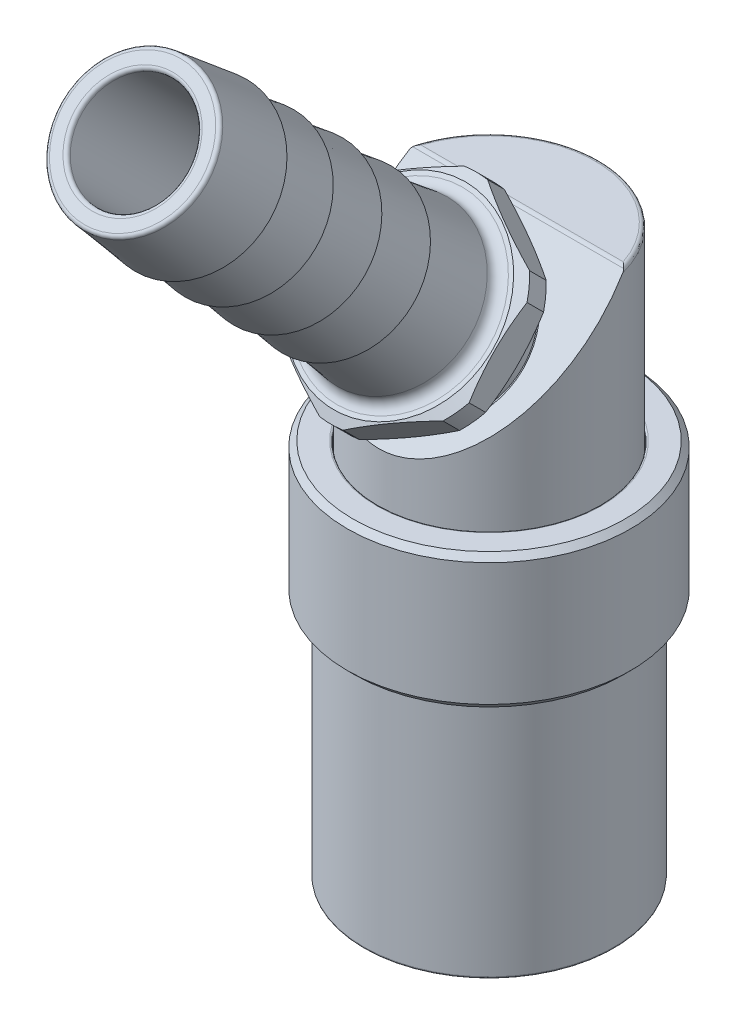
ISO-10303-21;
HEADER;
FILE_DESCRIPTION(('STEP AP214'),'2;1');
FILE_NAME('part.step','',(''),(''),'','','');
FILE_SCHEMA(('AUTOMOTIVE_DESIGN { 1 0 10303 214 1 1 1 1 }'));
ENDSEC;
DATA;
#1=APPLICATION_CONTEXT('core data for automotive mechanical design processes');
#2=APPLICATION_PROTOCOL_DEFINITION('international standard','automotive_design',2000,#1);
#3=PRODUCT_CONTEXT('',#1,'mechanical');
#4=PRODUCT('Part','Part','',(#3));
#5=PRODUCT_RELATED_PRODUCT_CATEGORY('part','',(#4));
#6=PRODUCT_DEFINITION_FORMATION('','',#4);
#7=PRODUCT_DEFINITION_CONTEXT('part definition',#1,'design');
#8=PRODUCT_DEFINITION('design','',#6,#7);
#9=PRODUCT_DEFINITION_SHAPE('','',#8);
#10=(LENGTH_UNIT() NAMED_UNIT(*) SI_UNIT(.MILLI.,.METRE.));
#11=(NAMED_UNIT(*) PLANE_ANGLE_UNIT() SI_UNIT($,.RADIAN.));
#12=(NAMED_UNIT(*) SI_UNIT($,.STERADIAN.) SOLID_ANGLE_UNIT());
#13=UNCERTAINTY_MEASURE_WITH_UNIT(LENGTH_MEASURE(1.E-05),#10,'distance_accuracy_value','');
#14=(GEOMETRIC_REPRESENTATION_CONTEXT(3) GLOBAL_UNCERTAINTY_ASSIGNED_CONTEXT((#13)) GLOBAL_UNIT_ASSIGNED_CONTEXT((#10,
#11,#12)) REPRESENTATION_CONTEXT('',''));
#15=CARTESIAN_POINT('',(0.,0.,0.));
#16=DIRECTION('',(0.,0.,1.));
#17=DIRECTION('',(1.,0.,0.));
#18=AXIS2_PLACEMENT_3D('',#15,#16,#17);
#19=CARTESIAN_POINT('',(0.,30.2808121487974,-0.544690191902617));
#20=DIRECTION('',(0.,-0.707106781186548,-0.707106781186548));
#21=DIRECTION('',(0.,0.707106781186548,-0.707106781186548));
#22=AXIS2_PLACEMENT_3D('',#19,#20,#21);
#23=TOROIDAL_SURFACE('',#22,3.8227,0.254);
#24=CARTESIAN_POINT('',(0.,30.2808121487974,-0.544690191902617));
#25=DIRECTION('',(0.,0.707106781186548,0.707106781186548));
#26=DIRECTION('',(0.,-0.707106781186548,0.707106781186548));
#27=AXIS2_PLACEMENT_3D('',#24,#25,#26);
#28=CIRCLE('',#27,3.5687);
#29=CARTESIAN_POINT('',(0.,32.8042641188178,-3.06814216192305));
#30=VERTEX_POINT('',#29);
#31=CARTESIAN_POINT('',(0.,27.7573601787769,1.97876177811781));
#32=VERTEX_POINT('',#31);
#33=EDGE_CURVE('P0_E11',#30,#32,#28,.T.);
#34=ORIENTED_EDGE('',*,*,#33,.T.);
#35=CARTESIAN_POINT('',(0.,27.5777550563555,2.1583669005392));
#36=DIRECTION('',(-1.,0.,0.));
#37=DIRECTION('',(0.,-0.707106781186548,0.707106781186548));
#38=AXIS2_PLACEMENT_3D('',#35,#36,#37);
#39=CIRCLE('',#38,0.254);
#40=CARTESIAN_POINT('',(0.,27.3981499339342,1.97876177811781));
#41=VERTEX_POINT('',#40);
#42=EDGE_CURVE('P0_E27',#32,#41,#39,.T.);
#43=ORIENTED_EDGE('',*,*,#42,.T.);
#44=CARTESIAN_POINT('',(0.,30.101207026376,-0.724295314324));
#45=DIRECTION('',(0.,-0.707106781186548,-0.707106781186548));
#46=DIRECTION('',(0.,-0.707106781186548,0.707106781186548));
#47=AXIS2_PLACEMENT_3D('',#44,#45,#46);
#48=CIRCLE('',#47,3.8227);
#49=CARTESIAN_POINT('',(0.,32.8042641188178,-3.42735240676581));
#50=VERTEX_POINT('',#49);
#51=EDGE_CURVE('P0_E423',#41,#50,#48,.T.);
#52=ORIENTED_EDGE('',*,*,#51,.T.);
#53=CARTESIAN_POINT('',(0.,30.101207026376,-0.724295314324));
#54=DIRECTION('',(0.,-0.707106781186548,-0.707106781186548));
#55=DIRECTION('',(0.,-0.707106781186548,0.707106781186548));
#56=AXIS2_PLACEMENT_3D('',#53,#54,#55);
#57=CIRCLE('',#56,3.8227);
#58=EDGE_CURVE('P0_E426',#50,#41,#57,.T.);
#59=ORIENTED_EDGE('',*,*,#58,.T.);
#60=ORIENTED_EDGE('',*,*,#42,.F.);
#61=CARTESIAN_POINT('',(0.,30.2808121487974,-0.544690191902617));
#62=DIRECTION('',(0.,0.707106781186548,0.707106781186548));
#63=DIRECTION('',(0.,-0.707106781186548,0.707106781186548));
#64=AXIS2_PLACEMENT_3D('',#61,#62,#63);
#65=CIRCLE('',#64,3.5687);
#66=EDGE_CURVE('P0_E41',#32,#30,#65,.T.);
#67=ORIENTED_EDGE('',*,*,#66,.T.);
#68=EDGE_LOOP('',(#34,#43,#52,#59,#60,#67));
#69=FACE_BOUND('',#68,.T.);
#70=ADVANCED_FACE('P0_F16',(#69),#23,.T.);
#71=CARTESIAN_POINT('',(0.,42.4490591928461,11.6235568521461));
#72=DIRECTION('',(0.,-0.707106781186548,-0.707106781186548));
#73=DIRECTION('',(0.,0.707106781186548,-0.707106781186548));
#74=AXIS2_PLACEMENT_3D('',#71,#72,#73);
#75=CYLINDRICAL_SURFACE('',#74,3.5687);
#76=ORIENTED_EDGE('',*,*,#33,.F.);
#77=ORIENTED_EDGE('',*,*,#66,.F.);
#78=DIRECTION('',(0.,0.707106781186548,0.707106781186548));
#79=VECTOR('',#78,1.);
#80=CARTESIAN_POINT('',(0.,39.9256072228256,14.1470088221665));
#81=LINE('',#80,#79);
#82=CARTESIAN_POINT('',(0.,52.0938542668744,26.3152558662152));
#83=VERTEX_POINT('',#82);
#84=EDGE_CURVE('P0_E508',#32,#83,#81,.T.);
#85=ORIENTED_EDGE('',*,*,#84,.T.);
#86=CARTESIAN_POINT('',(0.,54.6173062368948,23.7918038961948));
#87=DIRECTION('',(0.,-0.707106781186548,-0.707106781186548));
#88=DIRECTION('',(0.,-0.707106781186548,0.707106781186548));
#89=AXIS2_PLACEMENT_3D('',#86,#87,#88);
#90=CIRCLE('',#89,3.5687);
#91=CARTESIAN_POINT('',(0.,57.1407582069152,21.2683519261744));
#92=VERTEX_POINT('',#91);
#93=EDGE_CURVE('P0_E667',#92,#83,#90,.T.);
#94=ORIENTED_EDGE('',*,*,#93,.F.);
#95=CARTESIAN_POINT('',(0.,54.6173062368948,23.7918038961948));
#96=DIRECTION('',(0.,-0.707106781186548,-0.707106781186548));
#97=DIRECTION('',(0.,-0.707106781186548,0.707106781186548));
#98=AXIS2_PLACEMENT_3D('',#95,#96,#97);
#99=CIRCLE('',#98,3.5687);
#100=EDGE_CURVE('P0_E671',#83,#92,#99,.T.);
#101=ORIENTED_EDGE('',*,*,#100,.F.);
#102=ORIENTED_EDGE('',*,*,#84,.F.);
#103=EDGE_LOOP('',(#76,#77,#85,#94,#101,#102));
#104=FACE_BOUND('',#103,.T.);
#105=ADVANCED_FACE('P0_F779',(#104),#75,.F.);
#106=CARTESIAN_POINT('',(0.,32.6246589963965,-3.24774728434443));
#107=DIRECTION('',(0.,-0.707106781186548,-0.707106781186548));
#108=DIRECTION('',(0.,0.707106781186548,-0.707106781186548));
#109=AXIS2_PLACEMENT_3D('',#106,#107,#108);
#110=PLANE('',#109);
#111=CARTESIAN_POINT('',(0.,30.101207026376,-0.724295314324));
#112=DIRECTION('',(0.,0.707106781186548,0.707106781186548));
#113=DIRECTION('',(0.,-0.707106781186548,0.707106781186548));
#114=AXIS2_PLACEMENT_3D('',#111,#112,#113);
#115=CIRCLE('',#114,3.937);
#116=CARTESIAN_POINT('',(0.,32.8850864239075,-3.50817471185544));
#117=VERTEX_POINT('',#116);
#118=EDGE_CURVE('P0_E368',#117,#117,#115,.T.);
#119=ORIENTED_EDGE('',*,*,#118,.F.);
#120=EDGE_LOOP('',(#119));
#121=FACE_BOUND('',#120,.T.);
#122=ORIENTED_EDGE('',*,*,#58,.F.);
#123=ORIENTED_EDGE('',*,*,#51,.F.);
#124=EDGE_LOOP('',(#122,#123));
#125=FACE_BOUND('',#124,.T.);
#126=ADVANCED_FACE('P0_F785',(#121,#125),#110,.T.);
#127=CARTESIAN_POINT('',(0.,54.6173062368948,23.7918038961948));
#128=DIRECTION('',(0.,-0.707106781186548,-0.707106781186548));
#129=DIRECTION('',(0.,0.707106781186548,-0.707106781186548));
#130=AXIS2_PLACEMENT_3D('',#127,#128,#129);
#131=TOROIDAL_SURFACE('',#130,4.56600965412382,0.254);
#132=CARTESIAN_POINT('',(0.,54.6329598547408,23.8074575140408));
#133=DIRECTION('',(0.,0.707106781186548,0.707106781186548));
#134=DIRECTION('',(0.,-0.707106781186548,0.707106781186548));
#135=AXIS2_PLACEMENT_3D('',#132,#133,#134);
#136=CIRCLE('',#135,4.81904310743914);
#137=CARTESIAN_POINT('',(0.,58.0405379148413,20.3998794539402));
#138=VERTEX_POINT('',#137);
#139=CARTESIAN_POINT('',(0.,51.2253817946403,27.2150355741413));
#140=VERTEX_POINT('',#139);
#141=EDGE_CURVE('P0_E469',#138,#140,#136,.T.);
#142=ORIENTED_EDGE('',*,*,#141,.T.);
#143=CARTESIAN_POINT('',(0.,51.3886498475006,27.020460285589));
#144=DIRECTION('',(-1.,0.,0.));
#145=DIRECTION('',(0.,-0.707106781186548,0.707106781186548));
#146=AXIS2_PLACEMENT_3D('',#143,#144,#145);
#147=CIRCLE('',#146,0.254);
#148=CARTESIAN_POINT('',(0.,51.568254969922,27.2000654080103));
#149=VERTEX_POINT('',#148);
#150=EDGE_CURVE('P0_E361',#140,#149,#147,.T.);
#151=ORIENTED_EDGE('',*,*,#150,.T.);
#152=CARTESIAN_POINT('',(0.,54.7969113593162,23.9714090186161));
#153=DIRECTION('',(0.,-0.707106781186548,-0.707106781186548));
#154=DIRECTION('',(0.,-0.707106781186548,0.707106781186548));
#155=AXIS2_PLACEMENT_3D('',#152,#153,#154);
#156=CIRCLE('',#155,4.56600965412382);
#157=CARTESIAN_POINT('',(0.,58.0255677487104,20.7427526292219));
#158=VERTEX_POINT('',#157);
#159=EDGE_CURVE('P0_E358',#149,#158,#156,.T.);
#160=ORIENTED_EDGE('',*,*,#159,.T.);
#161=CARTESIAN_POINT('',(0.,54.7969113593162,23.9714090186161));
#162=DIRECTION('',(0.,-0.707106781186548,-0.707106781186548));
#163=DIRECTION('',(0.,-0.707106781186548,0.707106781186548));
#164=AXIS2_PLACEMENT_3D('',#161,#162,#163);
#165=CIRCLE('',#164,4.56600965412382);
#166=EDGE_CURVE('P0_E362',#158,#149,#165,.T.);
#167=ORIENTED_EDGE('',*,*,#166,.T.);
#168=ORIENTED_EDGE('',*,*,#150,.F.);
#169=CARTESIAN_POINT('',(0.,54.6329598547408,23.8074575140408));
#170=DIRECTION('',(0.,0.707106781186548,0.707106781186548));
#171=DIRECTION('',(0.,-0.707106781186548,0.707106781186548));
#172=AXIS2_PLACEMENT_3D('',#169,#170,#171);
#173=CIRCLE('',#172,4.81904310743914);
#174=EDGE_CURVE('P0_E406',#140,#138,#173,.T.);
#175=ORIENTED_EDGE('',*,*,#174,.T.);
#176=EDGE_LOOP('',(#142,#151,#160,#167,#168,#175));
#177=FACE_BOUND('',#176,.T.);
#178=ADVANCED_FACE('P0_F800',(#177),#131,.T.);
#179=CARTESIAN_POINT('',(0.,58.1901455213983,20.5781748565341));
#180=DIRECTION('',(0.,0.707106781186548,0.707106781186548));
#181=DIRECTION('',(1.,0.,0.));
#182=AXIS2_PLACEMENT_3D('',#179,#180,#181);
#183=PLANE('',#182);
#184=ORIENTED_EDGE('',*,*,#166,.F.);
#185=ORIENTED_EDGE('',*,*,#159,.F.);
#186=EDGE_LOOP('',(#184,#185));
#187=FACE_BOUND('',#186,.T.);
#188=CARTESIAN_POINT('',(0.,54.7969113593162,23.9714090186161));
#189=DIRECTION('',(0.,0.707106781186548,0.707106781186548));
#190=DIRECTION('',(0.,-0.707106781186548,0.707106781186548));
#191=AXIS2_PLACEMENT_3D('',#188,#189,#190);
#192=CIRCLE('',#191,3.8227);
#193=CARTESIAN_POINT('',(0.,57.499968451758,21.2683519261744));
#194=VERTEX_POINT('',#193);
#195=CARTESIAN_POINT('',(0.,52.0938542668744,26.674466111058));
#196=VERTEX_POINT('',#195);
#197=EDGE_CURVE('P0_E407',#194,#196,#192,.T.);
#198=ORIENTED_EDGE('',*,*,#197,.F.);
#199=CARTESIAN_POINT('',(0.,54.7969113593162,23.9714090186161));
#200=DIRECTION('',(0.,0.707106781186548,0.707106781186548));
#201=DIRECTION('',(0.,-0.707106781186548,0.707106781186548));
#202=AXIS2_PLACEMENT_3D('',#199,#200,#201);
#203=CIRCLE('',#202,3.8227);
#204=EDGE_CURVE('P0_E597',#196,#194,#203,.T.);
#205=ORIENTED_EDGE('',*,*,#204,.F.);
#206=EDGE_LOOP('',(#198,#205));
#207=FACE_BOUND('',#206,.T.);
#208=ADVANCED_FACE('P0_F747',(#187,#207),#183,.T.);
#209=CARTESIAN_POINT('',(0.,52.8392155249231,22.0137131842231));
#210=DIRECTION('',(0.,-0.707106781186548,-0.707106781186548));
#211=DIRECTION('',(0.,0.707106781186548,-0.707106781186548));
#212=AXIS2_PLACEMENT_3D('',#209,#210,#211);
#213=CONICAL_SURFACE('',#212,5.04097888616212,0.0872664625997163);
#214=CARTESIAN_POINT('',(0.,50.88151969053,20.05601734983));
#215=DIRECTION('',(0.,-0.707106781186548,-0.707106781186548));
#216=DIRECTION('',(1.,0.,0.));
#217=AXIS2_PLACEMENT_3D('',#214,#215,#216);
#218=CIRCLE('',#217,5.2832);
#219=CARTESIAN_POINT('',(0.,54.6173062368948,16.3202308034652));
#220=VERTEX_POINT('',#219);
#221=CARTESIAN_POINT('',(0.,47.1457331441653,23.7918038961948));
#222=VERTEX_POINT('',#221);
#223=EDGE_CURVE('P0_E332',#220,#222,#218,.T.);
#224=ORIENTED_EDGE('',*,*,#223,.F.);
#225=CARTESIAN_POINT('',(0.,50.88151969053,20.05601734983));
#226=DIRECTION('',(0.,-0.707106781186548,-0.707106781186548));
#227=DIRECTION('',(1.,0.,0.));
#228=AXIS2_PLACEMENT_3D('',#225,#226,#227);
#229=CIRCLE('',#228,5.2832);
#230=EDGE_CURVE('P0_E386',#222,#220,#229,.T.);
#231=ORIENTED_EDGE('',*,*,#230,.F.);
#232=DIRECTION('',(0.,0.766044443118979,0.64278760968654));
#233=VECTOR('',#232,1.);
#234=CARTESIAN_POINT('',(0.,49.2747051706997,25.5782235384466));
#235=LINE('',#234,#233);
#236=EDGE_CURVE('P0_E402',#222,#140,#235,.T.);
#237=ORIENTED_EDGE('',*,*,#236,.T.);
#238=ORIENTED_EDGE('',*,*,#141,.F.);
#239=ORIENTED_EDGE('',*,*,#174,.F.);
#240=ORIENTED_EDGE('',*,*,#236,.F.);
#241=EDGE_LOOP('',(#224,#231,#237,#238,#239,#240));
#242=FACE_BOUND('',#241,.T.);
#243=ADVANCED_FACE('P0_F790',(#242),#213,.T.);
#244=CARTESIAN_POINT('',(0.,54.6173062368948,23.7918038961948));
#245=DIRECTION('',(0.,-0.707106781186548,-0.707106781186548));
#246=DIRECTION('',(0.,0.707106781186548,-0.707106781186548));
#247=AXIS2_PLACEMENT_3D('',#244,#245,#246);
#248=TOROIDAL_SURFACE('',#247,3.8227,0.254);
#249=ORIENTED_EDGE('',*,*,#197,.T.);
#250=CARTESIAN_POINT('',(0.,51.914249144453,26.4948609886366));
#251=DIRECTION('',(-1.,0.,0.));
#252=DIRECTION('',(0.,-0.707106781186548,0.707106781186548));
#253=AXIS2_PLACEMENT_3D('',#250,#251,#252);
#254=CIRCLE('',#253,0.254);
#255=EDGE_CURVE('P0_E675',#196,#83,#254,.T.);
#256=ORIENTED_EDGE('',*,*,#255,.T.);
#257=ORIENTED_EDGE('',*,*,#100,.T.);
#258=ORIENTED_EDGE('',*,*,#93,.T.);
#259=ORIENTED_EDGE('',*,*,#255,.F.);
#260=ORIENTED_EDGE('',*,*,#204,.T.);
#261=EDGE_LOOP('',(#249,#256,#257,#258,#259,#260));
#262=FACE_BOUND('',#261,.T.);
#263=ADVANCED_FACE('P0_F750',(#262),#248,.T.);
#264=CARTESIAN_POINT('',(0.,37.375214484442,6.54971214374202));
#265=DIRECTION('',(0.,-0.707106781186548,-0.707106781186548));
#266=DIRECTION('',(0.,0.707106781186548,-0.707106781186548));
#267=AXIS2_PLACEMENT_3D('',#264,#265,#266);
#268=TOROIDAL_SURFACE('',#267,5.97248639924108,0.762);
#269=CARTESIAN_POINT('',(0.,37.3282536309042,6.50275129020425));
#270=DIRECTION('',(0.,-0.707106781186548,-0.707106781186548));
#271=DIRECTION('',(0.,-0.707106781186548,0.707106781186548));
#272=AXIS2_PLACEMENT_3D('',#269,#270,#271);
#273=CIRCLE('',#272,5.21338603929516);
#274=CARTESIAN_POINT('',(0.,41.0146742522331,2.81633066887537));
#275=VERTEX_POINT('',#274);
#276=CARTESIAN_POINT('',(0.,33.6418330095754,10.1891719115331));
#277=VERTEX_POINT('',#276);
#278=EDGE_CURVE('P0_E562',#275,#277,#273,.T.);
#279=ORIENTED_EDGE('',*,*,#278,.T.);
#280=CARTESIAN_POINT('',(0.,33.1520288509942,10.7728977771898));
#281=DIRECTION('',(-1.,0.,0.));
#282=DIRECTION('',(0.,-0.707106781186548,0.707106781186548));
#283=AXIS2_PLACEMENT_3D('',#280,#281,#282);
#284=CIRCLE('',#283,0.762);
#285=CARTESIAN_POINT('',(0.,32.61321348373,10.2340824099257));
#286=VERTEX_POINT('',#285);
#287=EDGE_CURVE('P0_E485',#277,#286,#284,.T.);
#288=ORIENTED_EDGE('',*,*,#287,.T.);
#289=CARTESIAN_POINT('',(0.,36.8363991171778,6.01089677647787));
#290=DIRECTION('',(0.,0.707106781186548,0.707106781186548));
#291=DIRECTION('',(0.,-0.707106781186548,0.707106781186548));
#292=AXIS2_PLACEMENT_3D('',#289,#290,#291);
#293=CIRCLE('',#292,5.97248639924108);
#294=CARTESIAN_POINT('',(0.,41.0595847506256,1.78771114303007));
#295=VERTEX_POINT('',#294);
#296=EDGE_CURVE('P0_E482',#286,#295,#293,.T.);
#297=ORIENTED_EDGE('',*,*,#296,.T.);
#298=CARTESIAN_POINT('',(0.,36.8363991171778,6.01089677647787));
#299=DIRECTION('',(0.,0.707106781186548,0.707106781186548));
#300=DIRECTION('',(0.,-0.707106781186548,0.707106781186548));
#301=AXIS2_PLACEMENT_3D('',#298,#299,#300);
#302=CIRCLE('',#301,5.97248639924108);
#303=EDGE_CURVE('P0_E325',#295,#286,#302,.T.);
#304=ORIENTED_EDGE('',*,*,#303,.T.);
#305=ORIENTED_EDGE('',*,*,#287,.F.);
#306=CARTESIAN_POINT('',(0.,37.3282536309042,6.50275129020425));
#307=DIRECTION('',(0.,-0.707106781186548,-0.707106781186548));
#308=DIRECTION('',(0.,-0.707106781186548,0.707106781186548));
#309=AXIS2_PLACEMENT_3D('',#306,#307,#308);
#310=CIRCLE('',#309,5.21338603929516);
#311=EDGE_CURVE('P0_E322',#277,#275,#310,.T.);
#312=ORIENTED_EDGE('',*,*,#311,.T.);
#313=EDGE_LOOP('',(#279,#288,#297,#304,#305,#312));
#314=FACE_BOUND('',#313,.T.);
#315=ADVANCED_FACE('P0_F852',(#314),#268,.F.);
#316=CARTESIAN_POINT('',(0.,41.7306387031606,1.11665719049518));
#317=DIRECTION('',(0.,0.707106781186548,0.707106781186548));
#318=DIRECTION('',(1.,0.,0.));
#319=AXIS2_PLACEMENT_3D('',#316,#317,#318);
#320=PLANE('',#319);
#321=CARTESIAN_POINT('',(0.,36.8363991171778,6.01089677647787));
#322=DIRECTION('',(0.,-0.707106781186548,-0.707106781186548));
#323=DIRECTION('',(0.,-0.707106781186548,0.707106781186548));
#324=AXIS2_PLACEMENT_3D('',#321,#322,#323);
#325=CIRCLE('',#324,6.26158864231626);
#326=CARTESIAN_POINT('',(0.,41.2640109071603,1.58328498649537));
#327=VERTEX_POINT('',#326);
#328=EDGE_CURVE('P0_E509',#327,#327,#325,.T.);
#329=ORIENTED_EDGE('',*,*,#328,.F.);
#330=EDGE_LOOP('',(#329));
#331=FACE_BOUND('',#330,.T.);
#332=ORIENTED_EDGE('',*,*,#303,.F.);
#333=ORIENTED_EDGE('',*,*,#296,.F.);
#334=EDGE_LOOP('',(#332,#333));
#335=FACE_BOUND('',#334,.T.);
#336=ADVANCED_FACE('P0_F860',(#331,#335),#320,.T.);
#337=CARTESIAN_POINT('',(0.,38.9557395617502,8.13023722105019));
#338=DIRECTION('',(0.,-0.707106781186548,-0.707106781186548));
#339=DIRECTION('',(0.,0.707106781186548,-0.707106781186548));
#340=AXIS2_PLACEMENT_3D('',#337,#338,#339);
#341=CONICAL_SURFACE('',#340,5.0120210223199,0.0872664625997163);
#342=ORIENTED_EDGE('',*,*,#278,.F.);
#343=ORIENTED_EDGE('',*,*,#311,.F.);
#344=DIRECTION('',(0.,0.766044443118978,0.64278760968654));
#345=VECTOR('',#344,1.);
#346=CARTESIAN_POINT('',(0.,35.4117055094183,11.6742712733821));
#347=LINE('',#346,#345);
#348=CARTESIAN_POINT('',(0.,37.7164642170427,13.6081934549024));
#349=VERTEX_POINT('',#348);
#350=EDGE_CURVE('P0_E326',#277,#349,#347,.T.);
#351=ORIENTED_EDGE('',*,*,#350,.T.);
#352=CARTESIAN_POINT('',(0.,41.0750800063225,10.2495776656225));
#353=DIRECTION('',(0.,-0.707106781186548,-0.707106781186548));
#354=DIRECTION('',(1.,0.,0.));
#355=AXIS2_PLACEMENT_3D('',#352,#353,#354);
#356=CIRCLE('',#355,4.7498);
#357=CARTESIAN_POINT('',(0.,44.4336957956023,6.89096187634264));
#358=VERTEX_POINT('',#357);
#359=EDGE_CURVE('P0_E594',#349,#358,#356,.T.);
#360=ORIENTED_EDGE('',*,*,#359,.T.);
#361=CARTESIAN_POINT('',(0.,41.0750800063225,10.2495776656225));
#362=DIRECTION('',(0.,-0.707106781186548,-0.707106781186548));
#363=DIRECTION('',(1.,0.,0.));
#364=AXIS2_PLACEMENT_3D('',#361,#362,#363);
#365=CIRCLE('',#364,4.7498);
#366=EDGE_CURVE('P0_E391',#358,#349,#365,.T.);
#367=ORIENTED_EDGE('',*,*,#366,.T.);
#368=ORIENTED_EDGE('',*,*,#350,.F.);
#369=EDGE_LOOP('',(#342,#343,#351,#360,#367,#368));
#370=FACE_BOUND('',#369,.T.);
#371=ADVANCED_FACE('P0_F761',(#370),#341,.T.);
#372=CARTESIAN_POINT('',(0.,34.5015325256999,3.67603018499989));
#373=DIRECTION('',(0.,-0.707106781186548,-0.707106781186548));
#374=DIRECTION('',(0.,0.707106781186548,-0.707106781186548));
#375=AXIS2_PLACEMENT_3D('',#372,#373,#374);
#376=TOROIDAL_SURFACE('',#375,5.46862,0.762);
#377=CARTESIAN_POINT('',(0.,35.0403478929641,4.21484555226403));
#378=DIRECTION('',(0.,-0.707106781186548,-0.707106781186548));
#379=DIRECTION('',(0.,0.707106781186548,-0.707106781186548));
#380=AXIS2_PLACEMENT_3D('',#377,#378,#379);
#381=CIRCLE('',#380,5.46862);
#382=CARTESIAN_POINT('',(0.,31.1734496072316,8.08174383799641));
#383=VERTEX_POINT('',#382);
#384=EDGE_CURVE('P0_E387',#383,#383,#381,.T.);
#385=ORIENTED_EDGE('',*,*,#384,.T.);
#386=CARTESIAN_POINT('',(0.,30.6346342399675,7.54292847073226));
#387=DIRECTION('',(-1.,0.,0.));
#388=DIRECTION('',(0.,-0.707106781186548,0.707106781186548));
#389=AXIS2_PLACEMENT_3D('',#386,#387,#388);
#390=CIRCLE('',#389,0.762);
#391=CARTESIAN_POINT('',(0.,31.1734496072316,7.00411310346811));
#392=VERTEX_POINT('',#391);
#393=EDGE_CURVE('P0_E392',#383,#392,#390,.T.);
#394=ORIENTED_EDGE('',*,*,#393,.T.);
#395=CARTESIAN_POINT('',(0.,34.5015325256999,3.67603018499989));
#396=DIRECTION('',(0.,0.707106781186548,0.707106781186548));
#397=DIRECTION('',(0.,0.707106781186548,-0.707106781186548));
#398=AXIS2_PLACEMENT_3D('',#395,#396,#397);
#399=CIRCLE('',#398,4.70662);
#400=EDGE_CURVE('P0_E437',#392,#392,#399,.T.);
#401=ORIENTED_EDGE('',*,*,#400,.T.);
#402=ORIENTED_EDGE('',*,*,#393,.F.);
#403=EDGE_LOOP('',(#385,#394,#401,#402));
#404=FACE_BOUND('',#403,.T.);
#405=ADVANCED_FACE('P0_F18',(#404),#376,.F.);
#406=CARTESIAN_POINT('',(0.,32.57077745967,1.74527511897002));
#407=DIRECTION('',(0.,-0.707106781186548,-0.707106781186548));
#408=DIRECTION('',(0.,0.707106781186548,-0.707106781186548));
#409=AXIS2_PLACEMENT_3D('',#406,#407,#408);
#410=CYLINDRICAL_SURFACE('',#409,4.70662);
#411=CARTESIAN_POINT('',(0.,30.6454105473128,-0.180091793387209));
#412=DIRECTION('',(0.,-0.707106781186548,-0.707106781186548));
#413=DIRECTION('',(0.,0.707106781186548,-0.707106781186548));
#414=AXIS2_PLACEMENT_3D('',#411,#412,#413);
#415=CIRCLE('',#414,4.70662);
#416=CARTESIAN_POINT('',(0.,27.3173276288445,3.14799112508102));
#417=VERTEX_POINT('',#416);
#418=CARTESIAN_POINT('',(0.,33.973493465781,-3.50817471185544));
#419=VERTEX_POINT('',#418);
#420=EDGE_CURVE('P0_E567',#417,#419,#415,.T.);
#421=ORIENTED_EDGE('',*,*,#420,.F.);
#422=DIRECTION('',(0.,0.707106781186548,0.707106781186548));
#423=VECTOR('',#422,1.);
#424=CARTESIAN_POINT('',(0.,29.2426945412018,5.07335803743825));
#425=LINE('',#424,#423);
#426=EDGE_CURVE('P0_E372',#417,#392,#425,.T.);
#427=ORIENTED_EDGE('',*,*,#426,.T.);
#428=ORIENTED_EDGE('',*,*,#400,.F.);
#429=ORIENTED_EDGE('',*,*,#426,.F.);
#430=CARTESIAN_POINT('',(0.,30.6454105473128,-0.180091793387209));
#431=DIRECTION('',(0.,-0.707106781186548,-0.707106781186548));
#432=DIRECTION('',(0.,0.707106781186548,-0.707106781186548));
#433=AXIS2_PLACEMENT_3D('',#430,#431,#432);
#434=CIRCLE('',#433,4.70662);
#435=EDGE_CURVE('P0_E563',#419,#417,#434,.T.);
#436=ORIENTED_EDGE('',*,*,#435,.F.);
#437=EDGE_LOOP('',(#421,#427,#428,#429,#436));
#438=FACE_BOUND('',#437,.T.);
#439=ADVANCED_FACE('P0_F690',(#438),#410,.T.);
#440=CARTESIAN_POINT('',(0.,38.3630426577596,0.892150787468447));
#441=DIRECTION('',(0.,-0.707106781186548,-0.707106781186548));
#442=DIRECTION('',(0.,0.707106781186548,-0.707106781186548));
#443=AXIS2_PLACEMENT_3D('',#440,#441,#442);
#444=PLANE('',#443);
#445=CARTESIAN_POINT('',(0.,35.0403478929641,4.21484555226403));
#446=DIRECTION('',(0.,0.707106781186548,0.707106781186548));
#447=DIRECTION('',(0.,-0.707106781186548,0.707106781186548));
#448=AXIS2_PLACEMENT_3D('',#445,#446,#447);
#449=CIRCLE('',#448,5.9055);
#450=CARTESIAN_POINT('',(0.,39.2161669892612,0.0390264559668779));
#451=VERTEX_POINT('',#450);
#452=EDGE_CURVE('P0_E356',#451,#451,#449,.T.);
#453=ORIENTED_EDGE('',*,*,#452,.F.);
#454=EDGE_LOOP('',(#453));
#455=FACE_BOUND('',#454,.T.);
#456=ORIENTED_EDGE('',*,*,#384,.F.);
#457=EDGE_LOOP('',(#456));
#458=FACE_BOUND('',#457,.T.);
#459=ADVANCED_FACE('P0_F798',(#455,#458),#444,.T.);
#460=CARTESIAN_POINT('',(0.,30.3706147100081,-0.454887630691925));
#461=DIRECTION('',(0.,0.707106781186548,0.707106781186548));
#462=DIRECTION('',(0.,-0.707106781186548,0.707106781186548));
#463=AXIS2_PLACEMENT_3D('',#460,#461,#462);
#464=CONICAL_SURFACE('',#463,4.318,0.785398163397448);
#465=ORIENTED_EDGE('',*,*,#118,.T.);
#466=DIRECTION('',(0.,1.,0.));
#467=VECTOR('',#466,1.);
#468=CARTESIAN_POINT('',(0.,33.4239017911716,-3.50817471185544));
#469=LINE('',#468,#467);
#470=EDGE_CURVE('P0_E373',#117,#419,#469,.T.);
#471=ORIENTED_EDGE('',*,*,#470,.T.);
#472=ORIENTED_EDGE('',*,*,#435,.T.);
#473=ORIENTED_EDGE('',*,*,#420,.T.);
#474=ORIENTED_EDGE('',*,*,#470,.F.);
#475=EDGE_LOOP('',(#465,#471,#472,#473,#474));
#476=FACE_BOUND('',#475,.T.);
#477=ADVANCED_FACE('P0_F694',(#476),#464,.T.);
#478=CARTESIAN_POINT('',(0.,35.2859603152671,-5.90904860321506));
#479=DIRECTION('',(-0.5,-0.612372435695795,0.612372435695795));
#480=DIRECTION('',(0.,0.707106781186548,0.707106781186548));
#481=AXIS2_PLACEMENT_3D('',#478,#479,#480);
#482=PLANE('',#481);
#483=CARTESIAN_POINT('',(5.56005695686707,39.4818609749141,2.82661955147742));
#484=CARTESIAN_POINT('',(3.175,40.9029197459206,2.30028747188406));
#485=CARTESIAN_POINT('',(0.789943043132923,41.429251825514,0.879228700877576));
#486=(BOUNDED_CURVE() B_SPLINE_CURVE(2,(#483,#484,#485),.UNSPECIFIED.,.F.,
.F.) B_SPLINE_CURVE_WITH_KNOTS((3,3),(0.,0.554744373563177),
.UNSPECIFIED.) CURVE() GEOMETRIC_REPRESENTATION_ITEM() RATIONAL_B_SPLINE_CURVE((1.,1.09,1.)) REPRESENTATION_ITEM(''));
#487=CARTESIAN_POINT('',(5.56005695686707,39.4818609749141,2.82661955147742));
#488=VERTEX_POINT('',#487);
#489=CARTESIAN_POINT('',(0.789943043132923,41.429251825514,0.879228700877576));
#490=VERTEX_POINT('',#489);
#491=EDGE_CURVE('P0_E302',#488,#490,#486,.T.);
#492=ORIENTED_EDGE('',*,*,#491,.F.);
#493=DIRECTION('',(0.,0.707106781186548,0.707106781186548));
#494=VECTOR('',#493,1.);
#495=CARTESIAN_POINT('',(5.56005695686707,38.8532430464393,2.19800162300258));
#496=LINE('',#495,#494);
#497=CARTESIAN_POINT('',(5.56005695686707,38.3699976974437,1.71475627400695));
#498=VERTEX_POINT('',#497);
#499=EDGE_CURVE('P0_E481',#498,#488,#496,.T.);
#500=ORIENTED_EDGE('',*,*,#499,.F.);
#501=CARTESIAN_POINT('',(0.789943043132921,40.3173885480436,-0.232634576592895));
#502=CARTESIAN_POINT('',(3.175,38.896329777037,0.293697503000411));
#503=CARTESIAN_POINT('',(5.56005695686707,38.3699976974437,1.71475627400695));
#504=(BOUNDED_CURVE() B_SPLINE_CURVE(2,(#501,#502,#503),.UNSPECIFIED.,.F.,
.F.) B_SPLINE_CURVE_WITH_KNOTS((3,3),(0.,0.554744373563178),
.UNSPECIFIED.) CURVE() GEOMETRIC_REPRESENTATION_ITEM() RATIONAL_B_SPLINE_CURVE((1.,1.09,1.)) REPRESENTATION_ITEM(''));
#505=CARTESIAN_POINT('',(0.789943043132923,40.3173885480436,-0.232634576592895));
#506=VERTEX_POINT('',#505);
#507=EDGE_CURVE('P0_E396',#506,#498,#504,.T.);
#508=ORIENTED_EDGE('',*,*,#507,.F.);
#509=DIRECTION('',(0.,-0.707106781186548,-0.707106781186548));
#510=VECTOR('',#509,1.);
#511=CARTESIAN_POINT('',(0.789943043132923,40.8006338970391,0.250610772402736));
#512=LINE('',#511,#510);
#513=EDGE_CURVE('P0_E331',#490,#506,#512,.T.);
#514=ORIENTED_EDGE('',*,*,#513,.F.);
#515=EDGE_LOOP('',(#492,#500,#508,#514));
#516=FACE_BOUND('',#515,.T.);
#517=ADVANCED_FACE('P0_F731',(#516),#482,.F.);
#518=CARTESIAN_POINT('',(-6.35,32.6935836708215,-3.31667195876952));
#519=DIRECTION('',(0.5,-0.612372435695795,0.612372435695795));
#520=DIRECTION('',(0.,-0.707106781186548,-0.707106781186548));
#521=AXIS2_PLACEMENT_3D('',#518,#519,#520);
#522=PLANE('',#521);
#523=CARTESIAN_POINT('',(-0.789943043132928,41.429251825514,0.879228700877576));
#524=CARTESIAN_POINT('',(-3.175,40.9029197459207,2.30028747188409));
#525=CARTESIAN_POINT('',(-5.56005695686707,39.4818609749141,2.82661955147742));
#526=(BOUNDED_CURVE() B_SPLINE_CURVE(2,(#523,#524,#525),.UNSPECIFIED.,.F.,
.F.) B_SPLINE_CURVE_WITH_KNOTS((3,3),(0.,0.554744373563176),
.UNSPECIFIED.) CURVE() GEOMETRIC_REPRESENTATION_ITEM() RATIONAL_B_SPLINE_CURVE((1.,1.09,1.)) REPRESENTATION_ITEM(''));
#527=CARTESIAN_POINT('',(-0.789943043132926,41.429251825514,0.879228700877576));
#528=VERTEX_POINT('',#527);
#529=CARTESIAN_POINT('',(-5.56005695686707,39.4818609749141,2.82661955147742));
#530=VERTEX_POINT('',#529);
#531=EDGE_CURVE('P0_E308',#528,#530,#526,.T.);
#532=ORIENTED_EDGE('',*,*,#531,.F.);
#533=DIRECTION('',(0.,0.707106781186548,0.707106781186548));
#534=VECTOR('',#533,1.);
#535=CARTESIAN_POINT('',(-0.789943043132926,40.8006338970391,0.250610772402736));
#536=LINE('',#535,#534);
#537=CARTESIAN_POINT('',(-0.789943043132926,40.3173885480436,-0.232634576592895));
#538=VERTEX_POINT('',#537);
#539=EDGE_CURVE('P0_E327',#538,#528,#536,.T.);
#540=ORIENTED_EDGE('',*,*,#539,.F.);
#541=CARTESIAN_POINT('',(-5.56005695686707,38.3699976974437,1.71475627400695));
#542=CARTESIAN_POINT('',(-3.175,38.896329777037,0.293697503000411));
#543=CARTESIAN_POINT('',(-0.789943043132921,40.3173885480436,-0.232634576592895));
#544=(BOUNDED_CURVE() B_SPLINE_CURVE(2,(#541,#542,#543),.UNSPECIFIED.,.F.,
.F.) B_SPLINE_CURVE_WITH_KNOTS((3,3),(0.,0.554744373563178),
.UNSPECIFIED.) CURVE() GEOMETRIC_REPRESENTATION_ITEM() RATIONAL_B_SPLINE_CURVE((1.,1.09,1.)) REPRESENTATION_ITEM(''));
#545=CARTESIAN_POINT('',(-5.56005695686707,38.3699976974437,1.71475627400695));
#546=VERTEX_POINT('',#545);
#547=EDGE_CURVE('P0_E342',#546,#538,#544,.T.);
#548=ORIENTED_EDGE('',*,*,#547,.F.);
#549=DIRECTION('',(0.,-0.707106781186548,-0.707106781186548));
#550=VECTOR('',#549,1.);
#551=CARTESIAN_POINT('',(-5.56005695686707,38.8532430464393,2.19800162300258));
#552=LINE('',#551,#550);
#553=EDGE_CURVE('P0_E301',#530,#546,#552,.T.);
#554=ORIENTED_EDGE('',*,*,#553,.F.);
#555=EDGE_LOOP('',(#532,#540,#548,#554));
#556=FACE_BOUND('',#555,.T.);
#557=ADVANCED_FACE('P0_F808',(#556),#522,.F.);
#558=CARTESIAN_POINT('',(-6.35,27.5088303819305,1.86808133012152));
#559=DIRECTION('',(1.,0.,0.));
#560=DIRECTION('',(0.,0.707106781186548,0.707106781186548));
#561=AXIS2_PLACEMENT_3D('',#558,#559,#560);
#562=PLANE('',#561);
#563=CARTESIAN_POINT('',(-6.35,38.5143822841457,3.79409824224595));
#564=CARTESIAN_POINT('',(-6.35,37.0143547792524,6.18885243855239));
#565=CARTESIAN_POINT('',(-6.35,34.6196005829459,7.68887994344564));
#566=(BOUNDED_CURVE() B_SPLINE_CURVE(2,(#563,#564,#565),.UNSPECIFIED.,.F.,
.F.) B_SPLINE_CURVE_WITH_KNOTS((3,3),(0.,0.554744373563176),
.UNSPECIFIED.) CURVE() GEOMETRIC_REPRESENTATION_ITEM() RATIONAL_B_SPLINE_CURVE((1.,1.09,1.)) REPRESENTATION_ITEM(''));
#567=CARTESIAN_POINT('',(-6.35,38.5143822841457,3.79409824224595));
#568=VERTEX_POINT('',#567);
#569=CARTESIAN_POINT('',(-6.35,34.6196005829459,7.68887994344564));
#570=VERTEX_POINT('',#569);
#571=EDGE_CURVE('P0_E279',#568,#570,#566,.T.);
#572=ORIENTED_EDGE('',*,*,#571,.F.);
#573=DIRECTION('',(0.,0.707106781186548,0.707106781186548));
#574=VECTOR('',#573,1.);
#575=CARTESIAN_POINT('',(-6.35,37.8857643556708,3.16548031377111));
#576=LINE('',#575,#574);
#577=CARTESIAN_POINT('',(-6.35,37.4025190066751,2.68223496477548));
#578=VERTEX_POINT('',#577);
#579=EDGE_CURVE('P0_E283',#578,#568,#576,.T.);
#580=ORIENTED_EDGE('',*,*,#579,.F.);
#581=CARTESIAN_POINT('',(-6.35,33.5077373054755,6.57701666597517));
#582=CARTESIAN_POINT('',(-6.35,35.0077648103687,4.18226246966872));
#583=CARTESIAN_POINT('',(-6.35,37.4025190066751,2.68223496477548));
#584=(BOUNDED_CURVE() B_SPLINE_CURVE(2,(#581,#582,#583),.UNSPECIFIED.,.F.,
.F.) B_SPLINE_CURVE_WITH_KNOTS((3,3),(0.,0.554744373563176),
.UNSPECIFIED.) CURVE() GEOMETRIC_REPRESENTATION_ITEM() RATIONAL_B_SPLINE_CURVE((1.,1.09,1.)) REPRESENTATION_ITEM(''));
#585=CARTESIAN_POINT('',(-6.35,33.5077373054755,6.57701666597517));
#586=VERTEX_POINT('',#585);
#587=EDGE_CURVE('P0_E374',#586,#578,#584,.T.);
#588=ORIENTED_EDGE('',*,*,#587,.F.);
#589=DIRECTION('',(0.,-0.707106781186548,-0.707106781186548));
#590=VECTOR('',#589,1.);
#591=CARTESIAN_POINT('',(-6.35,33.9909826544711,7.0602620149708));
#592=LINE('',#591,#590);
#593=EDGE_CURVE('P0_E285',#570,#586,#592,.T.);
#594=ORIENTED_EDGE('',*,*,#593,.F.);
#595=EDGE_LOOP('',(#572,#580,#588,#594));
#596=FACE_BOUND('',#595,.T.);
#597=ADVANCED_FACE('P0_F281',(#596),#562,.F.);
#598=CARTESIAN_POINT('',(0.,24.916453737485,4.46045797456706));
#599=DIRECTION('',(0.5,0.612372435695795,-0.612372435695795));
#600=DIRECTION('',(0.,-0.707106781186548,-0.707106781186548));
#601=AXIS2_PLACEMENT_3D('',#598,#599,#600);
#602=PLANE('',#601);
#603=CARTESIAN_POINT('',(-5.56005695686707,33.6521218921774,8.65635863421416));
#604=CARTESIAN_POINT('',(-3.175,33.1257898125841,10.0774174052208));
#605=CARTESIAN_POINT('',(-0.789943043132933,31.7047310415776,10.603749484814));
#606=(BOUNDED_CURVE() B_SPLINE_CURVE(2,(#603,#604,#605),.UNSPECIFIED.,.F.,
.F.) B_SPLINE_CURVE_WITH_KNOTS((3,3),(0.,0.554744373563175),
.UNSPECIFIED.) CURVE() GEOMETRIC_REPRESENTATION_ITEM() RATIONAL_B_SPLINE_CURVE((1.,1.09,1.)) REPRESENTATION_ITEM(''));
#607=CARTESIAN_POINT('',(-5.56005695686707,33.6521218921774,8.65635863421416));
#608=VERTEX_POINT('',#607);
#609=CARTESIAN_POINT('',(-0.789943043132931,31.7047310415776,10.603749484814));
#610=VERTEX_POINT('',#609);
#611=EDGE_CURVE('P0_E416',#608,#610,#606,.T.);
#612=ORIENTED_EDGE('',*,*,#611,.F.);
#613=DIRECTION('',(0.,0.707106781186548,0.707106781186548));
#614=VECTOR('',#613,1.);
#615=CARTESIAN_POINT('',(-5.56005695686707,33.0235039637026,8.02774070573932));
#616=LINE('',#615,#614);
#617=CARTESIAN_POINT('',(-5.56005695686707,32.5402586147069,7.54449535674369));
#618=VERTEX_POINT('',#617);
#619=EDGE_CURVE('P0_E333',#618,#608,#616,.T.);
#620=ORIENTED_EDGE('',*,*,#619,.F.);
#621=CARTESIAN_POINT('',(-0.789943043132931,30.5928677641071,9.49188620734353));
#622=CARTESIAN_POINT('',(-3.175,31.1191998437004,8.07082743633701));
#623=CARTESIAN_POINT('',(-5.56005695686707,32.5402586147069,7.54449535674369));
#624=(BOUNDED_CURVE() B_SPLINE_CURVE(2,(#621,#622,#623),.UNSPECIFIED.,.F.,
.F.) B_SPLINE_CURVE_WITH_KNOTS((3,3),(0.,0.554744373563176),
.UNSPECIFIED.) CURVE() GEOMETRIC_REPRESENTATION_ITEM() RATIONAL_B_SPLINE_CURVE((1.,1.09,1.)) REPRESENTATION_ITEM(''));
#625=CARTESIAN_POINT('',(-0.789943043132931,30.5928677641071,9.49188620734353));
#626=VERTEX_POINT('',#625);
#627=EDGE_CURVE('P0_E411',#626,#618,#624,.T.);
#628=ORIENTED_EDGE('',*,*,#627,.F.);
#629=DIRECTION('',(0.,-0.707106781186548,-0.707106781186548));
#630=VECTOR('',#629,1.);
#631=CARTESIAN_POINT('',(-0.789943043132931,31.0761131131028,9.97513155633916));
#632=LINE('',#631,#630);
#633=EDGE_CURVE('P0_E367',#610,#626,#632,.T.);
#634=ORIENTED_EDGE('',*,*,#633,.F.);
#635=EDGE_LOOP('',(#612,#620,#628,#634));
#636=FACE_BOUND('',#635,.T.);
#637=ADVANCED_FACE('P0_F633',(#636),#602,.F.);
#638=CARTESIAN_POINT('',(6.35,27.5088303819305,1.86808133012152));
#639=DIRECTION('',(-0.5,0.612372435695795,-0.612372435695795));
#640=DIRECTION('',(-0.866025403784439,-0.353553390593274,0.353553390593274));
#641=AXIS2_PLACEMENT_3D('',#638,#639,#640);
#642=PLANE('',#641);
#643=CARTESIAN_POINT('',(0.789943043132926,31.7047310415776,10.603749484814));
#644=CARTESIAN_POINT('',(3.175,33.1257898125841,10.0774174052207));
#645=CARTESIAN_POINT('',(5.56005695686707,33.6521218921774,8.65635863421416));
#646=(BOUNDED_CURVE() B_SPLINE_CURVE(2,(#643,#644,#645),.UNSPECIFIED.,.F.,
.F.) B_SPLINE_CURVE_WITH_KNOTS((3,3),(0.,0.554744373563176),
.UNSPECIFIED.) CURVE() GEOMETRIC_REPRESENTATION_ITEM() RATIONAL_B_SPLINE_CURVE((1.,1.09,1.)) REPRESENTATION_ITEM(''));
#647=CARTESIAN_POINT('',(0.789943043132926,31.7047310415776,10.603749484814));
#648=VERTEX_POINT('',#647);
#649=CARTESIAN_POINT('',(5.56005695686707,33.6521218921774,8.65635863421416));
#650=VERTEX_POINT('',#649);
#651=EDGE_CURVE('P0_E417',#648,#650,#646,.T.);
#652=ORIENTED_EDGE('',*,*,#651,.F.);
#653=DIRECTION('',(0.,0.707106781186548,0.707106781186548));
#654=VECTOR('',#653,1.);
#655=CARTESIAN_POINT('',(0.789943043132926,31.0761131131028,9.97513155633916));
#656=LINE('',#655,#654);
#657=CARTESIAN_POINT('',(0.789943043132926,30.5928677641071,9.49188620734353));
#658=VERTEX_POINT('',#657);
#659=EDGE_CURVE('P0_E363',#658,#648,#656,.T.);
#660=ORIENTED_EDGE('',*,*,#659,.F.);
#661=CARTESIAN_POINT('',(5.56005695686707,32.5402586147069,7.54449535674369));
#662=CARTESIAN_POINT('',(3.175,31.1191998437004,8.07082743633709));
#663=CARTESIAN_POINT('',(0.789943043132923,30.5928677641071,9.49188620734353));
#664=(BOUNDED_CURVE() B_SPLINE_CURVE(2,(#661,#662,#663),.UNSPECIFIED.,.F.,
.F.) B_SPLINE_CURVE_WITH_KNOTS((3,3),(0.,0.554744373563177),
.UNSPECIFIED.) CURVE() GEOMETRIC_REPRESENTATION_ITEM() RATIONAL_B_SPLINE_CURVE((1.,1.09,1.)) REPRESENTATION_ITEM(''));
#665=CARTESIAN_POINT('',(5.56005695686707,32.5402586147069,7.54449535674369));
#666=VERTEX_POINT('',#665);
#667=EDGE_CURVE('P0_E474',#666,#658,#664,.T.);
#668=ORIENTED_EDGE('',*,*,#667,.F.);
#669=DIRECTION('',(0.,-0.707106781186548,-0.707106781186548));
#670=VECTOR('',#669,1.);
#671=CARTESIAN_POINT('',(5.56005695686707,33.0235039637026,8.02774070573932));
#672=LINE('',#671,#670);
#673=EDGE_CURVE('P0_E460',#650,#666,#672,.T.);
#674=ORIENTED_EDGE('',*,*,#673,.F.);
#675=EDGE_LOOP('',(#652,#660,#668,#674));
#676=FACE_BOUND('',#675,.T.);
#677=ADVANCED_FACE('P0_F622',(#676),#642,.F.);
#678=CARTESIAN_POINT('',(6.35,32.6935836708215,-3.31667195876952));
#679=DIRECTION('',(-1.,0.,0.));
#680=DIRECTION('',(0.,-0.707106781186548,0.707106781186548));
#681=AXIS2_PLACEMENT_3D('',#678,#679,#680);
#682=PLANE('',#681);
#683=CARTESIAN_POINT('',(6.35,34.6196005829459,7.68887994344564));
#684=CARTESIAN_POINT('',(6.35,37.0143547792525,6.18885243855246));
#685=CARTESIAN_POINT('',(6.35,38.5143822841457,3.79409824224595));
#686=(BOUNDED_CURVE() B_SPLINE_CURVE(2,(#683,#684,#685),.UNSPECIFIED.,.F.,
.F.) B_SPLINE_CURVE_WITH_KNOTS((3,3),(0.,0.554744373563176),
.UNSPECIFIED.) CURVE() GEOMETRIC_REPRESENTATION_ITEM() RATIONAL_B_SPLINE_CURVE((1.,1.09,1.)) REPRESENTATION_ITEM(''));
#687=CARTESIAN_POINT('',(6.35,34.6196005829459,7.68887994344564));
#688=VERTEX_POINT('',#687);
#689=CARTESIAN_POINT('',(6.35,38.5143822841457,3.79409824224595));
#690=VERTEX_POINT('',#689);
#691=EDGE_CURVE('P0_E401',#688,#690,#686,.T.);
#692=ORIENTED_EDGE('',*,*,#691,.F.);
#693=DIRECTION('',(0.,0.707106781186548,0.707106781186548));
#694=VECTOR('',#693,1.);
#695=CARTESIAN_POINT('',(6.35,33.9909826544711,7.0602620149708));
#696=LINE('',#695,#694);
#697=CARTESIAN_POINT('',(6.35,33.5077373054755,6.57701666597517));
#698=VERTEX_POINT('',#697);
#699=EDGE_CURVE('P0_E465',#698,#688,#696,.T.);
#700=ORIENTED_EDGE('',*,*,#699,.F.);
#701=CARTESIAN_POINT('',(6.35,37.4025190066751,2.68223496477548));
#702=CARTESIAN_POINT('',(6.35,35.0077648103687,4.18226246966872));
#703=CARTESIAN_POINT('',(6.35,33.5077373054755,6.57701666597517));
#704=(BOUNDED_CURVE() B_SPLINE_CURVE(2,(#701,#702,#703),.UNSPECIFIED.,.F.,
.F.) B_SPLINE_CURVE_WITH_KNOTS((3,3),(0.,0.554744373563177),
.UNSPECIFIED.) CURVE() GEOMETRIC_REPRESENTATION_ITEM() RATIONAL_B_SPLINE_CURVE((1.,1.09,1.)) REPRESENTATION_ITEM(''));
#705=CARTESIAN_POINT('',(6.35,37.4025190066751,2.68223496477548));
#706=VERTEX_POINT('',#705);
#707=EDGE_CURVE('P0_E519',#706,#698,#704,.T.);
#708=ORIENTED_EDGE('',*,*,#707,.F.);
#709=DIRECTION('',(0.,-0.707106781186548,-0.707106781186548));
#710=VECTOR('',#709,1.);
#711=CARTESIAN_POINT('',(6.35,37.8857643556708,3.16548031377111));
#712=LINE('',#711,#710);
#713=EDGE_CURVE('P0_E464',#690,#706,#712,.T.);
#714=ORIENTED_EDGE('',*,*,#713,.F.);
#715=EDGE_LOOP('',(#692,#700,#708,#714));
#716=FACE_BOUND('',#715,.T.);
#717=ADVANCED_FACE('P0_F730',(#716),#682,.F.);
#718=CARTESIAN_POINT('',(0.,35.2477380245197,4.42223568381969));
#719=DIRECTION('',(0.,0.707106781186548,0.707106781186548));
#720=DIRECTION('',(0.,-0.707106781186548,0.707106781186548));
#721=AXIS2_PLACEMENT_3D('',#718,#719,#720);
#722=CONICAL_SURFACE('',#721,6.4135,1.0471975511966);
#723=ORIENTED_EDGE('',*,*,#452,.T.);
#724=DIRECTION('',(0.,0.965925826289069,-0.258819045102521));
#725=VECTOR('',#724,1.);
#726=CARTESIAN_POINT('',(0.,39.7827673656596,-0.112793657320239));
#727=LINE('',#726,#725);
#728=CARTESIAN_POINT('',(0.,40.349367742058,-0.264613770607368));
#729=VERTEX_POINT('',#728);
#730=EDGE_CURVE('P0_E349',#451,#729,#727,.T.);
#731=ORIENTED_EDGE('',*,*,#730,.T.);
#732=CARTESIAN_POINT('',(0.,35.4551281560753,4.62962581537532));
#733=DIRECTION('',(0.,-0.707106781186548,-0.707106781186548));
#734=DIRECTION('',(0.,-0.707106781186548,0.707106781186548));
#735=AXIS2_PLACEMENT_3D('',#732,#733,#734);
#736=CIRCLE('',#735,6.9215);
#737=EDGE_CURVE('P0_E357',#729,#506,#736,.T.);
#738=ORIENTED_EDGE('',*,*,#737,.T.);
#739=ORIENTED_EDGE('',*,*,#507,.T.);
#740=CARTESIAN_POINT('',(0.,35.4551281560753,4.62962581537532));
#741=DIRECTION('',(0.,-0.707106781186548,-0.707106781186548));
#742=DIRECTION('',(0.,-0.707106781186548,0.707106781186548));
#743=AXIS2_PLACEMENT_3D('',#740,#741,#742);
#744=CIRCLE('',#743,6.9215);
#745=EDGE_CURVE('P0_E528',#498,#706,#744,.T.);
#746=ORIENTED_EDGE('',*,*,#745,.T.);
#747=ORIENTED_EDGE('',*,*,#707,.T.);
#748=CARTESIAN_POINT('',(0.,35.4551281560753,4.62962581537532));
#749=DIRECTION('',(0.,-0.707106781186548,-0.707106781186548));
#750=DIRECTION('',(0.,-0.707106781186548,0.707106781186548));
#751=AXIS2_PLACEMENT_3D('',#748,#749,#750);
#752=CIRCLE('',#751,6.9215);
#753=EDGE_CURVE('P0_E320',#698,#666,#752,.T.);
#754=ORIENTED_EDGE('',*,*,#753,.T.);
#755=ORIENTED_EDGE('',*,*,#667,.T.);
#756=CARTESIAN_POINT('',(0.,35.4551281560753,4.62962581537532));
#757=DIRECTION('',(0.,-0.707106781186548,-0.707106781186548));
#758=DIRECTION('',(0.,-0.707106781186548,0.707106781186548));
#759=AXIS2_PLACEMENT_3D('',#756,#757,#758);
#760=CIRCLE('',#759,6.9215);
#761=EDGE_CURVE('P0_E470',#658,#626,#760,.T.);
#762=ORIENTED_EDGE('',*,*,#761,.T.);
#763=ORIENTED_EDGE('',*,*,#627,.T.);
#764=CARTESIAN_POINT('',(0.,35.4551281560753,4.62962581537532));
#765=DIRECTION('',(0.,-0.707106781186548,-0.707106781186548));
#766=DIRECTION('',(0.,-0.707106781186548,0.707106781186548));
#767=AXIS2_PLACEMENT_3D('',#764,#765,#766);
#768=CIRCLE('',#767,6.9215);
#769=EDGE_CURVE('P0_E379',#618,#586,#768,.T.);
#770=ORIENTED_EDGE('',*,*,#769,.T.);
#771=ORIENTED_EDGE('',*,*,#587,.T.);
#772=CARTESIAN_POINT('',(0.,35.4551281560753,4.62962581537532));
#773=DIRECTION('',(0.,-0.707106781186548,-0.707106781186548));
#774=DIRECTION('',(0.,-0.707106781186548,0.707106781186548));
#775=AXIS2_PLACEMENT_3D('',#772,#773,#774);
#776=CIRCLE('',#775,6.9215);
#777=EDGE_CURVE('P0_E299',#578,#546,#776,.T.);
#778=ORIENTED_EDGE('',*,*,#777,.T.);
#779=ORIENTED_EDGE('',*,*,#547,.T.);
#780=CARTESIAN_POINT('',(0.,35.4551281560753,4.62962581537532));
#781=DIRECTION('',(0.,-0.707106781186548,-0.707106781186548));
#782=DIRECTION('',(0.,-0.707106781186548,0.707106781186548));
#783=AXIS2_PLACEMENT_3D('',#780,#781,#782);
#784=CIRCLE('',#783,6.9215);
#785=EDGE_CURVE('P0_E348',#538,#729,#784,.T.);
#786=ORIENTED_EDGE('',*,*,#785,.T.);
#787=ORIENTED_EDGE('',*,*,#730,.F.);
#788=EDGE_LOOP('',(#723,#731,#738,#739,#746,#747,#754,#755,#762,#763,#770,#771,#778,#779,#786,#787));
#789=FACE_BOUND('',#788,.T.);
#790=ADVANCED_FACE('P0_F612',(#789),#722,.T.);
#791=CARTESIAN_POINT('',(0.,35.938373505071,5.11287116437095));
#792=DIRECTION('',(0.,-0.707106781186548,-0.707106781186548));
#793=DIRECTION('',(0.,0.707106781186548,-0.707106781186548));
#794=AXIS2_PLACEMENT_3D('',#791,#792,#793);
#795=CYLINDRICAL_SURFACE('',#794,6.9215);
#796=ORIENTED_EDGE('',*,*,#499,.T.);
#797=CARTESIAN_POINT('',(0.,36.5669914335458,5.74148909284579));
#798=DIRECTION('',(0.,0.707106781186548,0.707106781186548));
#799=DIRECTION('',(0.,-0.707106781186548,0.707106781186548));
#800=AXIS2_PLACEMENT_3D('',#797,#798,#799);
#801=CIRCLE('',#800,6.9215);
#802=EDGE_CURVE('P0_E397',#690,#488,#801,.T.);
#803=ORIENTED_EDGE('',*,*,#802,.F.);
#804=ORIENTED_EDGE('',*,*,#713,.T.);
#805=ORIENTED_EDGE('',*,*,#745,.F.);
#806=EDGE_LOOP('',(#796,#803,#804,#805));
#807=FACE_BOUND('',#806,.T.);
#808=ADVANCED_FACE('P0_F721',(#807),#795,.T.);
#809=CARTESIAN_POINT('',(0.,35.938373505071,5.11287116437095));
#810=DIRECTION('',(0.,-0.707106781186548,-0.707106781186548));
#811=DIRECTION('',(0.,0.707106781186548,-0.707106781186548));
#812=AXIS2_PLACEMENT_3D('',#809,#810,#811);
#813=CYLINDRICAL_SURFACE('',#812,6.9215);
#814=ORIENTED_EDGE('',*,*,#673,.T.);
#815=ORIENTED_EDGE('',*,*,#753,.F.);
#816=ORIENTED_EDGE('',*,*,#699,.T.);
#817=CARTESIAN_POINT('',(0.,36.5669914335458,5.74148909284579));
#818=DIRECTION('',(0.,0.707106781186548,0.707106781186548));
#819=DIRECTION('',(0.,-0.707106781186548,0.707106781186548));
#820=AXIS2_PLACEMENT_3D('',#817,#818,#819);
#821=CIRCLE('',#820,6.9215);
#822=EDGE_CURVE('P0_E490',#650,#688,#821,.T.);
#823=ORIENTED_EDGE('',*,*,#822,.F.);
#824=EDGE_LOOP('',(#814,#815,#816,#823));
#825=FACE_BOUND('',#824,.T.);
#826=ADVANCED_FACE('P0_F616',(#825),#813,.T.);
#827=CARTESIAN_POINT('',(0.,35.938373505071,5.11287116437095));
#828=DIRECTION('',(0.,-0.707106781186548,-0.707106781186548));
#829=DIRECTION('',(0.,-0.707106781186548,0.707106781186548));
#830=AXIS2_PLACEMENT_3D('',#827,#828,#829);
#831=CYLINDRICAL_SURFACE('',#830,6.9215);
#832=ORIENTED_EDGE('',*,*,#633,.T.);
#833=ORIENTED_EDGE('',*,*,#761,.F.);
#834=ORIENTED_EDGE('',*,*,#659,.T.);
#835=CARTESIAN_POINT('',(0.,36.5669914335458,5.74148909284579));
#836=DIRECTION('',(0.,0.707106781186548,0.707106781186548));
#837=DIRECTION('',(0.,-0.707106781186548,0.707106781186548));
#838=AXIS2_PLACEMENT_3D('',#835,#836,#837);
#839=CIRCLE('',#838,6.9215);
#840=EDGE_CURVE('P0_E412',#610,#648,#839,.T.);
#841=ORIENTED_EDGE('',*,*,#840,.F.);
#842=EDGE_LOOP('',(#832,#833,#834,#841));
#843=FACE_BOUND('',#842,.T.);
#844=ADVANCED_FACE('P0_F627',(#843),#831,.T.);
#845=CARTESIAN_POINT('',(0.,35.938373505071,5.11287116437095));
#846=DIRECTION('',(0.,-0.707106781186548,-0.707106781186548));
#847=DIRECTION('',(0.,0.707106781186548,-0.707106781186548));
#848=AXIS2_PLACEMENT_3D('',#845,#846,#847);
#849=CYLINDRICAL_SURFACE('',#848,6.9215);
#850=ORIENTED_EDGE('',*,*,#593,.T.);
#851=ORIENTED_EDGE('',*,*,#769,.F.);
#852=ORIENTED_EDGE('',*,*,#619,.T.);
#853=CARTESIAN_POINT('',(0.,36.5669914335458,5.74148909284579));
#854=DIRECTION('',(0.,0.707106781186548,0.707106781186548));
#855=DIRECTION('',(0.,-0.707106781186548,0.707106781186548));
#856=AXIS2_PLACEMENT_3D('',#853,#854,#855);
#857=CIRCLE('',#856,6.9215);
#858=EDGE_CURVE('P0_E292',#570,#608,#857,.T.);
#859=ORIENTED_EDGE('',*,*,#858,.F.);
#860=EDGE_LOOP('',(#850,#851,#852,#859));
#861=FACE_BOUND('',#860,.T.);
#862=ADVANCED_FACE('P0_F796',(#861),#849,.T.);
#863=CARTESIAN_POINT('',(0.,35.938373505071,5.11287116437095));
#864=DIRECTION('',(0.,-0.707106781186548,-0.707106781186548));
#865=DIRECTION('',(0.,0.707106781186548,-0.707106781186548));
#866=AXIS2_PLACEMENT_3D('',#863,#864,#865);
#867=CYLINDRICAL_SURFACE('',#866,6.9215);
#868=ORIENTED_EDGE('',*,*,#553,.T.);
#869=ORIENTED_EDGE('',*,*,#777,.F.);
#870=ORIENTED_EDGE('',*,*,#579,.T.);
#871=CARTESIAN_POINT('',(0.,36.5669914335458,5.74148909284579));
#872=DIRECTION('',(0.,0.707106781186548,0.707106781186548));
#873=DIRECTION('',(0.,-0.707106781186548,0.707106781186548));
#874=AXIS2_PLACEMENT_3D('',#871,#872,#873);
#875=CIRCLE('',#874,6.9215);
#876=EDGE_CURVE('P0_E291',#530,#568,#875,.T.);
#877=ORIENTED_EDGE('',*,*,#876,.F.);
#878=EDGE_LOOP('',(#868,#869,#870,#877));
#879=FACE_BOUND('',#878,.T.);
#880=ADVANCED_FACE('P0_F297',(#879),#867,.T.);
#881=CARTESIAN_POINT('',(0.,36.7016952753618,5.87619293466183));
#882=DIRECTION('',(0.,-0.707106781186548,-0.707106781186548));
#883=DIRECTION('',(0.,-0.707106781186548,0.707106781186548));
#884=AXIS2_PLACEMENT_3D('',#881,#882,#883);
#885=CONICAL_SURFACE('',#884,6.59154432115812,1.0471975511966);
#886=ORIENTED_EDGE('',*,*,#491,.T.);
#887=CARTESIAN_POINT('',(0.,36.5669914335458,5.74148909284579));
#888=DIRECTION('',(0.,0.707106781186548,0.707106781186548));
#889=DIRECTION('',(0.,-0.707106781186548,0.707106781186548));
#890=AXIS2_PLACEMENT_3D('',#887,#888,#889);
#891=CIRCLE('',#890,6.9215);
#892=CARTESIAN_POINT('',(0.,41.4612310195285,0.847249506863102));
#893=VERTEX_POINT('',#892);
#894=EDGE_CURVE('P0_E418',#490,#893,#891,.T.);
#895=ORIENTED_EDGE('',*,*,#894,.T.);
#896=DIRECTION('',(0.,-0.258819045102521,0.965925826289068));
#897=VECTOR('',#896,1.);
#898=CARTESIAN_POINT('',(0.,41.3626209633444,1.21526724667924));
#899=LINE('',#898,#897);
#900=EDGE_CURVE('P0_E422',#893,#327,#899,.T.);
#901=ORIENTED_EDGE('',*,*,#900,.T.);
#902=ORIENTED_EDGE('',*,*,#328,.T.);
#903=ORIENTED_EDGE('',*,*,#900,.F.);
#904=CARTESIAN_POINT('',(0.,36.5669914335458,5.74148909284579));
#905=DIRECTION('',(0.,0.707106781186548,0.707106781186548));
#906=DIRECTION('',(0.,-0.707106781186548,0.707106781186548));
#907=AXIS2_PLACEMENT_3D('',#904,#905,#906);
#908=CIRCLE('',#907,6.9215);
#909=EDGE_CURVE('P0_E316',#893,#528,#908,.T.);
#910=ORIENTED_EDGE('',*,*,#909,.T.);
#911=ORIENTED_EDGE('',*,*,#531,.T.);
#912=ORIENTED_EDGE('',*,*,#876,.T.);
#913=ORIENTED_EDGE('',*,*,#571,.T.);
#914=ORIENTED_EDGE('',*,*,#858,.T.);
#915=ORIENTED_EDGE('',*,*,#611,.T.);
#916=ORIENTED_EDGE('',*,*,#840,.T.);
#917=ORIENTED_EDGE('',*,*,#651,.T.);
#918=ORIENTED_EDGE('',*,*,#822,.T.);
#919=ORIENTED_EDGE('',*,*,#691,.T.);
#920=ORIENTED_EDGE('',*,*,#802,.T.);
#921=EDGE_LOOP('',(#886,#895,#901,#902,#903,#910,#911,#912,#913,#914,#915,#916,#917,#918,#919,#920));
#922=FACE_BOUND('',#921,.T.);
#923=ADVANCED_FACE('P0_F305',(#922),#885,.T.);
#924=CARTESIAN_POINT('',(0.,35.938373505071,5.11287116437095));
#925=DIRECTION('',(0.,-0.707106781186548,-0.707106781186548));
#926=DIRECTION('',(0.,0.707106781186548,-0.707106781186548));
#927=AXIS2_PLACEMENT_3D('',#924,#925,#926);
#928=CYLINDRICAL_SURFACE('',#927,6.9215);
#929=ORIENTED_EDGE('',*,*,#513,.T.);
#930=ORIENTED_EDGE('',*,*,#737,.F.);
#931=ORIENTED_EDGE('',*,*,#785,.F.);
#932=ORIENTED_EDGE('',*,*,#539,.T.);
#933=ORIENTED_EDGE('',*,*,#909,.F.);
#934=ORIENTED_EDGE('',*,*,#894,.F.);
#935=EDGE_LOOP('',(#929,#930,#931,#932,#933,#934));
#936=FACE_BOUND('',#935,.T.);
#937=ADVANCED_FACE('P0_F733',(#936),#928,.T.);
#938=CARTESIAN_POINT('',(0.,54.2401354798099,16.6974015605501));
#939=DIRECTION('',(0.,-0.707106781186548,-0.707106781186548));
#940=DIRECTION('',(0.,0.707106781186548,-0.707106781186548));
#941=AXIS2_PLACEMENT_3D('',#938,#939,#940);
#942=PLANE('',#941);
#943=ORIENTED_EDGE('',*,*,#223,.T.);
#944=ORIENTED_EDGE('',*,*,#230,.T.);
#945=EDGE_LOOP('',(#943,#944));
#946=FACE_BOUND('',#945,.T.);
#947=CARTESIAN_POINT('',(0.,50.88151969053,20.05601734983));
#948=DIRECTION('',(0.,-0.707106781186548,-0.707106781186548));
#949=DIRECTION('',(1.,0.,0.));
#950=AXIS2_PLACEMENT_3D('',#947,#948,#949);
#951=CIRCLE('',#950,4.7498);
#952=CARTESIAN_POINT('',(0.,54.2401354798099,16.6974015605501));
#953=VERTEX_POINT('',#952);
#954=CARTESIAN_POINT('',(0.,47.5229039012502,23.4146331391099));
#955=VERTEX_POINT('',#954);
#956=EDGE_CURVE('P0_E515',#953,#955,#951,.T.);
#957=ORIENTED_EDGE('',*,*,#956,.F.);
#958=CARTESIAN_POINT('',(0.,50.88151969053,20.05601734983));
#959=DIRECTION('',(0.,-0.707106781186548,-0.707106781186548));
#960=DIRECTION('',(1.,0.,0.));
#961=AXIS2_PLACEMENT_3D('',#958,#959,#960);
#962=CIRCLE('',#961,4.7498);
#963=EDGE_CURVE('P0_E454',#955,#953,#962,.T.);
#964=ORIENTED_EDGE('',*,*,#963,.F.);
#965=EDGE_LOOP('',(#957,#964));
#966=FACE_BOUND('',#965,.T.);
#967=ADVANCED_FACE('P0_F993',(#946,#966),#942,.T.);
#968=CARTESIAN_POINT('',(0.,49.2471130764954,18.4216107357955));
#969=DIRECTION('',(0.,-0.707106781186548,-0.707106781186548));
#970=DIRECTION('',(0.,0.707106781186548,-0.707106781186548));
#971=AXIS2_PLACEMENT_3D('',#968,#969,#970);
#972=CONICAL_SURFACE('',#971,4.95202129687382,0.0872664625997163);
#973=CARTESIAN_POINT('',(0.,47.6127064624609,16.7872041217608));
#974=DIRECTION('',(0.,-0.707106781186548,-0.707106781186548));
#975=DIRECTION('',(1.,0.,0.));
#976=AXIS2_PLACEMENT_3D('',#973,#974,#975);
#977=CIRCLE('',#976,5.15424259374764);
#978=CARTESIAN_POINT('',(0.,51.2573063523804,13.1426042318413));
#979=VERTEX_POINT('',#978);
#980=CARTESIAN_POINT('',(0.,43.9681065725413,20.4318040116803));
#981=VERTEX_POINT('',#980);
#982=EDGE_CURVE('P0_E540',#979,#981,#977,.T.);
#983=ORIENTED_EDGE('',*,*,#982,.F.);
#984=CARTESIAN_POINT('',(0.,47.6127064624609,16.7872041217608));
#985=DIRECTION('',(0.,-0.707106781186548,-0.707106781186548));
#986=DIRECTION('',(1.,0.,0.));
#987=AXIS2_PLACEMENT_3D('',#984,#985,#986);
#988=CIRCLE('',#987,5.15424259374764);
#989=EDGE_CURVE('P0_E537',#981,#979,#988,.T.);
#990=ORIENTED_EDGE('',*,*,#989,.F.);
#991=DIRECTION('',(0.,0.766044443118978,0.64278760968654));
#992=VECTOR('',#991,1.);
#993=CARTESIAN_POINT('',(0.,45.7455052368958,21.9232185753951));
#994=LINE('',#993,#992);
#995=EDGE_CURVE('P0_E436',#981,#955,#994,.T.);
#996=ORIENTED_EDGE('',*,*,#995,.T.);
#997=ORIENTED_EDGE('',*,*,#963,.T.);
#998=ORIENTED_EDGE('',*,*,#956,.T.);
#999=ORIENTED_EDGE('',*,*,#995,.F.);
#1000=EDGE_LOOP('',(#983,#990,#996,#997,#998,#999));
#1001=FACE_BOUND('',#1000,.T.);
#1002=ADVANCED_FACE('P0_F1001',(#1001),#972,.T.);
#1003=CARTESIAN_POINT('',(0.,50.9713222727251,13.4285883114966));
#1004=DIRECTION('',(0.,-0.707106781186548,-0.707106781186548));
#1005=DIRECTION('',(0.,0.707106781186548,-0.707106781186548));
#1006=AXIS2_PLACEMENT_3D('',#1003,#1004,#1005);
#1007=PLANE('',#1006);
#1008=ORIENTED_EDGE('',*,*,#982,.T.);
#1009=ORIENTED_EDGE('',*,*,#989,.T.);
#1010=EDGE_LOOP('',(#1008,#1009));
#1011=FACE_BOUND('',#1010,.T.);
#1012=CARTESIAN_POINT('',(0.,47.6127064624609,16.7872041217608));
#1013=DIRECTION('',(0.,-0.707106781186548,-0.707106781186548));
#1014=DIRECTION('',(1.,0.,0.));
#1015=AXIS2_PLACEMENT_3D('',#1012,#1013,#1014);
#1016=CIRCLE('',#1015,4.74980002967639);
#1017=CARTESIAN_POINT('',(0.,50.9713222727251,13.4285883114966));
#1018=VERTEX_POINT('',#1017);
#1019=CARTESIAN_POINT('',(0.,44.2540906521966,20.1458199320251));
#1020=VERTEX_POINT('',#1019);
#1021=EDGE_CURVE('P0_E432',#1018,#1020,#1016,.T.);
#1022=ORIENTED_EDGE('',*,*,#1021,.F.);
#1023=CARTESIAN_POINT('',(0.,47.6127064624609,16.7872041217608));
#1024=DIRECTION('',(0.,-0.707106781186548,-0.707106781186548));
#1025=DIRECTION('',(1.,0.,0.));
#1026=AXIS2_PLACEMENT_3D('',#1023,#1024,#1025);
#1027=CIRCLE('',#1026,4.74980002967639);
#1028=EDGE_CURVE('P0_E427',#1020,#1018,#1027,.T.);
#1029=ORIENTED_EDGE('',*,*,#1028,.F.);
#1030=EDGE_LOOP('',(#1022,#1029));
#1031=FACE_BOUND('',#1030,.T.);
#1032=ADVANCED_FACE('P0_F1010',(#1011,#1031),#1007,.T.);
#1033=CARTESIAN_POINT('',(0.,45.9782998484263,15.1527975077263));
#1034=DIRECTION('',(0.,-0.707106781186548,-0.707106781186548));
#1035=DIRECTION('',(0.,0.707106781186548,-0.707106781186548));
#1036=AXIS2_PLACEMENT_3D('',#1033,#1034,#1035);
#1037=CONICAL_SURFACE('',#1036,4.95202132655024,0.0872664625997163);
#1038=CARTESIAN_POINT('',(0.,44.3438932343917,13.5183908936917));
#1039=DIRECTION('',(0.,-0.707106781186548,-0.707106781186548));
#1040=DIRECTION('',(1.,0.,0.));
#1041=AXIS2_PLACEMENT_3D('',#1038,#1039,#1040);
#1042=CIRCLE('',#1041,5.15424262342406);
#1043=CARTESIAN_POINT('',(0.,47.9884931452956,9.87379098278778));
#1044=VERTEX_POINT('',#1043);
#1045=CARTESIAN_POINT('',(0.,40.6992933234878,17.1629908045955));
#1046=VERTEX_POINT('',#1045);
#1047=EDGE_CURVE('P0_E441',#1044,#1046,#1042,.T.);
#1048=ORIENTED_EDGE('',*,*,#1047,.F.);
#1049=CARTESIAN_POINT('',(0.,44.3438932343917,13.5183908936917));
#1050=DIRECTION('',(0.,-0.707106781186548,-0.707106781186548));
#1051=DIRECTION('',(1.,0.,0.));
#1052=AXIS2_PLACEMENT_3D('',#1049,#1050,#1051);
#1053=CIRCLE('',#1052,5.15424262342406);
#1054=EDGE_CURVE('P0_E445',#1046,#1044,#1053,.T.);
#1055=ORIENTED_EDGE('',*,*,#1054,.F.);
#1056=DIRECTION('',(0.,0.766044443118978,0.64278760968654));
#1057=VECTOR('',#1056,1.);
#1058=CARTESIAN_POINT('',(0.,42.4766919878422,18.6544053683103));
#1059=LINE('',#1058,#1057);
#1060=EDGE_CURVE('P0_E431',#1046,#1020,#1059,.T.);
#1061=ORIENTED_EDGE('',*,*,#1060,.T.);
#1062=ORIENTED_EDGE('',*,*,#1028,.T.);
#1063=ORIENTED_EDGE('',*,*,#1021,.T.);
#1064=ORIENTED_EDGE('',*,*,#1060,.F.);
#1065=EDGE_LOOP('',(#1048,#1055,#1061,#1062,#1063,#1064));
#1066=FACE_BOUND('',#1065,.T.);
#1067=ADVANCED_FACE('P0_F1019',(#1066),#1037,.T.);
#1068=CARTESIAN_POINT('',(0.,47.7025090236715,10.1597751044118));
#1069=DIRECTION('',(0.,-0.707106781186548,-0.707106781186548));
#1070=DIRECTION('',(0.,0.707106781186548,-0.707106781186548));
#1071=AXIS2_PLACEMENT_3D('',#1068,#1069,#1070);
#1072=PLANE('',#1071);
#1073=ORIENTED_EDGE('',*,*,#1047,.T.);
#1074=ORIENTED_EDGE('',*,*,#1054,.T.);
#1075=EDGE_LOOP('',(#1073,#1074));
#1076=FACE_BOUND('',#1075,.T.);
#1077=CARTESIAN_POINT('',(0.,44.3438932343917,13.5183908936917));
#1078=DIRECTION('',(0.,-0.707106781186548,-0.707106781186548));
#1079=DIRECTION('',(1.,0.,0.));
#1080=AXIS2_PLACEMENT_3D('',#1077,#1078,#1079);
#1081=CIRCLE('',#1080,4.7498);
#1082=CARTESIAN_POINT('',(0.,47.7025090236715,10.1597751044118));
#1083=VERTEX_POINT('',#1082);
#1084=CARTESIAN_POINT('',(0.,40.9852774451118,16.8770066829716));
#1085=VERTEX_POINT('',#1084);
#1086=EDGE_CURVE('P0_E20',#1083,#1085,#1081,.T.);
#1087=ORIENTED_EDGE('',*,*,#1086,.F.);
#1088=CARTESIAN_POINT('',(0.,44.3438932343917,13.5183908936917));
#1089=DIRECTION('',(0.,-0.707106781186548,-0.707106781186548));
#1090=DIRECTION('',(1.,0.,0.));
#1091=AXIS2_PLACEMENT_3D('',#1088,#1089,#1090);
#1092=CIRCLE('',#1091,4.7498);
#1093=EDGE_CURVE('P0_E337',#1085,#1083,#1092,.T.);
#1094=ORIENTED_EDGE('',*,*,#1093,.F.);
#1095=EDGE_LOOP('',(#1087,#1094));
#1096=FACE_BOUND('',#1095,.T.);
#1097=ADVANCED_FACE('P0_F773',(#1076,#1096),#1072,.T.);
#1098=CARTESIAN_POINT('',(0.,42.7094866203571,11.8839842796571));
#1099=DIRECTION('',(0.,-0.707106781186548,-0.707106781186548));
#1100=DIRECTION('',(0.,0.707106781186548,-0.707106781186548));
#1101=AXIS2_PLACEMENT_3D('',#1098,#1099,#1100);
#1102=CONICAL_SURFACE('',#1101,4.95202129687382,0.0872664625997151);
#1103=CARTESIAN_POINT('',(0.,41.0750800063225,10.2495776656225));
#1104=DIRECTION('',(0.,-0.707106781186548,-0.707106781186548));
#1105=DIRECTION('',(1.,0.,0.));
#1106=AXIS2_PLACEMENT_3D('',#1103,#1104,#1105);
#1107=CIRCLE('',#1106,5.15424259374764);
#1108=CARTESIAN_POINT('',(0.,44.719679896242,6.60497777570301));
#1109=VERTEX_POINT('',#1108);
#1110=CARTESIAN_POINT('',(0.,37.430480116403,13.894177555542));
#1111=VERTEX_POINT('',#1110);
#1112=EDGE_CURVE('P0_E450',#1109,#1111,#1107,.T.);
#1113=ORIENTED_EDGE('',*,*,#1112,.F.);
#1114=CARTESIAN_POINT('',(0.,41.0750800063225,10.2495776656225));
#1115=DIRECTION('',(0.,-0.707106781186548,-0.707106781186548));
#1116=DIRECTION('',(1.,0.,0.));
#1117=AXIS2_PLACEMENT_3D('',#1114,#1115,#1116);
#1118=CIRCLE('',#1117,5.15424259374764);
#1119=EDGE_CURVE('P0_E446',#1111,#1109,#1118,.T.);
#1120=ORIENTED_EDGE('',*,*,#1119,.F.);
#1121=DIRECTION('',(0.,0.766044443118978,0.64278760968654));
#1122=VECTOR('',#1121,1.);
#1123=CARTESIAN_POINT('',(0.,39.2078787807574,15.3855921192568));
#1124=LINE('',#1123,#1122);
#1125=EDGE_CURVE('P0_E341',#1111,#1085,#1124,.T.);
#1126=ORIENTED_EDGE('',*,*,#1125,.T.);
#1127=ORIENTED_EDGE('',*,*,#1093,.T.);
#1128=ORIENTED_EDGE('',*,*,#1086,.T.);
#1129=ORIENTED_EDGE('',*,*,#1125,.F.);
#1130=EDGE_LOOP('',(#1113,#1120,#1126,#1127,#1128,#1129));
#1131=FACE_BOUND('',#1130,.T.);
#1132=ADVANCED_FACE('P0_F766',(#1131),#1102,.T.);
#1133=CARTESIAN_POINT('',(0.,44.4336957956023,6.89096187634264));
#1134=DIRECTION('',(0.,-0.707106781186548,-0.707106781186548));
#1135=DIRECTION('',(0.,0.707106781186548,-0.707106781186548));
#1136=AXIS2_PLACEMENT_3D('',#1133,#1134,#1135);
#1137=PLANE('',#1136);
#1138=ORIENTED_EDGE('',*,*,#1112,.T.);
#1139=ORIENTED_EDGE('',*,*,#1119,.T.);
#1140=EDGE_LOOP('',(#1138,#1139));
#1141=FACE_BOUND('',#1140,.T.);
#1142=ORIENTED_EDGE('',*,*,#366,.F.);
#1143=ORIENTED_EDGE('',*,*,#359,.F.);
#1144=EDGE_LOOP('',(#1142,#1143));
#1145=FACE_BOUND('',#1144,.T.);
#1146=ADVANCED_FACE('P0_F764',(#1141,#1145),#1137,.T.);
#1147=CLOSED_SHELL('',(#70,#105,#126,#178,#208,#243,#263,#315,#336,#371,#405,#439,#459,#477,
#517,#557,#597,#637,#677,#717,#790,#808,#826,#844,#862,#880,#923,#937,#967,#1002,#1032,#1067,
#1097,#1132,#1146));
#1148=MANIFOLD_SOLID_BREP('P0_B1',#1147);
#1149=CARTESIAN_POINT('',(0.,25.2095,0.));
#1150=DIRECTION('',(0.,-1.,0.));
#1151=DIRECTION('',(0.,0.,-1.));
#1152=AXIS2_PLACEMENT_3D('',#1149,#1150,#1151);
#1153=CONICAL_SURFACE('',#1152,9.3345,0.785398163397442);
#1154=CARTESIAN_POINT('',(0.,25.4,0.));
#1155=DIRECTION('',(0.,-1.,0.));
#1156=DIRECTION('',(0.,0.,-1.));
#1157=AXIS2_PLACEMENT_3D('',#1154,#1155,#1156);
#1158=CIRCLE('',#1157,9.144);
#1159=CARTESIAN_POINT('',(0.,25.4,9.144));
#1160=VERTEX_POINT('',#1159);
#1161=EDGE_CURVE('P1_E11',#1160,#1160,#1158,.T.);
#1162=ORIENTED_EDGE('',*,*,#1161,.T.);
#1163=DIRECTION('',(0.,-0.707106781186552,0.707106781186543));
#1164=VECTOR('',#1163,1.);
#1165=CARTESIAN_POINT('',(0.,25.2095,9.3345));
#1166=LINE('',#1165,#1164);
#1167=CARTESIAN_POINT('',(0.,25.019,9.525));
#1168=VERTEX_POINT('',#1167);
#1169=EDGE_CURVE('P1_E27',#1160,#1168,#1166,.T.);
#1170=ORIENTED_EDGE('',*,*,#1169,.T.);
#1171=CARTESIAN_POINT('',(0.,25.019,0.));
#1172=DIRECTION('',(0.,1.,0.));
#1173=DIRECTION('',(0.,0.,-1.));
#1174=AXIS2_PLACEMENT_3D('',#1171,#1172,#1173);
#1175=CIRCLE('',#1174,9.525);
#1176=CARTESIAN_POINT('',(0.,25.019,-9.525));
#1177=VERTEX_POINT('',#1176);
#1178=EDGE_CURVE('P1_E257',#1168,#1177,#1175,.T.);
#1179=ORIENTED_EDGE('',*,*,#1178,.T.);
#1180=CARTESIAN_POINT('',(0.,25.019,0.));
#1181=DIRECTION('',(0.,1.,0.));
#1182=DIRECTION('',(0.,0.,-1.));
#1183=AXIS2_PLACEMENT_3D('',#1180,#1181,#1182);
#1184=CIRCLE('',#1183,9.525);
#1185=EDGE_CURVE('P1_E254',#1177,#1168,#1184,.T.);
#1186=ORIENTED_EDGE('',*,*,#1185,.T.);
#1187=ORIENTED_EDGE('',*,*,#1169,.F.);
#1188=EDGE_LOOP('',(#1162,#1170,#1179,#1186,#1187));
#1189=FACE_BOUND('',#1188,.T.);
#1190=ADVANCED_FACE('P1_F16',(#1189),#1153,.T.);
#1191=CARTESIAN_POINT('',(0.,20.828,0.));
#1192=DIRECTION('',(0.,1.,0.));
#1193=DIRECTION('',(0.,0.,1.));
#1194=AXIS2_PLACEMENT_3D('',#1191,#1192,#1193);
#1195=CYLINDRICAL_SURFACE('',#1194,9.525);
#1196=ORIENTED_EDGE('',*,*,#1178,.F.);
#1197=ORIENTED_EDGE('',*,*,#1185,.F.);
#1198=DIRECTION('',(0.,-1.,0.));
#1199=VECTOR('',#1198,1.);
#1200=CARTESIAN_POINT('',(0.,20.828,-9.525));
#1201=LINE('',#1200,#1199);
#1202=CARTESIAN_POINT('',(0.,16.764,-9.525));
#1203=VERTEX_POINT('',#1202);
#1204=EDGE_CURVE('P1_E258',#1177,#1203,#1201,.T.);
#1205=ORIENTED_EDGE('',*,*,#1204,.T.);
#1206=CARTESIAN_POINT('',(0.,16.764,0.));
#1207=DIRECTION('',(0.,-1.,0.));
#1208=DIRECTION('',(0.,0.,-1.));
#1209=AXIS2_PLACEMENT_3D('',#1206,#1207,#1208);
#1210=CIRCLE('',#1209,9.525);
#1211=CARTESIAN_POINT('',(0.,16.764,9.525));
#1212=VERTEX_POINT('',#1211);
#1213=EDGE_CURVE('P1_E229',#1212,#1203,#1210,.T.);
#1214=ORIENTED_EDGE('',*,*,#1213,.F.);
#1215=CARTESIAN_POINT('',(0.,16.764,0.));
#1216=DIRECTION('',(0.,-1.,0.));
#1217=DIRECTION('',(0.,0.,-1.));
#1218=AXIS2_PLACEMENT_3D('',#1215,#1216,#1217);
#1219=CIRCLE('',#1218,9.525);
#1220=EDGE_CURVE('P1_E226',#1203,#1212,#1219,.T.);
#1221=ORIENTED_EDGE('',*,*,#1220,.F.);
#1222=ORIENTED_EDGE('',*,*,#1204,.F.);
#1223=EDGE_LOOP('',(#1196,#1197,#1205,#1214,#1221,#1222));
#1224=FACE_BOUND('',#1223,.T.);
#1225=ADVANCED_FACE('P1_F353',(#1224),#1195,.T.);
#1226=CARTESIAN_POINT('',(0.,25.4,7.4549));
#1227=DIRECTION('',(0.,1.,0.));
#1228=DIRECTION('',(1.,0.,0.));
#1229=AXIS2_PLACEMENT_3D('',#1226,#1227,#1228);
#1230=PLANE('',#1229);
#1231=ORIENTED_EDGE('',*,*,#1161,.F.);
#1232=EDGE_LOOP('',(#1231));
#1233=FACE_BOUND('',#1232,.T.);
#1234=CARTESIAN_POINT('',(0.,25.4,0.));
#1235=DIRECTION('',(0.,1.,0.));
#1236=DIRECTION('',(0.,0.,-1.));
#1237=AXIS2_PLACEMENT_3D('',#1234,#1235,#1236);
#1238=CIRCLE('',#1237,7.5819);
#1239=CARTESIAN_POINT('',(0.,25.4,7.5819));
#1240=VERTEX_POINT('',#1239);
#1241=CARTESIAN_POINT('',(0.,25.4,-7.5819));
#1242=VERTEX_POINT('',#1241);
#1243=EDGE_CURVE('P1_E210',#1240,#1242,#1238,.T.);
#1244=ORIENTED_EDGE('',*,*,#1243,.F.);
#1245=CARTESIAN_POINT('',(0.,25.4,0.));
#1246=DIRECTION('',(0.,1.,0.));
#1247=DIRECTION('',(0.,0.,-1.));
#1248=AXIS2_PLACEMENT_3D('',#1245,#1246,#1247);
#1249=CIRCLE('',#1248,7.5819);
#1250=EDGE_CURVE('P1_E271',#1242,#1240,#1249,.T.);
#1251=ORIENTED_EDGE('',*,*,#1250,.F.);
#1252=EDGE_LOOP('',(#1244,#1251));
#1253=FACE_BOUND('',#1252,.T.);
#1254=ADVANCED_FACE('P1_F359',(#1233,#1253),#1230,.T.);
#1255=CARTESIAN_POINT('',(0.,6.096,0.));
#1256=DIRECTION('',(0.,1.,0.));
#1257=DIRECTION('',(0.,0.,1.));
#1258=AXIS2_PLACEMENT_3D('',#1255,#1256,#1257);
#1259=TOROIDAL_SURFACE('',#1258,6.6802,0.254);
#1260=CARTESIAN_POINT('',(0.,6.096,0.));
#1261=DIRECTION('',(0.,-1.,0.));
#1262=DIRECTION('',(0.,0.,-1.));
#1263=AXIS2_PLACEMENT_3D('',#1260,#1261,#1262);
#1264=CIRCLE('',#1263,6.4262);
#1265=CARTESIAN_POINT('',(0.,6.096,6.4262));
#1266=VERTEX_POINT('',#1265);
#1267=CARTESIAN_POINT('',(0.,6.096,-6.4262));
#1268=VERTEX_POINT('',#1267);
#1269=EDGE_CURVE('P1_E180',#1266,#1268,#1264,.T.);
#1270=ORIENTED_EDGE('',*,*,#1269,.T.);
#1271=CARTESIAN_POINT('',(0.,6.096,-6.6802));
#1272=DIRECTION('',(-1.,0.,0.));
#1273=DIRECTION('',(0.,0.,-1.));
#1274=AXIS2_PLACEMENT_3D('',#1271,#1272,#1273);
#1275=CIRCLE('',#1274,0.254);
#1276=CARTESIAN_POINT('',(0.,6.35,-6.6802));
#1277=VERTEX_POINT('',#1276);
#1278=EDGE_CURVE('P1_E174',#1268,#1277,#1275,.T.);
#1279=ORIENTED_EDGE('',*,*,#1278,.T.);
#1280=CARTESIAN_POINT('',(0.,6.35,0.));
#1281=DIRECTION('',(0.,1.,0.));
#1282=DIRECTION('',(0.,0.,-1.));
#1283=AXIS2_PLACEMENT_3D('',#1280,#1281,#1282);
#1284=CIRCLE('',#1283,6.6802);
#1285=CARTESIAN_POINT('',(0.,6.35,6.6802));
#1286=VERTEX_POINT('',#1285);
#1287=EDGE_CURVE('P1_E168',#1277,#1286,#1284,.T.);
#1288=ORIENTED_EDGE('',*,*,#1287,.T.);
#1289=CARTESIAN_POINT('',(0.,6.35,0.));
#1290=DIRECTION('',(0.,1.,0.));
#1291=DIRECTION('',(0.,0.,-1.));
#1292=AXIS2_PLACEMENT_3D('',#1289,#1290,#1291);
#1293=CIRCLE('',#1292,6.6802);
#1294=EDGE_CURVE('P1_E171',#1286,#1277,#1293,.T.);
#1295=ORIENTED_EDGE('',*,*,#1294,.T.);
#1296=ORIENTED_EDGE('',*,*,#1278,.F.);
#1297=CARTESIAN_POINT('',(0.,6.096,0.));
#1298=DIRECTION('',(0.,-1.,0.));
#1299=DIRECTION('',(0.,0.,-1.));
#1300=AXIS2_PLACEMENT_3D('',#1297,#1298,#1299);
#1301=CIRCLE('',#1300,6.4262);
#1302=EDGE_CURVE('P1_E185',#1268,#1266,#1301,.T.);
#1303=ORIENTED_EDGE('',*,*,#1302,.T.);
#1304=EDGE_LOOP('',(#1270,#1279,#1288,#1295,#1296,#1303));
#1305=FACE_BOUND('',#1304,.T.);
#1306=ADVANCED_FACE('P1_F178',(#1305),#1259,.T.);
#1307=CARTESIAN_POINT('',(0.,6.35,6.4262));
#1308=DIRECTION('',(0.,1.,0.));
#1309=DIRECTION('',(1.,0.,0.));
#1310=AXIS2_PLACEMENT_3D('',#1307,#1308,#1309);
#1311=PLANE('',#1310);
#1312=CARTESIAN_POINT('',(0.,6.35,0.));
#1313=DIRECTION('',(0.,-1.,0.));
#1314=DIRECTION('',(0.,0.,-1.));
#1315=AXIS2_PLACEMENT_3D('',#1312,#1313,#1314);
#1316=CIRCLE('',#1315,7.2009);
#1317=CARTESIAN_POINT('',(0.,6.35,7.2009));
#1318=VERTEX_POINT('',#1317);
#1319=CARTESIAN_POINT('',(0.,6.35,-7.2009));
#1320=VERTEX_POINT('',#1319);
#1321=EDGE_CURVE('P1_E205',#1318,#1320,#1316,.T.);
#1322=ORIENTED_EDGE('',*,*,#1321,.F.);
#1323=CARTESIAN_POINT('',(0.,6.35,0.));
#1324=DIRECTION('',(0.,-1.,0.));
#1325=DIRECTION('',(0.,0.,-1.));
#1326=AXIS2_PLACEMENT_3D('',#1323,#1324,#1325);
#1327=CIRCLE('',#1326,7.2009);
#1328=EDGE_CURVE('P1_E221',#1320,#1318,#1327,.T.);
#1329=ORIENTED_EDGE('',*,*,#1328,.F.);
#1330=EDGE_LOOP('',(#1322,#1329));
#1331=FACE_BOUND('',#1330,.T.);
#1332=ORIENTED_EDGE('',*,*,#1294,.F.);
#1333=ORIENTED_EDGE('',*,*,#1287,.F.);
#1334=EDGE_LOOP('',(#1332,#1333));
#1335=FACE_BOUND('',#1334,.T.);
#1336=ADVANCED_FACE('P1_F18',(#1331,#1335),#1311,.T.);
#1337=CARTESIAN_POINT('',(0.,4.1402,0.));
#1338=DIRECTION('',(0.,1.,0.));
#1339=DIRECTION('',(0.,0.,1.));
#1340=AXIS2_PLACEMENT_3D('',#1337,#1338,#1339);
#1341=CYLINDRICAL_SURFACE('',#1340,6.4262);
#1342=ORIENTED_EDGE('',*,*,#1269,.F.);
#1343=ORIENTED_EDGE('',*,*,#1302,.F.);
#1344=DIRECTION('',(0.,-1.,0.));
#1345=VECTOR('',#1344,1.);
#1346=CARTESIAN_POINT('',(0.,4.1402,-6.4262));
#1347=LINE('',#1346,#1345);
#1348=CARTESIAN_POINT('',(0.,1.9304,-6.4262));
#1349=VERTEX_POINT('',#1348);
#1350=EDGE_CURVE('P1_E191',#1268,#1349,#1347,.T.);
#1351=ORIENTED_EDGE('',*,*,#1350,.T.);
#1352=CARTESIAN_POINT('',(0.,1.9304,0.));
#1353=DIRECTION('',(0.,1.,0.));
#1354=DIRECTION('',(1.,0.,0.));
#1355=AXIS2_PLACEMENT_3D('',#1352,#1353,#1354);
#1356=CIRCLE('',#1355,6.4262);
#1357=CARTESIAN_POINT('',(0.,1.9304,6.4262));
#1358=VERTEX_POINT('',#1357);
#1359=EDGE_CURVE('P1_E265',#1358,#1349,#1356,.T.);
#1360=ORIENTED_EDGE('',*,*,#1359,.F.);
#1361=CARTESIAN_POINT('',(0.,1.9304,0.));
#1362=DIRECTION('',(0.,1.,0.));
#1363=DIRECTION('',(1.,0.,0.));
#1364=AXIS2_PLACEMENT_3D('',#1361,#1362,#1363);
#1365=CIRCLE('',#1364,6.4262);
#1366=EDGE_CURVE('P1_E300',#1349,#1358,#1365,.T.);
#1367=ORIENTED_EDGE('',*,*,#1366,.F.);
#1368=ORIENTED_EDGE('',*,*,#1350,.F.);
#1369=EDGE_LOOP('',(#1342,#1343,#1351,#1360,#1367,#1368));
#1370=FACE_BOUND('',#1369,.T.);
#1371=ADVANCED_FACE('P1_F339',(#1370),#1341,.F.);
#1372=CARTESIAN_POINT('',(0.,6.604,0.));
#1373=DIRECTION('',(0.,1.,0.));
#1374=DIRECTION('',(0.,0.,1.));
#1375=AXIS2_PLACEMENT_3D('',#1372,#1373,#1374);
#1376=TOROIDAL_SURFACE('',#1375,7.2009,0.254);
#1377=CARTESIAN_POINT('',(0.,6.604,0.));
#1378=DIRECTION('',(0.,1.,0.));
#1379=DIRECTION('',(0.,0.,-1.));
#1380=AXIS2_PLACEMENT_3D('',#1377,#1378,#1379);
#1381=CIRCLE('',#1380,7.4549);
#1382=CARTESIAN_POINT('',(0.,6.604,7.4549));
#1383=VERTEX_POINT('',#1382);
#1384=CARTESIAN_POINT('',(0.,6.604,-7.4549));
#1385=VERTEX_POINT('',#1384);
#1386=EDGE_CURVE('P1_E243',#1383,#1385,#1381,.T.);
#1387=ORIENTED_EDGE('',*,*,#1386,.T.);
#1388=CARTESIAN_POINT('',(0.,6.604,-7.2009));
#1389=DIRECTION('',(-1.,0.,0.));
#1390=DIRECTION('',(0.,0.,-1.));
#1391=AXIS2_PLACEMENT_3D('',#1388,#1389,#1390);
#1392=CIRCLE('',#1391,0.254);
#1393=EDGE_CURVE('P1_E225',#1385,#1320,#1392,.T.);
#1394=ORIENTED_EDGE('',*,*,#1393,.T.);
#1395=ORIENTED_EDGE('',*,*,#1328,.T.);
#1396=ORIENTED_EDGE('',*,*,#1321,.T.);
#1397=ORIENTED_EDGE('',*,*,#1393,.F.);
#1398=CARTESIAN_POINT('',(0.,6.604,0.));
#1399=DIRECTION('',(0.,1.,0.));
#1400=DIRECTION('',(0.,0.,-1.));
#1401=AXIS2_PLACEMENT_3D('',#1398,#1399,#1400);
#1402=CIRCLE('',#1401,7.4549);
#1403=EDGE_CURVE('P1_E201',#1385,#1383,#1402,.T.);
#1404=ORIENTED_EDGE('',*,*,#1403,.T.);
#1405=EDGE_LOOP('',(#1387,#1394,#1395,#1396,#1397,#1404));
#1406=FACE_BOUND('',#1405,.T.);
#1407=ADVANCED_FACE('P1_F341',(#1406),#1376,.F.);
#1408=CARTESIAN_POINT('',(0.,15.875,0.));
#1409=DIRECTION('',(0.,1.,0.));
#1410=DIRECTION('',(0.,0.,1.));
#1411=AXIS2_PLACEMENT_3D('',#1408,#1409,#1410);
#1412=CYLINDRICAL_SURFACE('',#1411,7.4549);
#1413=CARTESIAN_POINT('',(0.,25.273,0.));
#1414=DIRECTION('',(0.,-1.,0.));
#1415=DIRECTION('',(0.,0.,-1.));
#1416=AXIS2_PLACEMENT_3D('',#1413,#1414,#1415);
#1417=CIRCLE('',#1416,7.4549);
#1418=CARTESIAN_POINT('',(0.,25.273,7.4549));
#1419=VERTEX_POINT('',#1418);
#1420=CARTESIAN_POINT('',(0.,25.273,-7.4549));
#1421=VERTEX_POINT('',#1420);
#1422=EDGE_CURVE('P1_E270',#1419,#1421,#1417,.T.);
#1423=ORIENTED_EDGE('',*,*,#1422,.F.);
#1424=CARTESIAN_POINT('',(0.,25.273,0.));
#1425=DIRECTION('',(0.,-1.,0.));
#1426=DIRECTION('',(0.,0.,-1.));
#1427=AXIS2_PLACEMENT_3D('',#1424,#1425,#1426);
#1428=CIRCLE('',#1427,7.4549);
#1429=EDGE_CURVE('P1_E206',#1421,#1419,#1428,.T.);
#1430=ORIENTED_EDGE('',*,*,#1429,.F.);
#1431=DIRECTION('',(0.,-1.,0.));
#1432=VECTOR('',#1431,1.);
#1433=CARTESIAN_POINT('',(0.,15.875,-7.4549));
#1434=LINE('',#1433,#1432);
#1435=EDGE_CURVE('P1_E195',#1421,#1385,#1434,.T.);
#1436=ORIENTED_EDGE('',*,*,#1435,.T.);
#1437=ORIENTED_EDGE('',*,*,#1386,.F.);
#1438=ORIENTED_EDGE('',*,*,#1403,.F.);
#1439=ORIENTED_EDGE('',*,*,#1435,.F.);
#1440=EDGE_LOOP('',(#1423,#1430,#1436,#1437,#1438,#1439));
#1441=FACE_BOUND('',#1440,.T.);
#1442=ADVANCED_FACE('P1_F347',(#1441),#1412,.F.);
#1443=CARTESIAN_POINT('',(0.,16.51,0.));
#1444=DIRECTION('',(0.,1.,0.));
#1445=DIRECTION('',(0.,0.,-1.));
#1446=AXIS2_PLACEMENT_3D('',#1443,#1444,#1445);
#1447=CONICAL_SURFACE('',#1446,9.271,0.785398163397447);
#1448=ORIENTED_EDGE('',*,*,#1213,.T.);
#1449=ORIENTED_EDGE('',*,*,#1220,.T.);
#1450=DIRECTION('',(0.,-0.707106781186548,-0.707106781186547));
#1451=VECTOR('',#1450,1.);
#1452=CARTESIAN_POINT('',(0.,16.51,9.271));
#1453=LINE('',#1452,#1451);
#1454=CARTESIAN_POINT('',(0.,16.256,9.017));
#1455=VERTEX_POINT('',#1454);
#1456=EDGE_CURVE('P1_E230',#1212,#1455,#1453,.T.);
#1457=ORIENTED_EDGE('',*,*,#1456,.T.);
#1458=CARTESIAN_POINT('',(0.,16.256,0.));
#1459=DIRECTION('',(0.,1.,0.));
#1460=DIRECTION('',(0.,0.,-1.));
#1461=AXIS2_PLACEMENT_3D('',#1458,#1459,#1460);
#1462=CIRCLE('',#1461,9.017);
#1463=EDGE_CURVE('P1_E247',#1455,#1455,#1462,.T.);
#1464=ORIENTED_EDGE('',*,*,#1463,.T.);
#1465=ORIENTED_EDGE('',*,*,#1456,.F.);
#1466=EDGE_LOOP('',(#1448,#1449,#1457,#1464,#1465));
#1467=FACE_BOUND('',#1466,.T.);
#1468=ADVANCED_FACE('P1_F369',(#1467),#1447,.T.);
#1469=CARTESIAN_POINT('',(0.,16.256,9.525));
#1470=DIRECTION('',(0.,-1.,0.));
#1471=DIRECTION('',(0.,0.,-1.));
#1472=AXIS2_PLACEMENT_3D('',#1469,#1470,#1471);
#1473=PLANE('',#1472);
#1474=ORIENTED_EDGE('',*,*,#1463,.F.);
#1475=EDGE_LOOP('',(#1474));
#1476=FACE_BOUND('',#1475,.T.);
#1477=CARTESIAN_POINT('',(0.,16.256,0.));
#1478=DIRECTION('',(0.,1.,0.));
#1479=DIRECTION('',(1.,0.,0.));
#1480=AXIS2_PLACEMENT_3D('',#1477,#1478,#1479);
#1481=CIRCLE('',#1480,8.4328);
#1482=CARTESIAN_POINT('',(0.,16.256,8.4328));
#1483=VERTEX_POINT('',#1482);
#1484=CARTESIAN_POINT('',(0.,16.256,-8.4328));
#1485=VERTEX_POINT('',#1484);
#1486=EDGE_CURVE('P1_E250',#1483,#1485,#1481,.T.);
#1487=ORIENTED_EDGE('',*,*,#1486,.T.);
#1488=CARTESIAN_POINT('',(0.,16.256,0.));
#1489=DIRECTION('',(0.,1.,0.));
#1490=DIRECTION('',(1.,0.,0.));
#1491=AXIS2_PLACEMENT_3D('',#1488,#1489,#1490);
#1492=CIRCLE('',#1491,8.4328);
#1493=EDGE_CURVE('P1_E20',#1485,#1483,#1492,.T.);
#1494=ORIENTED_EDGE('',*,*,#1493,.T.);
#1495=EDGE_LOOP('',(#1487,#1494));
#1496=FACE_BOUND('',#1495,.T.);
#1497=ADVANCED_FACE('P1_F372',(#1476,#1496),#1473,.T.);
#1498=CARTESIAN_POINT('',(0.,0.127,0.));
#1499=DIRECTION('',(0.,1.,0.));
#1500=DIRECTION('',(0.,0.,1.));
#1501=AXIS2_PLACEMENT_3D('',#1498,#1499,#1500);
#1502=TOROIDAL_SURFACE('',#1501,8.3058,0.127);
#1503=CARTESIAN_POINT('',(0.,0.127,0.));
#1504=DIRECTION('',(0.,-1.,0.));
#1505=DIRECTION('',(0.,0.,-1.));
#1506=AXIS2_PLACEMENT_3D('',#1503,#1504,#1505);
#1507=CIRCLE('',#1506,8.4328);
#1508=CARTESIAN_POINT('',(0.,0.127,8.4328));
#1509=VERTEX_POINT('',#1508);
#1510=CARTESIAN_POINT('',(0.,0.127,-8.4328));
#1511=VERTEX_POINT('',#1510);
#1512=EDGE_CURVE('P1_E212',#1509,#1511,#1507,.T.);
#1513=ORIENTED_EDGE('',*,*,#1512,.T.);
#1514=CARTESIAN_POINT('',(0.,0.127,-8.3058));
#1515=DIRECTION('',(-1.,0.,0.));
#1516=DIRECTION('',(0.,0.,-1.));
#1517=AXIS2_PLACEMENT_3D('',#1514,#1515,#1516);
#1518=CIRCLE('',#1517,0.127);
#1519=CARTESIAN_POINT('',(0.,0.,-8.3058));
#1520=VERTEX_POINT('',#1519);
#1521=EDGE_CURVE('P1_E216',#1511,#1520,#1518,.T.);
#1522=ORIENTED_EDGE('',*,*,#1521,.T.);
#1523=CARTESIAN_POINT('',(0.,0.,0.));
#1524=DIRECTION('',(0.,1.,0.));
#1525=DIRECTION('',(0.,0.,-1.));
#1526=AXIS2_PLACEMENT_3D('',#1523,#1524,#1525);
#1527=CIRCLE('',#1526,8.3058);
#1528=CARTESIAN_POINT('',(0.,0.,8.3058));
#1529=VERTEX_POINT('',#1528);
#1530=EDGE_CURVE('P1_E217',#1520,#1529,#1527,.T.);
#1531=ORIENTED_EDGE('',*,*,#1530,.T.);
#1532=CARTESIAN_POINT('',(0.,0.,0.));
#1533=DIRECTION('',(0.,1.,0.));
#1534=DIRECTION('',(0.,0.,-1.));
#1535=AXIS2_PLACEMENT_3D('',#1532,#1533,#1534);
#1536=CIRCLE('',#1535,8.3058);
#1537=EDGE_CURVE('P1_E220',#1529,#1520,#1536,.T.);
#1538=ORIENTED_EDGE('',*,*,#1537,.T.);
#1539=ORIENTED_EDGE('',*,*,#1521,.F.);
#1540=CARTESIAN_POINT('',(0.,0.127,0.));
#1541=DIRECTION('',(0.,-1.,0.));
#1542=DIRECTION('',(0.,0.,-1.));
#1543=AXIS2_PLACEMENT_3D('',#1540,#1541,#1542);
#1544=CIRCLE('',#1543,8.4328);
#1545=EDGE_CURVE('P1_E231',#1511,#1509,#1544,.T.);
#1546=ORIENTED_EDGE('',*,*,#1545,.T.);
#1547=EDGE_LOOP('',(#1513,#1522,#1531,#1538,#1539,#1546));
#1548=FACE_BOUND('',#1547,.T.);
#1549=ADVANCED_FACE('P1_F383',(#1548),#1502,.T.);
#1550=CARTESIAN_POINT('',(0.,0.,8.4328));
#1551=DIRECTION('',(0.,-1.,0.));
#1552=DIRECTION('',(0.,0.,-1.));
#1553=AXIS2_PLACEMENT_3D('',#1550,#1551,#1552);
#1554=PLANE('',#1553);
#1555=ORIENTED_EDGE('',*,*,#1537,.F.);
#1556=ORIENTED_EDGE('',*,*,#1530,.F.);
#1557=EDGE_LOOP('',(#1555,#1556));
#1558=FACE_BOUND('',#1557,.T.);
#1559=CARTESIAN_POINT('',(0.,0.,0.));
#1560=DIRECTION('',(0.,-1.,0.));
#1561=DIRECTION('',(0.,0.,-1.));
#1562=AXIS2_PLACEMENT_3D('',#1559,#1560,#1561);
#1563=CIRCLE('',#1562,7.4422);
#1564=CARTESIAN_POINT('',(0.,0.,7.4422));
#1565=VERTEX_POINT('',#1564);
#1566=CARTESIAN_POINT('',(0.,0.,-7.4422));
#1567=VERTEX_POINT('',#1566);
#1568=EDGE_CURVE('P1_E211',#1565,#1567,#1563,.T.);
#1569=ORIENTED_EDGE('',*,*,#1568,.F.);
#1570=CARTESIAN_POINT('',(0.,0.,0.));
#1571=DIRECTION('',(0.,-1.,0.));
#1572=DIRECTION('',(0.,0.,-1.));
#1573=AXIS2_PLACEMENT_3D('',#1570,#1571,#1572);
#1574=CIRCLE('',#1573,7.4422);
#1575=EDGE_CURVE('P1_E238',#1567,#1565,#1574,.T.);
#1576=ORIENTED_EDGE('',*,*,#1575,.F.);
#1577=EDGE_LOOP('',(#1569,#1576));
#1578=FACE_BOUND('',#1577,.T.);
#1579=ADVANCED_FACE('P1_F387',(#1558,#1578),#1554,.T.);
#1580=CARTESIAN_POINT('',(0.,8.128,0.));
#1581=DIRECTION('',(0.,1.,0.));
#1582=DIRECTION('',(0.,0.,1.));
#1583=AXIS2_PLACEMENT_3D('',#1580,#1581,#1582);
#1584=CYLINDRICAL_SURFACE('',#1583,8.4328);
#1585=ORIENTED_EDGE('',*,*,#1486,.F.);
#1586=ORIENTED_EDGE('',*,*,#1493,.F.);
#1587=DIRECTION('',(0.,-1.,0.));
#1588=VECTOR('',#1587,1.);
#1589=CARTESIAN_POINT('',(0.,8.128,-8.4328));
#1590=LINE('',#1589,#1588);
#1591=EDGE_CURVE('P1_E235',#1485,#1511,#1590,.T.);
#1592=ORIENTED_EDGE('',*,*,#1591,.T.);
#1593=ORIENTED_EDGE('',*,*,#1512,.F.);
#1594=ORIENTED_EDGE('',*,*,#1545,.F.);
#1595=ORIENTED_EDGE('',*,*,#1591,.F.);
#1596=EDGE_LOOP('',(#1585,#1586,#1592,#1593,#1594,#1595));
#1597=FACE_BOUND('',#1596,.T.);
#1598=ADVANCED_FACE('P1_F378',(#1597),#1584,.T.);
#1599=CARTESIAN_POINT('',(0.,25.273,0.));
#1600=DIRECTION('',(0.,1.,0.));
#1601=DIRECTION('',(0.,0.,1.));
#1602=AXIS2_PLACEMENT_3D('',#1599,#1600,#1601);
#1603=TOROIDAL_SURFACE('',#1602,7.5819,0.127);
#1604=ORIENTED_EDGE('',*,*,#1422,.T.);
#1605=CARTESIAN_POINT('',(0.,25.273,-7.5819));
#1606=DIRECTION('',(-1.,0.,0.));
#1607=DIRECTION('',(0.,0.,-1.));
#1608=AXIS2_PLACEMENT_3D('',#1605,#1606,#1607);
#1609=CIRCLE('',#1608,0.127);
#1610=EDGE_CURVE('P1_E266',#1421,#1242,#1609,.T.);
#1611=ORIENTED_EDGE('',*,*,#1610,.T.);
#1612=ORIENTED_EDGE('',*,*,#1250,.T.);
#1613=ORIENTED_EDGE('',*,*,#1243,.T.);
#1614=ORIENTED_EDGE('',*,*,#1610,.F.);
#1615=ORIENTED_EDGE('',*,*,#1429,.T.);
#1616=EDGE_LOOP('',(#1604,#1611,#1612,#1613,#1614,#1615));
#1617=FACE_BOUND('',#1616,.T.);
#1618=ADVANCED_FACE('P1_F376',(#1617),#1603,.T.);
#1619=CARTESIAN_POINT('',(0.,0.127,0.));
#1620=DIRECTION('',(0.,1.,0.));
#1621=DIRECTION('',(0.,0.,1.));
#1622=AXIS2_PLACEMENT_3D('',#1619,#1620,#1621);
#1623=TOROIDAL_SURFACE('',#1622,7.4422,0.127);
#1624=ORIENTED_EDGE('',*,*,#1568,.T.);
#1625=CARTESIAN_POINT('',(0.,0.127,-7.4422));
#1626=DIRECTION('',(-1.,0.,0.));
#1627=DIRECTION('',(0.,0.,-1.));
#1628=AXIS2_PLACEMENT_3D('',#1625,#1626,#1627);
#1629=CIRCLE('',#1628,0.127);
#1630=CARTESIAN_POINT('',(0.,0.127,-7.3152));
#1631=VERTEX_POINT('',#1630);
#1632=EDGE_CURVE('P1_E199',#1567,#1631,#1629,.T.);
#1633=ORIENTED_EDGE('',*,*,#1632,.T.);
#1634=CARTESIAN_POINT('',(0.,0.127,0.));
#1635=DIRECTION('',(0.,1.,0.));
#1636=DIRECTION('',(0.,0.,-1.));
#1637=AXIS2_PLACEMENT_3D('',#1634,#1635,#1636);
#1638=CIRCLE('',#1637,7.3152);
#1639=CARTESIAN_POINT('',(0.,0.127,7.3152));
#1640=VERTEX_POINT('',#1639);
#1641=EDGE_CURVE('P1_E197',#1631,#1640,#1638,.T.);
#1642=ORIENTED_EDGE('',*,*,#1641,.T.);
#1643=CARTESIAN_POINT('',(0.,0.127,0.));
#1644=DIRECTION('',(0.,1.,0.));
#1645=DIRECTION('',(0.,0.,-1.));
#1646=AXIS2_PLACEMENT_3D('',#1643,#1644,#1645);
#1647=CIRCLE('',#1646,7.3152);
#1648=EDGE_CURVE('P1_E200',#1640,#1631,#1647,.T.);
#1649=ORIENTED_EDGE('',*,*,#1648,.T.);
#1650=ORIENTED_EDGE('',*,*,#1632,.F.);
#1651=ORIENTED_EDGE('',*,*,#1575,.T.);
#1652=EDGE_LOOP('',(#1624,#1633,#1642,#1649,#1650,#1651));
#1653=FACE_BOUND('',#1652,.T.);
#1654=ADVANCED_FACE('P1_F367',(#1653),#1623,.T.);
#1655=CARTESIAN_POINT('',(0.,0.5207,0.));
#1656=DIRECTION('',(0.,1.,0.));
#1657=DIRECTION('',(0.,0.,1.));
#1658=AXIS2_PLACEMENT_3D('',#1655,#1656,#1657);
#1659=CYLINDRICAL_SURFACE('',#1658,7.3152);
#1660=CARTESIAN_POINT('',(0.,1.0414,0.));
#1661=DIRECTION('',(0.,1.,0.));
#1662=DIRECTION('',(1.,0.,0.));
#1663=AXIS2_PLACEMENT_3D('',#1660,#1661,#1662);
#1664=CIRCLE('',#1663,7.3152);
#1665=CARTESIAN_POINT('',(0.,1.0414,7.3152));
#1666=VERTEX_POINT('',#1665);
#1667=CARTESIAN_POINT('',(0.,1.0414,-7.3152));
#1668=VERTEX_POINT('',#1667);
#1669=EDGE_CURVE('P1_E148',#1666,#1668,#1664,.T.);
#1670=ORIENTED_EDGE('',*,*,#1669,.T.);
#1671=DIRECTION('',(0.,-1.,0.));
#1672=VECTOR('',#1671,1.);
#1673=CARTESIAN_POINT('',(0.,0.5207,-7.3152));
#1674=LINE('',#1673,#1672);
#1675=EDGE_CURVE('P1_E239',#1668,#1631,#1674,.T.);
#1676=ORIENTED_EDGE('',*,*,#1675,.T.);
#1677=ORIENTED_EDGE('',*,*,#1648,.F.);
#1678=ORIENTED_EDGE('',*,*,#1641,.F.);
#1679=ORIENTED_EDGE('',*,*,#1675,.F.);
#1680=CARTESIAN_POINT('',(0.,1.0414,0.));
#1681=DIRECTION('',(0.,1.,0.));
#1682=DIRECTION('',(1.,0.,0.));
#1683=AXIS2_PLACEMENT_3D('',#1680,#1681,#1682);
#1684=CIRCLE('',#1683,7.3152);
#1685=EDGE_CURVE('P1_E154',#1668,#1666,#1684,.T.);
#1686=ORIENTED_EDGE('',*,*,#1685,.T.);
#1687=EDGE_LOOP('',(#1670,#1676,#1677,#1678,#1679,#1686));
#1688=FACE_BOUND('',#1687,.T.);
#1689=ADVANCED_FACE('P1_F364',(#1688),#1659,.F.);
#1690=CARTESIAN_POINT('',(0.,1.4859,0.));
#1691=DIRECTION('',(0.,-1.,0.));
#1692=DIRECTION('',(0.,0.,1.));
#1693=AXIS2_PLACEMENT_3D('',#1690,#1691,#1692);
#1694=CONICAL_SURFACE('',#1693,6.8707,0.78539816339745);
#1695=ORIENTED_EDGE('',*,*,#1359,.T.);
#1696=DIRECTION('',(0.,-0.707106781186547,-0.707106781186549));
#1697=VECTOR('',#1696,1.);
#1698=CARTESIAN_POINT('',(0.,1.4859,-6.8707));
#1699=LINE('',#1698,#1697);
#1700=EDGE_CURVE('P1_E294',#1349,#1668,#1699,.T.);
#1701=ORIENTED_EDGE('',*,*,#1700,.T.);
#1702=ORIENTED_EDGE('',*,*,#1669,.F.);
#1703=ORIENTED_EDGE('',*,*,#1685,.F.);
#1704=ORIENTED_EDGE('',*,*,#1700,.F.);
#1705=ORIENTED_EDGE('',*,*,#1366,.T.);
#1706=EDGE_LOOP('',(#1695,#1701,#1702,#1703,#1704,#1705));
#1707=FACE_BOUND('',#1706,.T.);
#1708=ADVANCED_FACE('P1_F337',(#1707),#1694,.F.);
#1709=CLOSED_SHELL('',(#1190,#1225,#1254,#1306,#1336,#1371,#1407,#1442,#1468,#1497,#1549,#1579,
#1598,#1618,#1654,#1689,#1708));
#1710=MANIFOLD_SOLID_BREP('P1_B1',#1709);
#1711=CARTESIAN_POINT('',(0.,0.3937,0.));
#1712=DIRECTION('',(0.,-1.,0.));
#1713=DIRECTION('',(0.,0.,-1.));
#1714=AXIS2_PLACEMENT_3D('',#1711,#1712,#1713);
#1715=CONICAL_SURFACE('',#1714,5.1689,0.785398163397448);
#1716=CARTESIAN_POINT('',(0.,0.,0.));
#1717=DIRECTION('',(0.,-1.,0.));
#1718=DIRECTION('',(0.,0.,-1.));
#1719=AXIS2_PLACEMENT_3D('',#1716,#1717,#1718);
#1720=CIRCLE('',#1719,5.5626);
#1721=CARTESIAN_POINT('',(0.,0.,5.5626));
#1722=VERTEX_POINT('',#1721);
#1723=EDGE_CURVE('P2_E11',#1722,#1722,#1720,.T.);
#1724=ORIENTED_EDGE('',*,*,#1723,.T.);
#1725=DIRECTION('',(0.,0.707106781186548,-0.707106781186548));
#1726=VECTOR('',#1725,1.);
#1727=CARTESIAN_POINT('',(0.,0.3937,5.1689));
#1728=LINE('',#1727,#1726);
#1729=CARTESIAN_POINT('',(0.,0.7874,4.7752));
#1730=VERTEX_POINT('',#1729);
#1731=EDGE_CURVE('P2_E27',#1722,#1730,#1728,.T.);
#1732=ORIENTED_EDGE('',*,*,#1731,.T.);
#1733=CARTESIAN_POINT('',(0.,0.7874,0.));
#1734=DIRECTION('',(0.,1.,0.));
#1735=DIRECTION('',(0.,0.,-1.));
#1736=AXIS2_PLACEMENT_3D('',#1733,#1734,#1735);
#1737=CIRCLE('',#1736,4.7752);
#1738=CARTESIAN_POINT('',(0.,0.7874,-4.7752));
#1739=VERTEX_POINT('',#1738);
#1740=EDGE_CURVE('P2_E536',#1730,#1739,#1737,.T.);
#1741=ORIENTED_EDGE('',*,*,#1740,.T.);
#1742=CARTESIAN_POINT('',(0.,0.7874,0.));
#1743=DIRECTION('',(0.,1.,0.));
#1744=DIRECTION('',(0.,0.,-1.));
#1745=AXIS2_PLACEMENT_3D('',#1742,#1743,#1744);
#1746=CIRCLE('',#1745,4.7752);
#1747=EDGE_CURVE('P2_E502',#1739,#1730,#1746,.T.);
#1748=ORIENTED_EDGE('',*,*,#1747,.T.);
#1749=ORIENTED_EDGE('',*,*,#1731,.F.);
#1750=EDGE_LOOP('',(#1724,#1732,#1741,#1748,#1749));
#1751=FACE_BOUND('',#1750,.T.);
#1752=ADVANCED_FACE('P2_F16',(#1751),#1715,.F.);
#1753=CARTESIAN_POINT('',(0.,0.,6.35));
#1754=DIRECTION('',(0.,-1.,0.));
#1755=DIRECTION('',(0.,0.,-1.));
#1756=AXIS2_PLACEMENT_3D('',#1753,#1754,#1755);
#1757=PLANE('',#1756);
#1758=CARTESIAN_POINT('',(0.,0.,0.));
#1759=DIRECTION('',(0.,1.,0.));
#1760=DIRECTION('',(0.,0.,-1.));
#1761=AXIS2_PLACEMENT_3D('',#1758,#1759,#1760);
#1762=CIRCLE('',#1761,6.096);
#1763=CARTESIAN_POINT('',(0.,0.,6.096));
#1764=VERTEX_POINT('',#1763);
#1765=CARTESIAN_POINT('',(0.,0.,-6.096));
#1766=VERTEX_POINT('',#1765);
#1767=EDGE_CURVE('P2_E535',#1764,#1766,#1762,.T.);
#1768=ORIENTED_EDGE('',*,*,#1767,.F.);
#1769=CARTESIAN_POINT('',(0.,0.,0.));
#1770=DIRECTION('',(0.,1.,0.));
#1771=DIRECTION('',(0.,0.,-1.));
#1772=AXIS2_PLACEMENT_3D('',#1769,#1770,#1771);
#1773=CIRCLE('',#1772,6.096);
#1774=EDGE_CURVE('P2_E550',#1766,#1764,#1773,.T.);
#1775=ORIENTED_EDGE('',*,*,#1774,.F.);
#1776=EDGE_LOOP('',(#1768,#1775));
#1777=FACE_BOUND('',#1776,.T.);
#1778=ORIENTED_EDGE('',*,*,#1723,.F.);
#1779=EDGE_LOOP('',(#1778));
#1780=FACE_BOUND('',#1779,.T.);
#1781=ADVANCED_FACE('P2_F592',(#1777,#1780),#1757,.T.);
#1782=CARTESIAN_POINT('',(0.,4.05954416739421,0.));
#1783=DIRECTION('',(0.,1.,0.));
#1784=DIRECTION('',(0.,0.,1.));
#1785=AXIS2_PLACEMENT_3D('',#1782,#1783,#1784);
#1786=CYLINDRICAL_SURFACE('',#1785,4.7752);
#1787=CARTESIAN_POINT('',(0.,8.11908833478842,0.));
#1788=DIRECTION('',(0.,1.,0.));
#1789=DIRECTION('',(1.,0.,0.));
#1790=AXIS2_PLACEMENT_3D('',#1787,#1788,#1789);
#1791=CIRCLE('',#1790,4.7752);
#1792=CARTESIAN_POINT('',(0.,8.11908833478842,4.7752));
#1793=VERTEX_POINT('',#1792);
#1794=CARTESIAN_POINT('',(0.,8.11908833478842,-4.7752));
#1795=VERTEX_POINT('',#1794);
#1796=EDGE_CURVE('P2_E498',#1793,#1795,#1791,.T.);
#1797=ORIENTED_EDGE('',*,*,#1796,.T.);
#1798=DIRECTION('',(0.,-1.,0.));
#1799=VECTOR('',#1798,1.);
#1800=CARTESIAN_POINT('',(0.,4.05954416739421,-4.7752));
#1801=LINE('',#1800,#1799);
#1802=EDGE_CURVE('P2_E503',#1795,#1739,#1801,.T.);
#1803=ORIENTED_EDGE('',*,*,#1802,.T.);
#1804=ORIENTED_EDGE('',*,*,#1740,.F.);
#1805=ORIENTED_EDGE('',*,*,#1747,.F.);
#1806=ORIENTED_EDGE('',*,*,#1802,.F.);
#1807=CARTESIAN_POINT('',(0.,8.11908833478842,0.));
#1808=DIRECTION('',(0.,1.,0.));
#1809=DIRECTION('',(1.,0.,0.));
#1810=AXIS2_PLACEMENT_3D('',#1807,#1808,#1809);
#1811=CIRCLE('',#1810,4.7752);
#1812=EDGE_CURVE('P2_E237',#1795,#1793,#1811,.T.);
#1813=ORIENTED_EDGE('',*,*,#1812,.T.);
#1814=EDGE_LOOP('',(#1797,#1803,#1804,#1805,#1806,#1813));
#1815=FACE_BOUND('',#1814,.T.);
#1816=ADVANCED_FACE('P2_F594',(#1815),#1786,.F.);
#1817=CARTESIAN_POINT('',(0.,13.1064,0.));
#1818=DIRECTION('',(0.,1.,0.));
#1819=DIRECTION('',(0.,0.,1.));
#1820=AXIS2_PLACEMENT_3D('',#1817,#1818,#1819);
#1821=TOROIDAL_SURFACE('',#1820,3.8227,0.254);
#1822=CARTESIAN_POINT('',(0.,12.8524,0.));
#1823=DIRECTION('',(0.,-1.,0.));
#1824=DIRECTION('',(0.,0.,-1.));
#1825=AXIS2_PLACEMENT_3D('',#1822,#1823,#1824);
#1826=CIRCLE('',#1825,3.8227);
#1827=CARTESIAN_POINT('',(0.,12.8524,3.8227));
#1828=VERTEX_POINT('',#1827);
#1829=CARTESIAN_POINT('',(0.,12.8524,-3.8227));
#1830=VERTEX_POINT('',#1829);
#1831=EDGE_CURVE('P2_E230',#1828,#1830,#1826,.T.);
#1832=ORIENTED_EDGE('',*,*,#1831,.T.);
#1833=CARTESIAN_POINT('',(0.,13.1064,-3.8227));
#1834=DIRECTION('',(-1.,0.,0.));
#1835=DIRECTION('',(0.,0.,-1.));
#1836=AXIS2_PLACEMENT_3D('',#1833,#1834,#1835);
#1837=CIRCLE('',#1836,0.254);
#1838=CARTESIAN_POINT('',(0.,13.1064,-3.5687));
#1839=VERTEX_POINT('',#1838);
#1840=EDGE_CURVE('P2_E238',#1830,#1839,#1837,.T.);
#1841=ORIENTED_EDGE('',*,*,#1840,.T.);
#1842=CARTESIAN_POINT('',(0.,13.1064,0.));
#1843=DIRECTION('',(0.,1.,0.));
#1844=DIRECTION('',(0.,0.,-1.));
#1845=AXIS2_PLACEMENT_3D('',#1842,#1843,#1844);
#1846=CIRCLE('',#1845,3.5687);
#1847=CARTESIAN_POINT('',(0.,13.1064,3.5687));
#1848=VERTEX_POINT('',#1847);
#1849=EDGE_CURVE('P2_E249',#1839,#1848,#1846,.T.);
#1850=ORIENTED_EDGE('',*,*,#1849,.T.);
#1851=CARTESIAN_POINT('',(0.,13.1064,0.));
#1852=DIRECTION('',(0.,1.,0.));
#1853=DIRECTION('',(0.,0.,-1.));
#1854=AXIS2_PLACEMENT_3D('',#1851,#1852,#1853);
#1855=CIRCLE('',#1854,3.5687);
#1856=EDGE_CURVE('P2_E242',#1848,#1839,#1855,.T.);
#1857=ORIENTED_EDGE('',*,*,#1856,.T.);
#1858=ORIENTED_EDGE('',*,*,#1840,.F.);
#1859=CARTESIAN_POINT('',(0.,12.8524,0.));
#1860=DIRECTION('',(0.,-1.,0.));
#1861=DIRECTION('',(0.,0.,-1.));
#1862=AXIS2_PLACEMENT_3D('',#1859,#1860,#1861);
#1863=CIRCLE('',#1862,3.8227);
#1864=EDGE_CURVE('P2_E233',#1830,#1828,#1863,.T.);
#1865=ORIENTED_EDGE('',*,*,#1864,.T.);
#1866=EDGE_LOOP('',(#1832,#1841,#1850,#1857,#1858,#1865));
#1867=FACE_BOUND('',#1866,.T.);
#1868=ADVANCED_FACE('P2_F240',(#1867),#1821,.T.);
#1869=CARTESIAN_POINT('',(0.,20.7137,0.));
#1870=DIRECTION('',(0.,1.,0.));
#1871=DIRECTION('',(0.,0.,1.));
#1872=AXIS2_PLACEMENT_3D('',#1869,#1870,#1871);
#1873=CYLINDRICAL_SURFACE('',#1872,3.5687);
#1874=CARTESIAN_POINT('',(-3.56849620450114,27.0877821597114,-0.0381382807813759));
#1875=CARTESIAN_POINT('',(-3.56899073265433,27.1353680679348,0.00845881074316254));
#1876=CARTESIAN_POINT('',(-3.56858985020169,27.1820051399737,0.0560561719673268));
#1877=CARTESIAN_POINT('',(-3.56578118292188,27.2718046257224,0.151862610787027));
#1878=CARTESIAN_POINT('',(-3.56343045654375,27.3150279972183,0.200016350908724));
#1879=CARTESIAN_POINT('',(-3.55665352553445,27.3980077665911,0.296858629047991));
#1880=CARTESIAN_POINT('',(-3.55228510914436,27.4378262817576,0.345497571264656));
#1881=CARTESIAN_POINT('',(-3.54407319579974,27.4953063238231,0.419238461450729));
#1882=CARTESIAN_POINT('',(-3.54109680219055,27.5139177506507,0.443702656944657));
#1883=CARTESIAN_POINT('',(-3.53460728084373,27.550280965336,0.492721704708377));
#1884=CARTESIAN_POINT('',(-3.53110123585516,27.5680405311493,0.517271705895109));
#1885=CARTESIAN_POINT('',(-3.52354462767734,27.6026993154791,0.566449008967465));
#1886=CARTESIAN_POINT('',(-3.51950100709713,27.6196062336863,0.591071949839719));
#1887=CARTESIAN_POINT('',(-3.51086163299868,27.6525600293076,0.640382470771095));
#1888=CARTESIAN_POINT('',(-3.50627263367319,27.6686144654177,0.66506617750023));
#1889=CARTESIAN_POINT('',(-3.49653520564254,27.6998633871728,0.714484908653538));
#1890=CARTESIAN_POINT('',(-3.49139329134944,27.7150652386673,0.739216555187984));
#1891=CARTESIAN_POINT('',(-3.48054304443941,27.7446092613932,0.788717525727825));
#1892=CARTESIAN_POINT('',(-3.47484093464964,27.7589585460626,0.81348396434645));
#1893=CARTESIAN_POINT('',(-3.46286360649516,27.7867975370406,0.863040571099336));
#1894=CARTESIAN_POINT('',(-3.45659426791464,27.8002940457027,0.887828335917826));
#1895=CARTESIAN_POINT('',(-3.44347622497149,27.8264284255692,0.937413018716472));
#1896=CARTESIAN_POINT('',(-3.43663300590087,27.8390727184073,0.962207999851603));
#1897=CARTESIAN_POINT('',(-3.42236094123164,27.8635008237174,1.01179322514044));
#1898=CARTESIAN_POINT('',(-3.41493714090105,27.8752906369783,1.03658196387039));
#1899=CARTESIAN_POINT('',(-3.39949932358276,27.8980184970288,1.08613668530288));
#1900=CARTESIAN_POINT('',(-3.39148985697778,27.9089619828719,1.11090158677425));
#1901=CARTESIAN_POINT('',(-3.37537244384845,27.9293342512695,1.15891259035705));
#1902=CARTESIAN_POINT('',(-3.36730624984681,27.9388153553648,1.18215050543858));
#1903=CARTESIAN_POINT('',(-3.35045009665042,27.9572333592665,1.22912065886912));
#1904=CARTESIAN_POINT('',(-3.34164967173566,27.9661572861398,1.2528542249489));
#1905=CARTESIAN_POINT('',(-3.32328805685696,27.9834687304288,1.30078710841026));
#1906=CARTESIAN_POINT('',(-3.31371576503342,27.9918431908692,1.32498688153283));
#1907=CARTESIAN_POINT('',(-3.29377189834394,28.0080538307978,1.37382503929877));
#1908=CARTESIAN_POINT('',(-3.28338859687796,28.0158767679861,1.39846302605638));
#1909=CARTESIAN_POINT('',(-3.26178437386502,28.0309850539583,1.4481472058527));
#1910=CARTESIAN_POINT('',(-3.25055114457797,28.0382570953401,1.47319208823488));
#1911=CARTESIAN_POINT('',(-3.22720859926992,28.0522634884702,1.52365754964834));
#1912=CARTESIAN_POINT('',(-3.21508643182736,28.0589845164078,1.54907587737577));
#1913=CARTESIAN_POINT('',(-3.18992766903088,28.0718889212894,1.60025316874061));
#1914=CARTESIAN_POINT('',(-3.17687772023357,28.078059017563,1.62600891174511));
#1915=CARTESIAN_POINT('',(-3.14982529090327,28.0898614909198,1.67782342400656));
#1916=CARTESIAN_POINT('',(-3.13580899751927,28.0954806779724,1.70387798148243));
#1917=CARTESIAN_POINT('',(-3.10678617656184,28.1061812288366,1.75624984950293));
#1918=CARTESIAN_POINT('',(-3.09176542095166,28.1112495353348,1.78256193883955));
#1919=CARTESIAN_POINT('',(-3.06069653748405,28.1208481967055,1.83540585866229));
#1920=CARTESIAN_POINT('',(-3.04463381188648,28.1253656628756,1.86193144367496));
#1921=CARTESIAN_POINT('',(-3.0114445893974,28.1338624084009,1.91515652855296));
#1922=CARTESIAN_POINT('',(-2.99430317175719,28.1378289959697,1.94184874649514));
#1923=CARTESIAN_POINT('',(-2.95892109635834,28.1452240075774,1.99535838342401));
#1924=CARTESIAN_POINT('',(-2.94066524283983,28.1486399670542,2.02216747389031));
#1925=CARTESIAN_POINT('',(-2.90301993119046,28.1549326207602,2.0758592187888));
#1926=CARTESIAN_POINT('',(-2.88361505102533,28.1577970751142,2.10273249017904));
#1927=CARTESIAN_POINT('',(-2.84363871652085,28.1629898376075,2.15649789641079));
#1928=CARTESIAN_POINT('',(-2.82305166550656,28.1653062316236,2.18337958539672));
#1929=CARTESIAN_POINT('',(-2.78067930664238,28.1693896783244,2.23710437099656));
#1930=CARTESIAN_POINT('',(-2.7588782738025,28.1711448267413,2.26393595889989));
#1931=CARTESIAN_POINT('',(-2.71404902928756,28.174155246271,2.31749896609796));
#1932=CARTESIAN_POINT('',(-2.69100503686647,28.1753998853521,2.34421778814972));
#1933=CARTESIAN_POINT('',(-2.64234785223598,28.1772476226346,2.39897025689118));
#1934=CARTESIAN_POINT('',(-2.61667222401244,28.1777950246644,2.42695032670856));
#1935=CARTESIAN_POINT('',(-2.55954956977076,28.1783369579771,2.48723905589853));
#1936=CARTESIAN_POINT('',(-2.52792194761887,28.1782088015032,2.5193774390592));
#1937=CARTESIAN_POINT('',(-2.45838680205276,28.1774093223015,2.58740769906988));
#1938=CARTESIAN_POINT('',(-2.42027618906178,28.1766554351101,2.62309104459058));
#1939=CARTESIAN_POINT('',(-2.33722844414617,28.1745641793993,2.69749907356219));
#1940=CARTESIAN_POINT('',(-2.29206945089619,28.1731612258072,2.73597427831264));
#1941=CARTESIAN_POINT('',(-2.19435791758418,28.169761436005,2.8151065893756));
#1942=CARTESIAN_POINT('',(-2.14156891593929,28.1677135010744,2.85547051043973));
#1943=CARTESIAN_POINT('',(-2.05860463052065,28.1642755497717,2.91531384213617));
#1944=CARTESIAN_POINT('',(-2.02918959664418,28.163015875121,2.93586387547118));
#1945=CARTESIAN_POINT('',(-1.96827906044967,28.1603381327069,2.97706486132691));
#1946=CARTESIAN_POINT('',(-1.93675278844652,28.1589153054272,2.9976701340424));
#1947=CARTESIAN_POINT('',(-1.8715601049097,28.1559114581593,3.03882179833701));
#1948=CARTESIAN_POINT('',(-1.83786301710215,28.1543261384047,3.059319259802));
#1949=CARTESIAN_POINT('',(-1.76827327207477,28.1509951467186,3.10008517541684));
#1950=CARTESIAN_POINT('',(-1.73235021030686,28.1492454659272,3.12030142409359));
#1951=CARTESIAN_POINT('',(-1.65826037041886,28.1455921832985,3.16032289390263));
#1952=CARTESIAN_POINT('',(-1.62006373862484,28.1436851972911,3.18007254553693));
#1953=CARTESIAN_POINT('',(-1.54138798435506,28.1396901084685,3.21896683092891));
#1954=CARTESIAN_POINT('',(-1.50087987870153,28.1375977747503,3.23805245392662));
#1955=CARTESIAN_POINT('',(-1.42659795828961,28.133800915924,3.27135753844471));
#1956=CARTESIAN_POINT('',(-1.39293790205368,28.1320950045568,3.28583106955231));
#1957=CARTESIAN_POINT('',(-1.32584145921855,28.1288120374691,3.31346571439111));
#1958=CARTESIAN_POINT('',(-1.29241337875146,28.1272331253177,3.3266468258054));
#1959=CARTESIAN_POINT('',(-1.19354344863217,28.1227029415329,3.36391656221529));
#1960=CARTESIAN_POINT('',(-1.12756187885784,28.1198576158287,3.38660414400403));
#1961=CARTESIAN_POINT('',(-0.997085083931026,28.1146198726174,3.42723192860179));
#1962=CARTESIAN_POINT('',(-0.932638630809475,28.1122137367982,3.44532774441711));
#1963=CARTESIAN_POINT('',(-0.805570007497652,28.1078510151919,3.47718029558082));
#1964=CARTESIAN_POINT('',(-0.742986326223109,28.1058796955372,3.49108846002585));
#1965=CARTESIAN_POINT('',(-0.619935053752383,28.1023890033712,3.51497549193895));
#1966=CARTESIAN_POINT('',(-0.559496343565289,28.100853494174,3.52510097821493));
#1967=CARTESIAN_POINT('',(-0.440975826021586,28.0982355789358,3.54183203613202));
#1968=CARTESIAN_POINT('',(-0.382914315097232,28.0971354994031,3.54857876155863));
#1969=CARTESIAN_POINT('',(-0.269344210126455,28.0953901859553,3.55895566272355));
#1970=CARTESIAN_POINT('',(-0.213848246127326,28.0947254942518,3.56272101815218));
#1971=CARTESIAN_POINT('',(-0.10556427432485,28.0938527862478,3.5675287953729));
#1972=CARTESIAN_POINT('',(-0.0527821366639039,28.0936232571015,3.56869999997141));
#1973=CARTESIAN_POINT('',(0.0527754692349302,28.0936232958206,3.56870000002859));
#1974=CARTESIAN_POINT('',(0.10555093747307,28.0938528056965,3.56752909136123));
#1975=CARTESIAN_POINT('',(0.213823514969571,28.0947254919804,3.56272242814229));
#1976=CARTESIAN_POINT('',(0.269314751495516,28.0953901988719,3.55895781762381));
#1977=CARTESIAN_POINT('',(0.382877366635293,28.097135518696,3.54858270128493));
#1978=CARTESIAN_POINT('',(0.440936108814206,28.0982356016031,3.54183693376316));
#1979=CARTESIAN_POINT('',(0.559453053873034,28.1008535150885,3.52510783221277));
#1980=CARTESIAN_POINT('',(0.619890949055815,28.1023890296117,3.51498325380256));
#1981=CARTESIAN_POINT('',(0.742942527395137,28.1058797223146,3.49109779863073));
#1982=CARTESIAN_POINT('',(0.805527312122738,28.1078510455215,3.47719020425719));
#1983=CARTESIAN_POINT('',(0.932600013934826,28.1122137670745,3.44533825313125));
#1984=CARTESIAN_POINT('',(0.997049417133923,28.11461990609,3.42724236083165));
#1985=CARTESIAN_POINT('',(1.12753387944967,28.1198576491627,3.38661356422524));
#1986=CARTESIAN_POINT('',(1.19352013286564,28.1227029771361,3.36392493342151));
#1987=CARTESIAN_POINT('',(1.29239762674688,28.1272331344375,3.32665297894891));
#1988=CARTESIAN_POINT('',(1.32582864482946,28.1288120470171,3.31347087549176));
#1989=CARTESIAN_POINT('',(1.39293133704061,28.1320950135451,3.28583389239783));
#1990=CARTESIAN_POINT('',(1.42659469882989,28.1338009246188,3.27135899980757));
#1991=CARTESIAN_POINT('',(1.50086209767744,28.137596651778,3.23806042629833));
#1992=CARTESIAN_POINT('',(1.5413527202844,28.1396878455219,3.21898344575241));
#1993=CARTESIAN_POINT('',(1.61999650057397,28.143680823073,3.18010657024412));
#1994=CARTESIAN_POINT('',(1.65817858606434,28.1455868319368,3.16036557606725));
#1995=CARTESIAN_POINT('',(1.73224221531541,28.1492383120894,3.12036119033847));
#1996=CARTESIAN_POINT('',(1.76815355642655,28.1509871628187,3.10015326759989));
#1997=CARTESIAN_POINT('',(1.83772261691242,28.1543166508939,3.05940344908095));
#1998=CARTESIAN_POINT('',(1.87141068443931,28.1559012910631,3.03891366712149));
#1999=CARTESIAN_POINT('',(1.93658794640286,28.1589039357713,2.99777651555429));
#2000=CARTESIAN_POINT('',(1.96810776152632,28.160326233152,2.97717799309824));
#2001=CARTESIAN_POINT('',(2.02900785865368,28.1630030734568,2.93598940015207));
#2002=CARTESIAN_POINT('',(2.05841885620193,28.1642623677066,2.91544493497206));
#2003=CARTESIAN_POINT('',(2.14137758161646,28.1676995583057,2.85561387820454));
#2004=CARTESIAN_POINT('',(2.19416518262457,28.1697471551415,2.81525669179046));
#2005=CARTESIAN_POINT('',(2.29188224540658,28.1731469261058,2.73613121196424));
#2006=CARTESIAN_POINT('',(2.3370478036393,28.1745500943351,2.69765569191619));
#2007=CARTESIAN_POINT('',(2.42011590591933,28.1766426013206,2.62323923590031));
#2008=CARTESIAN_POINT('',(2.45824001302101,28.1773973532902,2.58754747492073));
#2009=CARTESIAN_POINT('',(2.52780843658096,28.1781990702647,2.51949179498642));
#2010=CARTESIAN_POINT('',(2.55945562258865,28.178328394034,2.48733620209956));
#2011=CARTESIAN_POINT('',(2.61662301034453,28.1777905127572,2.42700395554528));
#2012=CARTESIAN_POINT('',(2.64232366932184,28.1772454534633,2.39899746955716));
#2013=CARTESIAN_POINT('',(2.69098616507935,28.1754034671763,2.34423902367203));
#2014=CARTESIAN_POINT('',(2.71401195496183,28.1741635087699,2.31754195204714));
#2015=CARTESIAN_POINT('',(2.75880850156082,28.171161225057,2.26402060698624));
#2016=CARTESIAN_POINT('',(2.78059494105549,28.1694095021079,2.23720885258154));
#2017=CARTESIAN_POINT('',(2.82294158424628,28.1653325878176,2.18352158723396));
#2018=CARTESIAN_POINT('',(2.84351741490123,28.1630192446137,2.15665751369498));
#2019=CARTESIAN_POINT('',(2.88347451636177,28.1578320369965,2.10292493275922));
#2020=CARTESIAN_POINT('',(2.90287128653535,28.1549700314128,2.07606680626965));
#2021=CARTESIAN_POINT('',(2.94050332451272,28.148681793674,2.02240270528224));
#2022=CARTESIAN_POINT('',(2.95875391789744,28.1452677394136,1.99560605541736));
#2023=CARTESIAN_POINT('',(2.99412815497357,28.1378760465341,1.94211843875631));
#2024=CARTESIAN_POINT('',(3.01126689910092,28.1339108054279,1.9154357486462));
#2025=CARTESIAN_POINT('',(3.04445319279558,28.1254162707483,1.86222666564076));
#2026=CARTESIAN_POINT('',(3.06051556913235,28.1208995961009,1.83570750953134));
#2027=CARTESIAN_POINT('',(3.09158591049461,28.1113020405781,1.78287322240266));
#2028=CARTESIAN_POINT('',(3.10660838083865,28.1062339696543,1.75656429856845));
#2029=CARTESIAN_POINT('',(3.1356365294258,28.0955334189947,1.70419538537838));
#2030=CARTESIAN_POINT('',(3.14965634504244,28.089913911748,1.67814058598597));
#2031=CARTESIAN_POINT('',(3.17671746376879,28.0781103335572,1.62632208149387));
#2032=CARTESIAN_POINT('',(3.18977249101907,28.0719393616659,1.60056256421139));
#2033=CARTESIAN_POINT('',(3.21494280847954,28.0590327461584,1.54937410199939));
#2034=CARTESIAN_POINT('',(3.22707136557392,28.0523102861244,1.52394836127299));
#2035=CARTESIAN_POINT('',(3.25042784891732,28.0383005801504,1.47346435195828));
#2036=CARTESIAN_POINT('',(3.26166854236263,28.0310265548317,1.44840832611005));
#2037=CARTESIAN_POINT('',(3.28328861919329,28.0159138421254,1.39869806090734));
#2038=CARTESIAN_POINT('',(3.29368022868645,28.0080883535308,1.37404513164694));
#2039=CARTESIAN_POINT('',(3.31364142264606,27.9918722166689,1.3251731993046));
#2040=CARTESIAN_POINT('',(3.32322265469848,27.9834946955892,1.30095460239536));
#2041=CARTESIAN_POINT('',(3.34160262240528,27.9661765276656,1.25298020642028));
#2042=CARTESIAN_POINT('',(3.35041238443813,27.9572488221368,1.22922396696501));
#2043=CARTESIAN_POINT('',(3.36728758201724,27.9388234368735,1.18220426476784));
#2044=CARTESIAN_POINT('',(3.37536340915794,27.9293385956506,1.1589395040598));
#2045=CARTESIAN_POINT('',(3.39148577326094,27.9089747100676,1.11091375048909));
#2046=CARTESIAN_POINT('',(3.39949154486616,27.8980446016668,1.08616072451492));
#2047=CARTESIAN_POINT('',(3.41492292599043,27.8753412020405,1.03662852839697));
#2048=CARTESIAN_POINT('',(3.42234393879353,27.8635624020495,1.01185045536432));
#2049=CARTESIAN_POINT('',(3.43661138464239,27.8391548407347,0.962284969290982));
#2050=CARTESIAN_POINT('',(3.44345272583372,27.8265200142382,0.937499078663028));
#2051=CARTESIAN_POINT('',(3.4565678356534,27.8004028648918,0.887931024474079));
#2052=CARTESIAN_POINT('',(3.46283607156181,27.7869140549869,0.863150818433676));
#2053=CARTESIAN_POINT('',(3.4748119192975,27.7590888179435,0.813607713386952));
#2054=CARTESIAN_POINT('',(3.48051360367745,27.7447455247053,0.78884724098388));
#2055=CARTESIAN_POINT('',(3.49136361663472,27.7152118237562,0.739356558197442));
#2056=CARTESIAN_POINT('',(3.49650567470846,27.7000142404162,0.714629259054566));
#2057=CARTESIAN_POINT('',(3.50624390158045,27.6687721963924,0.665217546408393));
#2058=CARTESIAN_POINT('',(3.51083350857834,27.6527203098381,0.640536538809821));
#2059=CARTESIAN_POINT('',(3.51947450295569,27.6197699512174,0.591229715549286));
#2060=CARTESIAN_POINT('',(3.52351908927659,27.6028638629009,0.566607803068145));
#2061=CARTESIAN_POINT('',(3.53107792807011,27.5682050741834,0.517430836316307));
#2062=CARTESIAN_POINT('',(3.53458519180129,27.5504446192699,0.492880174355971));
#2063=CARTESIAN_POINT('',(3.54107734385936,27.514077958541,0.443858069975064));
#2064=CARTESIAN_POINT('',(3.5440551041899,27.4954639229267,0.419391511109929));
#2065=CARTESIAN_POINT('',(3.55227158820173,27.437971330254,0.34563808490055));
#2066=CARTESIAN_POINT('',(3.55664274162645,27.3981422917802,0.296989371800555));
#2067=CARTESIAN_POINT('',(3.56342485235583,27.3151349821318,0.200120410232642));
#2068=CARTESIAN_POINT('',(3.56577768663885,27.2718942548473,0.151950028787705));
#2069=CARTESIAN_POINT('',(3.56858942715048,27.1820534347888,0.0561032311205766));
#2070=CARTESIAN_POINT('',(3.56899095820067,27.1353920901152,0.00848241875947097));
#2071=CARTESIAN_POINT('',(3.56849620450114,27.0877821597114,-0.0381382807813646));
#2072=B_SPLINE_CURVE_WITH_KNOTS('',3,(#1874,#1875,#1876,#1877,#1878,#1879,#1880,#1881,#1882,
#1883,#1884,#1885,#1886,#1887,#1888,#1889,#1890,#1891,#1892,#1893,#1894,#1895,#1896,#1897,#1898,
#1899,#1900,#1901,#1902,#1903,#1904,#1905,#1906,#1907,#1908,#1909,#1910,#1911,#1912,#1913,#1914,
#1915,#1916,#1917,#1918,#1919,#1920,#1921,#1922,#1923,#1924,#1925,#1926,#1927,#1928,#1929,#1930,
#1931,#1932,#1933,#1934,#1935,#1936,#1937,#1938,#1939,#1940,#1941,#1942,#1943,#1944,#1945,#1946,
#1947,#1948,#1949,#1950,#1951,#1952,#1953,#1954,#1955,#1956,#1957,#1958,#1959,#1960,#1961,#1962,
#1963,#1964,#1965,#1966,#1967,#1968,#1969,#1970,#1971,#1972,#1973,#1974,#1975,#1976,#1977,#1978,
#1979,#1980,#1981,#1982,#1983,#1984,#1985,#1986,#1987,#1988,#1989,#1990,#1991,#1992,#1993,#1994,
#1995,#1996,#1997,#1998,#1999,#2000,#2001,#2002,#2003,#2004,#2005,#2006,#2007,#2008,#2009,#2010,
#2011,#2012,#2013,#2014,#2015,#2016,#2017,#2018,#2019,#2020,#2021,#2022,#2023,#2024,#2025,#2026,
#2027,#2028,#2029,#2030,#2031,#2032,#2033,#2034,#2035,#2036,#2037,#2038,#2039,#2040,#2041,#2042,
#2043,#2044,#2045,#2046,#2047,#2048,#2049,#2050,#2051,#2052,#2053,#2054,#2055,#2056,#2057,#2058,
#2059,#2060,#2061,#2062,#2063,#2064,#2065,#2066,#2067,#2068,#2069,#2070,#2071),.UNSPECIFIED.,
.F.,.F.,(4,2,2,2,2,2,2,2,2,2,2,2,2,2,2,2,2,2,2,2,2,2,2,2,2,2,2,2,2,2,2,2,2,2,2,2,2,2,2,2,2,2,2,
2,2,2,2,2,2,2,2,2,2,2,2,2,2,2,2,2,2,2,2,2,2,2,2,2,2,2,2,2,2,2,2,2,2,2,2,2,2,2,2,2,2,2,2,2,2,2,2,
2,2,2,2,2,2,2,4),(0.,0.199809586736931,0.393970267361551,0.582885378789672,0.675521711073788,
0.767013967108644,0.857422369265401,0.946809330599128,1.03523942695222,1.12277935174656,
1.20949785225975,1.29546564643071,1.38075531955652,1.46544120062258,1.54451122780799,
1.62501391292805,1.70701324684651,1.79056978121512,1.87574074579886,1.96258017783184,
2.05113905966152,2.14146546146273,2.23360468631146,2.32759941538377,2.42348985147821,
2.52131385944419,2.6211071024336,2.72290317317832,2.82673371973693,2.93262856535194,
3.04653954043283,3.18177574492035,3.3383640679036,3.51632109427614,3.7156574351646,
3.82335741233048,3.9364064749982,4.05480529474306,4.17855444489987,4.30765441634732,
4.44210563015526,4.55212691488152,4.66001612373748,4.86937774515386,5.07022004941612,
5.26254778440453,5.44636640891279,5.62168222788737,5.78850256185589,5.94683596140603,
6.10514936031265,6.27195540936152,6.44726265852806,6.63107842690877,6.8234090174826,
7.02425988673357,7.23363578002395,7.34153426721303,7.45156625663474,7.58595892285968,
7.71500815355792,7.83871436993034,7.95707806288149,8.07009980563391,8.1777802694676,
8.37710100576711,8.55507363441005,8.71170875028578,8.84702289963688,8.96104288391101,
9.06685225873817,9.1706086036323,9.27234179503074,9.3720835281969,9.46986743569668,
9.5657292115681,9.65970674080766,9.75184023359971,9.84217236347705,9.93074840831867,
10.0176163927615,10.1028272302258,10.1864348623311,10.2684963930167,10.3490722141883,
10.4282261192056,10.5128620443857,10.5981078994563,10.6840382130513,10.7707257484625,
10.8582413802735,10.9466539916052,11.0360303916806,11.1264352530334,11.2179310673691,
11.3105781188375,11.4995363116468,11.6937690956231,11.8936798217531),.UNSPECIFIED.);
#2073=CARTESIAN_POINT('',(-3.56849620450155,27.0877821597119,-0.0381382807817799));
#2074=VERTEX_POINT('',#2073);
#2075=CARTESIAN_POINT('',(3.56849620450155,27.0877821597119,-0.0381382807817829));
#2076=VERTEX_POINT('',#2075);
#2077=EDGE_CURVE('P2_E243',#2074,#2076,#2072,.T.);
#2078=ORIENTED_EDGE('',*,*,#2077,.T.);
#2079=CARTESIAN_POINT('',(3.56849620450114,27.0877821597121,-0.0381382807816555));
#2080=CARTESIAN_POINT('',(3.5680044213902,27.1097606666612,-0.0841692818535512));
#2081=CARTESIAN_POINT('',(3.56662094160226,27.131603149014,-0.130256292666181));
#2082=CARTESIAN_POINT('',(3.56212352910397,27.1743576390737,-0.221144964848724));
#2083=CARTESIAN_POINT('',(3.55906096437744,27.1952782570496,-0.265945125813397));
#2084=CARTESIAN_POINT('',(3.55134660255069,27.2361893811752,-0.354203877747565));
#2085=CARTESIAN_POINT('',(3.54674494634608,27.256189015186,-0.397662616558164));
#2086=CARTESIAN_POINT('',(3.53609171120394,27.2952573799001,-0.48319233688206));
#2087=CARTESIAN_POINT('',(3.5300889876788,27.3143358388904,-0.52526495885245));
#2088=CARTESIAN_POINT('',(3.51677015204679,27.3515612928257,-0.607985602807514));
#2089=CARTESIAN_POINT('',(3.50950157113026,27.3697186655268,-0.648636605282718));
#2090=CARTESIAN_POINT('',(3.49378439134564,27.4051012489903,-0.728485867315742));
#2091=CARTESIAN_POINT('',(3.48538196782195,27.4223375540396,-0.767688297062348));
#2092=CARTESIAN_POINT('',(3.46752688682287,27.4558772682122,-0.844620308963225));
#2093=CARTESIAN_POINT('',(3.45811902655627,27.4721925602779,-0.88235510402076));
#2094=CARTESIAN_POINT('',(3.43837892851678,27.5038893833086,-0.956339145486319));
#2095=CARTESIAN_POINT('',(3.42809009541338,27.5192836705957,-0.992594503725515));
#2096=CARTESIAN_POINT('',(3.40670971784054,27.5491377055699,-1.06361368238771));
#2097=CARTESIAN_POINT('',(3.39566017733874,27.5636111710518,-1.0983843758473));
#2098=CARTESIAN_POINT('',(3.37287556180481,27.5916220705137,-1.16643450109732));
#2099=CARTESIAN_POINT('',(3.36118109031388,27.6051743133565,-1.19972142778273));
#2100=CARTESIAN_POINT('',(3.33721937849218,27.6313433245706,-1.26480931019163));
#2101=CARTESIAN_POINT('',(3.32499133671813,27.6439760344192,-1.29661827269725));
#2102=CARTESIAN_POINT('',(3.30006981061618,27.6682987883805,-1.3587621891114));
#2103=CARTESIAN_POINT('',(3.28741415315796,27.6800063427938,-1.38910547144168));
#2104=CARTESIAN_POINT('',(3.25675493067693,27.7068678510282,-1.45983373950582));
#2105=CARTESIAN_POINT('',(3.23839387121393,27.7218432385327,-1.50013237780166));
#2106=CARTESIAN_POINT('',(3.2004714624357,27.7506400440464,-1.57939565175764));
#2107=CARTESIAN_POINT('',(3.18094463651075,27.7644794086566,-1.61837029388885));
#2108=CARTESIAN_POINT('',(3.14078454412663,27.7909965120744,-1.69496938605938));
#2109=CARTESIAN_POINT('',(3.12018452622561,27.8036929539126,-1.73260477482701));
#2110=CARTESIAN_POINT('',(3.07797189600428,27.8279254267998,-1.80651045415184));
#2111=CARTESIAN_POINT('',(3.05639114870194,27.8394807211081,-1.84279261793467));
#2112=CARTESIAN_POINT('',(3.01230856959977,27.861429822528,-1.91398304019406));
#2113=CARTESIAN_POINT('',(2.98983715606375,27.8718434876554,-1.9489039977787));
#2114=CARTESIAN_POINT('',(2.94406277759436,27.8915088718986,-2.01736769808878));
#2115=CARTESIAN_POINT('',(2.92078870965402,27.9007810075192,-2.05092388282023));
#2116=CARTESIAN_POINT('',(2.87349626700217,27.9181627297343,-2.11665829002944));
#2117=CARTESIAN_POINT('',(2.84950519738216,27.926293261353,-2.14885060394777));
#2118=CARTESIAN_POINT('',(2.80086360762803,27.941391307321,-2.2118617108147));
#2119=CARTESIAN_POINT('',(2.77623873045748,27.9483802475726,-2.24269514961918));
#2120=CARTESIAN_POINT('',(2.72641183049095,27.9611944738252,-2.3029969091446));
#2121=CARTESIAN_POINT('',(2.70123372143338,27.9670416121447,-2.33248032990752));
#2122=CARTESIAN_POINT('',(2.65038011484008,27.9775724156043,-2.39009405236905));
#2123=CARTESIAN_POINT('',(2.62472673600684,27.9822782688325,-2.41823980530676));
#2124=CARTESIAN_POINT('',(2.57299932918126,27.9905240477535,-2.47319384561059));
#2125=CARTESIAN_POINT('',(2.54694557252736,27.994086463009,-2.5000178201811));
#2126=CARTESIAN_POINT('',(2.49449244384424,28.000052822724,-2.55234618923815));
#2127=CARTESIAN_POINT('',(2.46811142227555,28.0024792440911,-2.57786640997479));
#2128=CARTESIAN_POINT('',(2.40988942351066,28.0065039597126,-2.63247204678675));
#2129=CARTESIAN_POINT('',(2.3778940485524,28.0078860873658,-2.66140956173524));
#2130=CARTESIAN_POINT('',(2.31318420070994,28.0089758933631,-2.71783423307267));
#2131=CARTESIAN_POINT('',(2.28048014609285,28.0087002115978,-2.74533301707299));
#2132=CARTESIAN_POINT('',(2.21442579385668,28.0064853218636,-2.79888013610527));
#2133=CARTESIAN_POINT('',(2.18108350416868,28.0045604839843,-2.82493893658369));
#2134=CARTESIAN_POINT('',(2.11382433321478,27.9990472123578,-2.87560888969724));
#2135=CARTESIAN_POINT('',(2.07991326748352,27.9954707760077,-2.90022906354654));
#2136=CARTESIAN_POINT('',(2.01158622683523,27.9866573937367,-2.94802800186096));
#2137=CARTESIAN_POINT('',(1.97717415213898,27.9814298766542,-2.97121407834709));
#2138=CARTESIAN_POINT('',(1.90791280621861,27.9693168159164,-3.01615413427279));
#2139=CARTESIAN_POINT('',(1.87306584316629,27.9624380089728,-3.03791348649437));
#2140=CARTESIAN_POINT('',(1.80300032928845,27.9470251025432,-3.0800123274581));
#2141=CARTESIAN_POINT('',(1.76778285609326,27.9384949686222,-3.10035506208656));
#2142=CARTESIAN_POINT('',(1.69703957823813,27.9197824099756,-3.13963566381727));
#2143=CARTESIAN_POINT('',(1.66151400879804,27.9096011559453,-3.15857451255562));
#2144=CARTESIAN_POINT('',(1.5902159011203,27.8875884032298,-3.19506470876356));
#2145=CARTESIAN_POINT('',(1.55444315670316,27.8757553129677,-3.21261469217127));
#2146=CARTESIAN_POINT('',(1.48270804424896,27.850444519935,-3.24634740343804));
#2147=CARTESIAN_POINT('',(1.4467454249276,27.8369625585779,-3.26252640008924));
#2148=CARTESIAN_POINT('',(1.37469155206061,27.8083459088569,-3.29353737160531));
#2149=CARTESIAN_POINT('',(1.33860040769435,27.7932043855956,-3.3083632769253));
#2150=CARTESIAN_POINT('',(1.26632518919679,27.7613115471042,-3.33669815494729));
#2151=CARTESIAN_POINT('',(1.23014182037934,27.744551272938,-3.35019885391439));
#2152=CARTESIAN_POINT('',(1.16220851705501,27.7114203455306,-3.37432029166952));
#2153=CARTESIAN_POINT('',(1.13042670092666,27.695226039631,-3.3850937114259));
#2154=CARTESIAN_POINT('',(1.06594374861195,27.6609450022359,-3.4059619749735));
#2155=CARTESIAN_POINT('',(1.03325496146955,27.6428091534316,-3.41601410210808));
#2156=CARTESIAN_POINT('',(0.96695055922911,27.6046786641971,-3.43538417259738));
#2157=CARTESIAN_POINT('',(0.933348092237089,27.5846392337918,-3.44465859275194));
#2158=CARTESIAN_POINT('',(0.865235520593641,27.5426846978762,-3.46240862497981));
#2159=CARTESIAN_POINT('',(0.830740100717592,27.520727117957,-3.47083989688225));
#2160=CARTESIAN_POINT('',(0.760845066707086,27.4749519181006,-3.48684198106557));
#2161=CARTESIAN_POINT('',(0.72546076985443,27.4510953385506,-3.49436803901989));
#2162=CARTESIAN_POINT('',(0.653850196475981,27.4014568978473,-3.50848723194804));
#2163=CARTESIAN_POINT('',(0.617641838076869,27.3756364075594,-3.51503501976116));
#2164=CARTESIAN_POINT('',(0.549781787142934,27.3263387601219,-3.52624460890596));
#2165=CARTESIAN_POINT('',(0.518093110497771,27.3029413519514,-3.53103748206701));
#2166=CARTESIAN_POINT('',(0.45452686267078,27.2556822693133,-3.53978206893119));
#2167=CARTESIAN_POINT('',(0.422649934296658,27.2318183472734,-3.54372639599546));
#2168=CARTESIAN_POINT('',(0.358942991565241,27.1833464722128,-3.55074972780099));
#2169=CARTESIAN_POINT('',(0.327115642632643,27.158733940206,-3.55382115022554));
#2170=CARTESIAN_POINT('',(0.285128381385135,27.1266242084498,-3.55730548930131));
#2171=CARTESIAN_POINT('',(0.275107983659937,27.1189877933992,-3.55809493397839));
#2172=CARTESIAN_POINT('',(0.255347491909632,27.1044450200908,-3.55956592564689));
#2173=CARTESIAN_POINT('',(0.245620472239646,27.0975213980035,-3.56025096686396));
#2174=CARTESIAN_POINT('',(0.226502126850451,27.0843347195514,-3.56151702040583));
#2175=CARTESIAN_POINT('',(0.217121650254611,27.0780562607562,-3.56210167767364));
#2176=CARTESIAN_POINT('',(0.198683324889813,27.066179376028,-3.5631762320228));
#2177=CARTESIAN_POINT('',(0.189637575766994,27.0605625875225,-3.56366963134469));
#2178=CARTESIAN_POINT('',(0.17187231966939,27.0500068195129,-3.56456925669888));
#2179=CARTESIAN_POINT('',(0.163165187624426,27.0450473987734,-3.56497891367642));
#2180=CARTESIAN_POINT('',(0.146076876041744,27.0358100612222,-3.5657186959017));
#2181=CARTESIAN_POINT('',(0.137708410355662,27.0315090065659,-3.56605215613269));
#2182=CARTESIAN_POINT('',(0.121297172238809,27.0235903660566,-3.56664685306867));
#2183=CARTESIAN_POINT('',(0.113267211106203,27.0199467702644,-3.56691132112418));
#2184=CARTESIAN_POINT('',(0.101272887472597,27.0149155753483,-3.56726484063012));
#2185=CARTESIAN_POINT('',(0.0973847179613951,27.0133469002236,-3.56737315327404));
#2186=CARTESIAN_POINT('',(0.089691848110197,27.0103782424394,-3.56757471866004));
#2187=CARTESIAN_POINT('',(0.0858886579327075,27.0089743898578,-3.56766835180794));
#2188=CARTESIAN_POINT('',(0.0783659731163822,27.0063355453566,-3.56784138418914));
#2189=CARTESIAN_POINT('',(0.0746479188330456,27.0050964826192,-3.56792115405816));
#2190=CARTESIAN_POINT('',(0.067295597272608,27.0027874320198,-3.56806727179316));
#2191=CARTESIAN_POINT('',(0.0636626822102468,27.0017131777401,-3.56813397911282));
#2192=CARTESIAN_POINT('',(0.0564807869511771,26.9997339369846,-3.56825476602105));
#2193=CARTESIAN_POINT('',(0.0529330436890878,26.9988245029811,-3.5683091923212));
#2194=CARTESIAN_POINT('',(0.0459216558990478,26.9971750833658,-3.56840619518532));
#2195=CARTESIAN_POINT('',(0.0424591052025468,26.9964304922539,-3.56844910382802));
#2196=CARTESIAN_POINT('',(0.0356182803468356,26.9951109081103,-3.56852383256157));
#2197=CARTESIAN_POINT('',(0.0322409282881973,26.9945311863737,-3.56855596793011));
#2198=CARTESIAN_POINT('',(0.0255707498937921,26.9935414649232,-3.56860989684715));
#2199=CARTESIAN_POINT('',(0.0222786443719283,26.9931266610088,-3.5686319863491));
#2200=CARTESIAN_POINT('',(0.0157790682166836,26.9924668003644,-3.56866654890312));
#2201=CARTESIAN_POINT('',(0.0125720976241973,26.9922169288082,-3.56867929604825));
#2202=CARTESIAN_POINT('',(0.0062435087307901,26.9918870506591,-3.56869590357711));
#2203=CARTESIAN_POINT('',(0.00312213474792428,26.9918022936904,-3.56870001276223));
#2204=CARTESIAN_POINT('',(0.,26.9918021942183,-3.5687));
#2205=B_SPLINE_CURVE_WITH_KNOTS('',3,(#2079,#2080,#2081,#2082,#2083,#2084,#2085,#2086,#2087,
#2088,#2089,#2090,#2091,#2092,#2093,#2094,#2095,#2096,#2097,#2098,#2099,#2100,#2101,#2102,#2103,
#2104,#2105,#2106,#2107,#2108,#2109,#2110,#2111,#2112,#2113,#2114,#2115,#2116,#2117,#2118,#2119,
#2120,#2121,#2122,#2123,#2124,#2125,#2126,#2127,#2128,#2129,#2130,#2131,#2132,#2133,#2134,#2135,
#2136,#2137,#2138,#2139,#2140,#2141,#2142,#2143,#2144,#2145,#2146,#2147,#2148,#2149,#2150,#2151,
#2152,#2153,#2154,#2155,#2156,#2157,#2158,#2159,#2160,#2161,#2162,#2163,#2164,#2165,#2166,#2167,
#2168,#2169,#2170,#2171,#2172,#2173,#2174,#2175,#2176,#2177,#2178,#2179,#2180,#2181,#2182,#2183,
#2184,#2185,#2186,#2187,#2188,#2189,#2190,#2191,#2192,#2193,#2194,#2195,#2196,#2197,#2198,#2199,
#2200,#2201,#2202,#2203,#2204),.UNSPECIFIED.,.F.,.F.,(4,2,2,2,2,2,2,2,2,2,2,2,2,2,2,2,2,2,2,2,2,
2,2,2,2,2,2,2,2,2,2,2,2,2,2,2,2,2,2,2,2,2,2,2,2,2,2,2,2,2,2,2,2,2,2,2,2,2,2,2,2,2,4),(0.,
0.153026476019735,0.301613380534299,0.445767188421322,0.585494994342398,0.720804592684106,
0.85170457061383,0.978204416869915,1.10031464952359,1.21804696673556,1.33141442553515,
1.44043165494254,1.54511511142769,1.68532007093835,1.82249445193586,1.95668907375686,
2.08795821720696,2.21635987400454,2.34195600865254,2.46481283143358,2.58500108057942,
2.70259631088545,2.81767918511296,2.93033576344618,3.04065778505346,3.17008405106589,
3.2982134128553,3.42523753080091,3.55135310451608,3.67676110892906,3.80166593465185,
3.92627444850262,4.05079499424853,4.1754363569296,4.30040671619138,4.42591261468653,
4.55215796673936,4.66390336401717,4.77999695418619,4.90058761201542,5.02580817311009,
5.15577727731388,5.29060102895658,5.40963356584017,5.52966374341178,5.65070672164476,
5.68857385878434,5.72444457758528,5.75834788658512,5.79031815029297,5.82039635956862,
5.84863174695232,5.87508383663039,5.88766450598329,5.89982781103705,5.91158535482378,
5.92294998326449,5.93393592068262,5.94455891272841,5.9548363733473,5.96478753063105,
5.97443356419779,5.98379772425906),.UNSPECIFIED.);
#2206=CARTESIAN_POINT('',(0.,26.9918021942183,-3.5687));
#2207=VERTEX_POINT('',#2206);
#2208=EDGE_CURVE('P2_E221',#2076,#2207,#2205,.T.);
#2209=ORIENTED_EDGE('',*,*,#2208,.T.);
#2210=DIRECTION('',(0.,-1.,0.));
#2211=VECTOR('',#2210,1.);
#2212=CARTESIAN_POINT('',(0.,20.7137,-3.5687));
#2213=LINE('',#2212,#2211);
#2214=EDGE_CURVE('P2_E325',#2207,#1839,#2213,.T.);
#2215=ORIENTED_EDGE('',*,*,#2214,.T.);
#2216=ORIENTED_EDGE('',*,*,#1856,.F.);
#2217=ORIENTED_EDGE('',*,*,#1849,.F.);
#2218=ORIENTED_EDGE('',*,*,#2214,.F.);
#2219=CARTESIAN_POINT('',(0.,26.9918021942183,-3.5687));
#2220=CARTESIAN_POINT('',(-0.00284802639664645,26.9918025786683,-3.56870001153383));
#2221=CARTESIAN_POINT('',(-0.00569496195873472,26.9918880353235,-3.56869659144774));
#2222=CARTESIAN_POINT('',(-0.0114986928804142,26.9922177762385,-3.56868270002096));
#2223=CARTESIAN_POINT('',(-0.0144551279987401,26.9924685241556,-3.56867194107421));
#2224=CARTESIAN_POINT('',(-0.0204775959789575,26.9931284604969,-3.56864257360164));
#2225=CARTESIAN_POINT('',(-0.0235429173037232,26.993543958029,-3.56862364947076));
#2226=CARTESIAN_POINT('',(-0.0297836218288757,26.9945336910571,-3.56857713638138));
#2227=CARTESIAN_POINT('',(-0.0329580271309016,26.9951140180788,-3.56854920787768));
#2228=CARTESIAN_POINT('',(-0.0394170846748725,26.9964336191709,-3.56848383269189));
#2229=CARTESIAN_POINT('',(-0.0427005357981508,26.9971787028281,-3.56844602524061));
#2230=CARTESIAN_POINT('',(-0.0493778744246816,26.9988281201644,-3.56836000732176));
#2231=CARTESIAN_POINT('',(-0.0527703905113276,26.9997379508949,-3.56831141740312));
#2232=CARTESIAN_POINT('',(-0.0596659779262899,27.0017171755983,-3.5682029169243));
#2233=CARTESIAN_POINT('',(-0.0631675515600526,27.0027917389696,-3.56814261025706));
#2234=CARTESIAN_POINT('',(-0.0702813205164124,27.0051007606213,-3.56800972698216));
#2235=CARTESIAN_POINT('',(-0.0738919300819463,27.0063400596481,-3.5679367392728));
#2236=CARTESIAN_POINT('',(-0.0812238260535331,27.0089788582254,-3.56777751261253));
#2237=CARTESIAN_POINT('',(-0.0849434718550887,27.0103828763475,-3.56769084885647));
#2238=CARTESIAN_POINT('',(-0.0924933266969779,27.013351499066,-3.56750325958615));
#2239=CARTESIAN_POINT('',(-0.0963218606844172,27.0149203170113,-3.56740189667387));
#2240=CARTESIAN_POINT('',(-0.108203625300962,27.0199652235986,-3.56706839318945));
#2241=CARTESIAN_POINT('',(-0.116185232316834,27.0236092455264,-3.5668169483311));
#2242=CARTESIAN_POINT('',(-0.13259601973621,27.0315274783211,-3.56624600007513));
#2243=CARTESIAN_POINT('',(-0.141011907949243,27.0358286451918,-3.56592273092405));
#2244=CARTESIAN_POINT('',(-0.158291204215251,27.0450650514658,-3.56519897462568));
#2245=CARTESIAN_POINT('',(-0.167141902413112,27.050023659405,-3.56479455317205));
#2246=CARTESIAN_POINT('',(-0.185287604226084,27.0605803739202,-3.56389905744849));
#2247=CARTESIAN_POINT('',(-0.194570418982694,27.0661989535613,-3.56340390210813));
#2248=CARTESIAN_POINT('',(-0.213585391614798,27.0780691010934,-3.56231626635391));
#2249=CARTESIAN_POINT('',(-0.223306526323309,27.0843379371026,-3.56171950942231));
#2250=CARTESIAN_POINT('',(-0.254013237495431,27.1047629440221,-3.55971145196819));
#2251=CARTESIAN_POINT('',(-0.274645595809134,27.119432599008,-3.55817549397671));
#2252=CARTESIAN_POINT('',(-0.327315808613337,27.1575909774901,-3.55380440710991));
#2253=CARTESIAN_POINT('',(-0.359141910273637,27.1813342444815,-3.55072813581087));
#2254=CARTESIAN_POINT('',(-0.422866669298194,27.22891099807,-3.54370216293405));
#2255=CARTESIAN_POINT('',(-0.454764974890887,27.2527443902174,-3.53974846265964));
#2256=CARTESIAN_POINT('',(-0.518268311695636,27.3009551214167,-3.53101423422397));
#2257=CARTESIAN_POINT('',(-0.549871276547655,27.3253344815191,-3.52622992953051));
#2258=CARTESIAN_POINT('',(-0.613489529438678,27.3736945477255,-3.51572082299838));
#2259=CARTESIAN_POINT('',(-0.645506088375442,27.3976726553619,-3.50999144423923));
#2260=CARTESIAN_POINT('',(-0.710507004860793,27.4443053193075,-3.49741229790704));
#2261=CARTESIAN_POINT('',(-0.743495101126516,27.4669533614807,-3.49055755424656));
#2262=CARTESIAN_POINT('',(-0.810218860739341,27.5111639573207,-3.47567900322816));
#2263=CARTESIAN_POINT('',(-0.843957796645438,27.532719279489,-3.46764850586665));
#2264=CARTESIAN_POINT('',(-0.912179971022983,27.574684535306,-3.45033233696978));
#2265=CARTESIAN_POINT('',(-0.946666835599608,27.5950850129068,-3.44103797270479));
#2266=CARTESIAN_POINT('',(-1.01632055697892,27.6347518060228,-3.4211161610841));
#2267=CARTESIAN_POINT('',(-1.05149070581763,27.6540069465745,-3.41047800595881));
#2268=CARTESIAN_POINT('',(-1.12244047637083,27.6914097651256,-3.387793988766));
#2269=CARTESIAN_POINT('',(-1.15822269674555,27.7095448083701,-3.37573540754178));
#2270=CARTESIAN_POINT('',(-1.23015311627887,27.7444881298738,-3.35019499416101));
#2271=CARTESIAN_POINT('',(-1.26630224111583,27.7612899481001,-3.33670689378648));
#2272=CARTESIAN_POINT('',(-1.33853675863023,27.7932099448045,-3.30838848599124));
#2273=CARTESIAN_POINT('',(-1.37462130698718,27.8083373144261,-3.29356640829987));
#2274=CARTESIAN_POINT('',(-1.44665842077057,27.8369412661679,-3.26256503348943));
#2275=CARTESIAN_POINT('',(-1.48261090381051,27.8504245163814,-3.24639169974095));
#2276=CARTESIAN_POINT('',(-1.5543304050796,27.8757345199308,-3.21266908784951));
#2277=CARTESIAN_POINT('',(-1.59009766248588,27.8875654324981,-3.19512344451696));
#2278=CARTESIAN_POINT('',(-1.66138715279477,27.9095755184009,-3.1586412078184));
#2279=CARTESIAN_POINT('',(-1.69690957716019,27.9197561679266,-3.1397058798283));
#2280=CARTESIAN_POINT('',(-1.76764939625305,27.9384678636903,-3.10043112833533));
#2281=CARTESIAN_POINT('',(-1.80286653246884,27.9469976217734,-3.08009062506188));
#2282=CARTESIAN_POINT('',(-1.87293391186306,27.9624104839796,-3.03799484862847));
#2283=CARTESIAN_POINT('',(-1.90778304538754,27.9692895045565,-3.01623623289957));
#2284=CARTESIAN_POINT('',(-1.97705115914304,27.9814036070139,-2.97129597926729));
#2285=CARTESIAN_POINT('',(-2.0114677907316,27.9866318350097,-2.94810887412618));
#2286=CARTESIAN_POINT('',(-2.07980618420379,27.9954472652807,-2.90030596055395));
#2287=CARTESIAN_POINT('',(-2.11372399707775,27.9990249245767,-2.87568274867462));
#2288=CARTESIAN_POINT('',(-2.18099870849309,28.0045413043,-2.82500455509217));
#2289=CARTESIAN_POINT('',(-2.21434973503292,28.0064679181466,-2.79894046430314));
#2290=CARTESIAN_POINT('',(-2.28042338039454,28.0086868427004,-2.74538037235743));
#2291=CARTESIAN_POINT('',(-2.31313792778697,28.0089646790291,-2.71787382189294));
#2292=CARTESIAN_POINT('',(-2.37787036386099,28.0078803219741,-2.661430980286));
#2293=CARTESIAN_POINT('',(-2.4098777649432,28.0065013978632,-2.63248298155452));
#2294=CARTESIAN_POINT('',(-2.46809924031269,28.0024829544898,-2.57787783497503));
#2295=CARTESIAN_POINT('',(-2.49446849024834,28.0000607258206,-2.55236936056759));
#2296=CARTESIAN_POINT('',(-2.54690094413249,27.9941017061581,-2.50006308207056));
#2297=CARTESIAN_POINT('',(-2.5729457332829,27.9905423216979,-2.47324939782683));
#2298=CARTESIAN_POINT('',(-2.62465794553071,27.9823021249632,-2.41831430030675));
#2299=CARTESIAN_POINT('',(-2.65030502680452,27.9775987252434,-2.39017714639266));
#2300=CARTESIAN_POINT('',(-2.70114859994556,27.9670721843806,-2.33257877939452));
#2301=CARTESIAN_POINT('',(-2.72632289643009,27.9612267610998,-2.30310206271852));
#2302=CARTESIAN_POINT('',(-2.77614454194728,27.9484153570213,-2.24281166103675));
#2303=CARTESIAN_POINT('',(-2.80076789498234,27.9414274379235,-2.21198282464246));
#2304=CARTESIAN_POINT('',(-2.84940859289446,27.9263308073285,-2.14897867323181));
#2305=CARTESIAN_POINT('',(-2.8734002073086,27.9182005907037,-2.11678866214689));
#2306=CARTESIAN_POINT('',(-2.92069566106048,27.9008188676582,-2.05105642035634));
#2307=CARTESIAN_POINT('',(-2.9439721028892,27.8915463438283,-2.01750004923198));
#2308=CARTESIAN_POINT('',(-2.98975289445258,27.8718795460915,-1.94903335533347));
#2309=CARTESIAN_POINT('',(-3.01222825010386,27.86146478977,-1.91410954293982));
#2310=CARTESIAN_POINT('',(-3.0563201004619,27.8395128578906,-1.84291062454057));
#2311=CARTESIAN_POINT('',(-3.07790607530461,27.8279557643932,-1.80662277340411));
#2312=CARTESIAN_POINT('',(-3.12013025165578,27.8037190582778,-1.73270277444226));
#2313=CARTESIAN_POINT('',(-3.1407364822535,27.7910201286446,-1.6950587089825));
#2314=CARTESIAN_POINT('',(-3.18090976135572,27.764497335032,-1.6184392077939));
#2315=CARTESIAN_POINT('',(-3.20044345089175,27.7506547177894,-1.57945279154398));
#2316=CARTESIAN_POINT('',(-3.23838004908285,27.7218509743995,-1.50016270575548));
#2317=CARTESIAN_POINT('',(-3.25674832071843,27.7068718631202,-1.45984898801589));
#2318=CARTESIAN_POINT('',(-3.28740989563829,27.6800114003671,-1.38911529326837));
#2319=CARTESIAN_POINT('',(-3.30006159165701,27.6683090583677,-1.35878189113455));
#2320=CARTESIAN_POINT('',(-3.32497646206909,27.6439956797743,-1.29665618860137));
#2321=CARTESIAN_POINT('',(-3.33720176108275,27.6313670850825,-1.2648555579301));
#2322=CARTESIAN_POINT('',(-3.3611591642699,27.6052054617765,-1.19978265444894));
#2323=CARTESIAN_POINT('',(-3.37285201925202,27.5916564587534,-1.16650236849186));
#2324=CARTESIAN_POINT('',(-3.39563443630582,27.5636511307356,-1.09846379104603));
#2325=CARTESIAN_POINT('',(-3.40668334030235,27.5491799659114,-1.06369799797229));
#2326=CARTESIAN_POINT('',(-3.42806333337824,27.5193296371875,-0.992686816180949));
#2327=CARTESIAN_POINT('',(-3.43835236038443,27.5039367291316,-0.956434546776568));
#2328=CARTESIAN_POINT('',(-3.45809357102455,27.4722417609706,-0.882454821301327));
#2329=CARTESIAN_POINT('',(-3.46750228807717,27.4559269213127,-0.844721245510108));
#2330=CARTESIAN_POINT('',(-3.48535962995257,27.4223872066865,-0.76778975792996));
#2331=CARTESIAN_POINT('',(-3.49376339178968,27.4051504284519,-0.728586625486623));
#2332=CARTESIAN_POINT('',(-3.50948360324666,27.3697659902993,-0.648734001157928));
#2333=CARTESIAN_POINT('',(-3.51675380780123,27.3516072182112,-0.608080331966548));
#2334=CARTESIAN_POINT('',(-3.53007603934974,27.3143780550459,-0.525352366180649));
#2335=CARTESIAN_POINT('',(-3.53608046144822,27.2952972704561,-0.483275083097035));
#2336=CARTESIAN_POINT('',(-3.54673702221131,27.2562233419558,-0.397734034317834));
#2337=CARTESIAN_POINT('',(-3.55134022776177,27.2362204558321,-0.354268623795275));
#2338=CARTESIAN_POINT('',(-3.55905738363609,27.1953019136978,-0.265994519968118));
#2339=CARTESIAN_POINT('',(-3.56212111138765,27.1743771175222,-0.221185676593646));
#2340=CARTESIAN_POINT('',(-3.56662029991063,27.1316133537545,-0.130277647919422));
#2341=CARTESIAN_POINT('',(-3.56800430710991,27.1097657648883,-0.0841799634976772));
#2342=CARTESIAN_POINT('',(-3.56849620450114,27.0877821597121,-0.0381382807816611));
#2343=B_SPLINE_CURVE_WITH_KNOTS('',3,(#2219,#2220,#2221,#2222,#2223,#2224,#2225,#2226,#2227,
#2228,#2229,#2230,#2231,#2232,#2233,#2234,#2235,#2236,#2237,#2238,#2239,#2240,#2241,#2242,#2243,
#2244,#2245,#2246,#2247,#2248,#2249,#2250,#2251,#2252,#2253,#2254,#2255,#2256,#2257,#2258,#2259,
#2260,#2261,#2262,#2263,#2264,#2265,#2266,#2267,#2268,#2269,#2270,#2271,#2272,#2273,#2274,#2275,
#2276,#2277,#2278,#2279,#2280,#2281,#2282,#2283,#2284,#2285,#2286,#2287,#2288,#2289,#2290,#2291,
#2292,#2293,#2294,#2295,#2296,#2297,#2298,#2299,#2300,#2301,#2302,#2303,#2304,#2305,#2306,#2307,
#2308,#2309,#2310,#2311,#2312,#2313,#2314,#2315,#2316,#2317,#2318,#2319,#2320,#2321,#2322,#2323,
#2324,#2325,#2326,#2327,#2328,#2329,#2330,#2331,#2332,#2333,#2334,#2335,#2336,#2337,#2338,#2339,
#2340,#2341,#2342),.UNSPECIFIED.,.F.,.F.,(4,2,2,2,2,2,2,2,2,2,2,2,2,2,2,2,2,2,2,2,2,2,2,2,2,2,2,
2,2,2,2,2,2,2,2,2,2,2,2,2,2,2,2,2,2,2,2,2,2,2,2,2,2,2,2,2,2,2,2,2,2,4),(0.,0.00854124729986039,
0.0174380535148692,0.0267148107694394,0.0363930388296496,0.0464916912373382,0.0570274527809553,
0.0680150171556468,0.0794673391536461,0.091395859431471,0.103810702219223,0.130132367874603,
0.15849528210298,0.188947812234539,0.221529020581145,0.256270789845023,0.332331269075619,
0.451805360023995,0.571835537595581,0.692426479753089,0.813619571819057,0.935363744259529,
1.05782969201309,1.18118511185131,1.3055941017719,1.43121662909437,1.55741476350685,
1.68288169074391,1.80782152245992,1.93244096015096,2.05694830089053,2.18155240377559,
2.30646164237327,2.43188286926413,2.5580204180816,2.68507516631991,2.81324367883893,
2.94271744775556,3.05298887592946,3.16560387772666,3.28065430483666,3.39822630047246,
3.51840058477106,3.64125274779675,3.76685354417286,3.89526918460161,4.02656162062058,
4.16078881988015,4.29800503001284,4.43826102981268,4.54290916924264,4.65189746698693,
4.76524240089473,4.88295861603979,5.00505918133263,5.13155580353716,5.26245900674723,
5.39777828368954,5.53752222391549,5.68169862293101,5.83031457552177,5.98337655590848),.UNSPECIFIED.);
#2344=EDGE_CURVE('P2_E259',#2207,#2074,#2343,.T.);
#2345=ORIENTED_EDGE('',*,*,#2344,.T.);
#2346=EDGE_LOOP('',(#2078,#2209,#2215,#2216,#2217,#2218,#2345));
#2347=FACE_BOUND('',#2346,.T.);
#2348=ADVANCED_FACE('P2_F293',(#2347),#1873,.F.);
#2349=CARTESIAN_POINT('',(0.,12.8524,5.0546));
#2350=DIRECTION('',(0.,-1.,0.));
#2351=DIRECTION('',(0.,0.,-1.));
#2352=AXIS2_PLACEMENT_3D('',#2349,#2350,#2351);
#2353=PLANE('',#2352);
#2354=CARTESIAN_POINT('',(0.,12.8524,0.));
#2355=DIRECTION('',(0.,1.,0.));
#2356=DIRECTION('',(1.,0.,0.));
#2357=AXIS2_PLACEMENT_3D('',#2354,#2355,#2356);
#2358=CIRCLE('',#2357,5.0546);
#2359=CARTESIAN_POINT('',(0.,12.8524,5.0546));
#2360=VERTEX_POINT('',#2359);
#2361=CARTESIAN_POINT('',(0.,12.8524,-5.0546));
#2362=VERTEX_POINT('',#2361);
#2363=EDGE_CURVE('P2_E282',#2360,#2362,#2358,.T.);
#2364=ORIENTED_EDGE('',*,*,#2363,.F.);
#2365=CARTESIAN_POINT('',(0.,12.8524,0.));
#2366=DIRECTION('',(0.,1.,0.));
#2367=DIRECTION('',(1.,0.,0.));
#2368=AXIS2_PLACEMENT_3D('',#2365,#2366,#2367);
#2369=CIRCLE('',#2368,5.0546);
#2370=EDGE_CURVE('P2_E283',#2362,#2360,#2369,.T.);
#2371=ORIENTED_EDGE('',*,*,#2370,.F.);
#2372=EDGE_LOOP('',(#2364,#2371));
#2373=FACE_BOUND('',#2372,.T.);
#2374=ORIENTED_EDGE('',*,*,#1831,.F.);
#2375=ORIENTED_EDGE('',*,*,#1864,.F.);
#2376=EDGE_LOOP('',(#2374,#2375));
#2377=FACE_BOUND('',#2376,.T.);
#2378=ADVANCED_FACE('P2_F232',(#2373,#2377),#2353,.T.);
#2379=CARTESIAN_POINT('',(0.,0.254,0.));
#2380=DIRECTION('',(0.,1.,0.));
#2381=DIRECTION('',(0.,0.,1.));
#2382=AXIS2_PLACEMENT_3D('',#2379,#2380,#2381);
#2383=TOROIDAL_SURFACE('',#2382,6.096,0.254);
#2384=CARTESIAN_POINT('',(0.,0.254,0.));
#2385=DIRECTION('',(0.,-1.,0.));
#2386=DIRECTION('',(0.,0.,-1.));
#2387=AXIS2_PLACEMENT_3D('',#2384,#2385,#2386);
#2388=CIRCLE('',#2387,6.35);
#2389=CARTESIAN_POINT('',(0.,0.254,6.35));
#2390=VERTEX_POINT('',#2389);
#2391=CARTESIAN_POINT('',(0.,0.254,-6.35));
#2392=VERTEX_POINT('',#2391);
#2393=EDGE_CURVE('P2_E256',#2390,#2392,#2388,.T.);
#2394=ORIENTED_EDGE('',*,*,#2393,.T.);
#2395=CARTESIAN_POINT('',(0.,0.254,-6.096));
#2396=DIRECTION('',(-1.,0.,0.));
#2397=DIRECTION('',(0.,0.,-1.));
#2398=AXIS2_PLACEMENT_3D('',#2395,#2396,#2397);
#2399=CIRCLE('',#2398,0.254);
#2400=EDGE_CURVE('P2_E260',#2392,#1766,#2399,.T.);
#2401=ORIENTED_EDGE('',*,*,#2400,.T.);
#2402=ORIENTED_EDGE('',*,*,#1774,.T.);
#2403=ORIENTED_EDGE('',*,*,#1767,.T.);
#2404=ORIENTED_EDGE('',*,*,#2400,.F.);
#2405=CARTESIAN_POINT('',(0.,0.254,0.));
#2406=DIRECTION('',(0.,-1.,0.));
#2407=DIRECTION('',(0.,0.,-1.));
#2408=AXIS2_PLACEMENT_3D('',#2405,#2406,#2407);
#2409=CIRCLE('',#2408,6.35);
#2410=EDGE_CURVE('P2_E531',#2392,#2390,#2409,.T.);
#2411=ORIENTED_EDGE('',*,*,#2410,.T.);
#2412=EDGE_LOOP('',(#2394,#2401,#2402,#2403,#2404,#2411));
#2413=FACE_BOUND('',#2412,.T.);
#2414=ADVANCED_FACE('P2_F588',(#2413),#2383,.T.);
#2415=CARTESIAN_POINT('',(0.,7.62,0.));
#2416=DIRECTION('',(0.,1.,0.));
#2417=DIRECTION('',(0.,0.,1.));
#2418=AXIS2_PLACEMENT_3D('',#2415,#2416,#2417);
#2419=CYLINDRICAL_SURFACE('',#2418,6.35);
#2420=CARTESIAN_POINT('',(0.,15.24,0.));
#2421=DIRECTION('',(0.,1.,0.));
#2422=DIRECTION('',(1.,0.,0.));
#2423=AXIS2_PLACEMENT_3D('',#2420,#2421,#2422);
#2424=CIRCLE('',#2423,6.35);
#2425=CARTESIAN_POINT('',(0.,15.24,6.35));
#2426=VERTEX_POINT('',#2425);
#2427=CARTESIAN_POINT('',(0.,15.24,-6.35));
#2428=VERTEX_POINT('',#2427);
#2429=EDGE_CURVE('P2_E455',#2426,#2428,#2424,.T.);
#2430=ORIENTED_EDGE('',*,*,#2429,.F.);
#2431=CARTESIAN_POINT('',(0.,15.24,0.));
#2432=DIRECTION('',(0.,1.,0.));
#2433=DIRECTION('',(1.,0.,0.));
#2434=AXIS2_PLACEMENT_3D('',#2431,#2432,#2433);
#2435=CIRCLE('',#2434,6.35);
#2436=EDGE_CURVE('P2_E447',#2428,#2426,#2435,.T.);
#2437=ORIENTED_EDGE('',*,*,#2436,.F.);
#2438=DIRECTION('',(0.,-1.,0.));
#2439=VECTOR('',#2438,1.);
#2440=CARTESIAN_POINT('',(0.,7.62,-6.35));
#2441=LINE('',#2440,#2439);
#2442=EDGE_CURVE('P2_E496',#2428,#2392,#2441,.T.);
#2443=ORIENTED_EDGE('',*,*,#2442,.T.);
#2444=ORIENTED_EDGE('',*,*,#2393,.F.);
#2445=ORIENTED_EDGE('',*,*,#2410,.F.);
#2446=ORIENTED_EDGE('',*,*,#2442,.F.);
#2447=EDGE_LOOP('',(#2430,#2437,#2443,#2444,#2445,#2446));
#2448=FACE_BOUND('',#2447,.T.);
#2449=ADVANCED_FACE('P2_F374',(#2448),#2419,.T.);
#2450=CARTESIAN_POINT('',(0.,15.494,0.));
#2451=DIRECTION('',(0.,1.,0.));
#2452=DIRECTION('',(0.,0.,1.));
#2453=AXIS2_PLACEMENT_3D('',#2450,#2451,#2452);
#2454=TOROIDAL_SURFACE('',#2453,7.1501,0.254);
#2455=CARTESIAN_POINT('',(0.,15.494,0.));
#2456=DIRECTION('',(0.,-1.,0.));
#2457=DIRECTION('',(0.,0.,-1.));
#2458=AXIS2_PLACEMENT_3D('',#2455,#2456,#2457);
#2459=CIRCLE('',#2458,7.4041);
#2460=CARTESIAN_POINT('',(0.,15.494,7.4041));
#2461=VERTEX_POINT('',#2460);
#2462=CARTESIAN_POINT('',(0.,15.494,-7.4041));
#2463=VERTEX_POINT('',#2462);
#2464=EDGE_CURVE('P2_E492',#2461,#2463,#2459,.T.);
#2465=ORIENTED_EDGE('',*,*,#2464,.T.);
#2466=CARTESIAN_POINT('',(0.,15.494,-7.1501));
#2467=DIRECTION('',(-1.,0.,0.));
#2468=DIRECTION('',(0.,0.,-1.));
#2469=AXIS2_PLACEMENT_3D('',#2466,#2467,#2468);
#2470=CIRCLE('',#2469,0.254);
#2471=CARTESIAN_POINT('',(0.,15.24,-7.1501));
#2472=VERTEX_POINT('',#2471);
#2473=EDGE_CURVE('P2_E497',#2463,#2472,#2470,.T.);
#2474=ORIENTED_EDGE('',*,*,#2473,.T.);
#2475=CARTESIAN_POINT('',(0.,15.24,0.));
#2476=DIRECTION('',(0.,1.,0.));
#2477=DIRECTION('',(0.,0.,-1.));
#2478=AXIS2_PLACEMENT_3D('',#2475,#2476,#2477);
#2479=CIRCLE('',#2478,7.1501);
#2480=CARTESIAN_POINT('',(0.,15.24,7.1501));
#2481=VERTEX_POINT('',#2480);
#2482=EDGE_CURVE('P2_E525',#2472,#2481,#2479,.T.);
#2483=ORIENTED_EDGE('',*,*,#2482,.T.);
#2484=CARTESIAN_POINT('',(0.,15.24,0.));
#2485=DIRECTION('',(0.,1.,0.));
#2486=DIRECTION('',(0.,0.,-1.));
#2487=AXIS2_PLACEMENT_3D('',#2484,#2485,#2486);
#2488=CIRCLE('',#2487,7.1501);
#2489=EDGE_CURVE('P2_E276',#2481,#2472,#2488,.T.);
#2490=ORIENTED_EDGE('',*,*,#2489,.T.);
#2491=ORIENTED_EDGE('',*,*,#2473,.F.);
#2492=CARTESIAN_POINT('',(0.,15.494,0.));
#2493=DIRECTION('',(0.,-1.,0.));
#2494=DIRECTION('',(0.,0.,-1.));
#2495=AXIS2_PLACEMENT_3D('',#2492,#2493,#2494);
#2496=CIRCLE('',#2495,7.4041);
#2497=EDGE_CURVE('P2_E272',#2463,#2461,#2496,.T.);
#2498=ORIENTED_EDGE('',*,*,#2497,.T.);
#2499=EDGE_LOOP('',(#2465,#2474,#2483,#2490,#2491,#2498));
#2500=FACE_BOUND('',#2499,.T.);
#2501=ADVANCED_FACE('P2_F610',(#2500),#2454,.T.);
#2502=CARTESIAN_POINT('',(0.,26.67,0.));
#2503=DIRECTION('',(0.,1.,0.));
#2504=DIRECTION('',(0.,0.,1.));
#2505=AXIS2_PLACEMENT_3D('',#2502,#2503,#2504);
#2506=CYLINDRICAL_SURFACE('',#2505,7.4041);
#2507=CARTESIAN_POINT('',(0.,37.846,0.));
#2508=DIRECTION('',(0.,1.,0.));
#2509=DIRECTION('',(0.,0.,-1.));
#2510=AXIS2_PLACEMENT_3D('',#2507,#2508,#2509);
#2511=CIRCLE('',#2510,7.4041);
#2512=CARTESIAN_POINT('',(7.17791596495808,37.846,-1.8161));
#2513=VERTEX_POINT('',#2512);
#2514=CARTESIAN_POINT('',(0.,37.846,-7.4041));
#2515=VERTEX_POINT('',#2514);
#2516=EDGE_CURVE('P2_E421',#2513,#2515,#2511,.T.);
#2517=ORIENTED_EDGE('',*,*,#2516,.F.);
#2518=CARTESIAN_POINT('',(0.,36.0299,0.));
#2519=DIRECTION('',(0.,-0.707106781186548,-0.707106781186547));
#2520=DIRECTION('',(0.,-0.707106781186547,0.707106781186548));
#2521=AXIS2_PLACEMENT_3D('',#2518,#2519,#2520);
#2522=ELLIPSE('',#2521,10.4709786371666,7.4041);
#2523=CARTESIAN_POINT('',(-7.17791596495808,37.846,-1.8161));
#2524=VERTEX_POINT('',#2523);
#2525=EDGE_CURVE('P2_E277',#2513,#2524,#2522,.T.);
#2526=ORIENTED_EDGE('',*,*,#2525,.T.);
#2527=CARTESIAN_POINT('',(0.,37.846,0.));
#2528=DIRECTION('',(0.,1.,0.));
#2529=DIRECTION('',(0.,0.,-1.));
#2530=AXIS2_PLACEMENT_3D('',#2527,#2528,#2529);
#2531=CIRCLE('',#2530,7.4041);
#2532=EDGE_CURVE('P2_E413',#2515,#2524,#2531,.T.);
#2533=ORIENTED_EDGE('',*,*,#2532,.F.);
#2534=DIRECTION('',(0.,-1.,0.));
#2535=VECTOR('',#2534,1.);
#2536=CARTESIAN_POINT('',(0.,26.67,-7.4041));
#2537=LINE('',#2536,#2535);
#2538=EDGE_CURVE('P2_E427',#2515,#2463,#2537,.T.);
#2539=ORIENTED_EDGE('',*,*,#2538,.T.);
#2540=ORIENTED_EDGE('',*,*,#2464,.F.);
#2541=ORIENTED_EDGE('',*,*,#2497,.F.);
#2542=ORIENTED_EDGE('',*,*,#2538,.F.);
#2543=EDGE_LOOP('',(#2517,#2526,#2533,#2539,#2540,#2541,#2542));
#2544=FACE_BOUND('',#2543,.T.);
#2545=ADVANCED_FACE('P2_F18',(#2544),#2506,.T.);
#2546=CARTESIAN_POINT('',(0.,15.24,7.4041));
#2547=DIRECTION('',(0.,-1.,0.));
#2548=DIRECTION('',(0.,0.,-1.));
#2549=AXIS2_PLACEMENT_3D('',#2546,#2547,#2548);
#2550=PLANE('',#2549);
#2551=ORIENTED_EDGE('',*,*,#2489,.F.);
#2552=ORIENTED_EDGE('',*,*,#2482,.F.);
#2553=EDGE_LOOP('',(#2551,#2552));
#2554=FACE_BOUND('',#2553,.T.);
#2555=ORIENTED_EDGE('',*,*,#2429,.T.);
#2556=ORIENTED_EDGE('',*,*,#2436,.T.);
#2557=EDGE_LOOP('',(#2555,#2556));
#2558=FACE_BOUND('',#2557,.T.);
#2559=ADVANCED_FACE('P2_F619',(#2554,#2558),#2550,.T.);
#2560=CARTESIAN_POINT('',(0.,37.719,-2.22791536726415));
#2561=DIRECTION('',(1.,0.,0.));
#2562=DIRECTION('',(0.,0.923879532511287,0.38268343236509));
#2563=AXIS2_PLACEMENT_3D('',#2560,#2561,#2562);
#2564=CYLINDRICAL_SURFACE('',#2563,0.381);
#2565=DIRECTION('',(-1.,0.,0.));
#2566=VECTOR('',#2565,1.);
#2567=CARTESIAN_POINT('',(0.,38.1,-2.22791536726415));
#2568=LINE('',#2567,#2566);
#2569=CARTESIAN_POINT('',(6.79413888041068,38.1,-2.22791536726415));
#2570=VERTEX_POINT('',#2569);
#2571=CARTESIAN_POINT('',(-6.79413888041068,38.1,-2.22791536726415));
#2572=VERTEX_POINT('',#2571);
#2573=EDGE_CURVE('P2_E436',#2570,#2572,#2568,.T.);
#2574=ORIENTED_EDGE('',*,*,#2573,.T.);
#2575=CARTESIAN_POINT('',(-6.79413888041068,38.1,-2.22791536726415));
#2576=CARTESIAN_POINT('',(-6.79522934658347,38.1,-2.22699684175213));
#2577=CARTESIAN_POINT('',(-6.79631968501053,38.0999966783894,-2.22607815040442));
#2578=CARTESIAN_POINT('',(-6.85864284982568,38.099616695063,-2.17355024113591));
#2579=CARTESIAN_POINT('',(-6.92080398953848,38.0887434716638,-2.12029335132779));
#2580=CARTESIAN_POINT('',(-7.02412318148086,38.0463700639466,-2.02767668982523));
#2581=CARTESIAN_POINT('',(-7.06406120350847,38.020104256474,-1.99020425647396));
#2582=CARTESIAN_POINT('',(-7.09507466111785,37.9884076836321,-1.95850768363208));
#2583=(BOUNDED_CURVE() B_SPLINE_CURVE(3,(#2575,#2576,#2577,#2578,#2579,#2580,#2581,#2582),
.UNSPECIFIED.,.F.,.F.) B_SPLINE_CURVE_WITH_KNOTS((4,2,2,4),(-0.0366501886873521,
-0.036295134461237,-0.0163525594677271,0.),
.UNSPECIFIED.) CURVE() GEOMETRIC_REPRESENTATION_ITEM() RATIONAL_B_SPLINE_CURVE((1.,1.,1.,1.,1.,
1.,1.,1.)) REPRESENTATION_ITEM(''));
#2584=CARTESIAN_POINT('',(-7.09507466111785,37.9884076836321,-1.95850768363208));
#2585=VERTEX_POINT('',#2584);
#2586=EDGE_CURVE('P2_E432',#2572,#2585,#2583,.T.);
#2587=ORIENTED_EDGE('',*,*,#2586,.T.);
#2588=DIRECTION('',(1.,0.,0.));
#2589=VECTOR('',#2588,1.);
#2590=CARTESIAN_POINT('',(0.,37.9884076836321,-1.95850768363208));
#2591=LINE('',#2590,#2589);
#2592=CARTESIAN_POINT('',(7.09507466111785,37.9884076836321,-1.95850768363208));
#2593=VERTEX_POINT('',#2592);
#2594=EDGE_CURVE('P2_E103',#2585,#2593,#2591,.T.);
#2595=ORIENTED_EDGE('',*,*,#2594,.T.);
#2596=CARTESIAN_POINT('',(6.79413888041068,38.1,-2.22791536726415));
#2597=CARTESIAN_POINT('',(6.79522934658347,38.1,-2.22699684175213));
#2598=CARTESIAN_POINT('',(6.79631968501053,38.0999966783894,-2.22607815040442));
#2599=CARTESIAN_POINT('',(6.85864284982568,38.099616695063,-2.17355024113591));
#2600=CARTESIAN_POINT('',(6.92080398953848,38.0887434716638,-2.12029335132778));
#2601=CARTESIAN_POINT('',(7.02412318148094,38.0463700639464,-2.02767668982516));
#2602=CARTESIAN_POINT('',(7.06406120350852,38.0201042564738,-1.9902042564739));
#2603=CARTESIAN_POINT('',(7.09507466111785,37.9884076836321,-1.95850768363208));
#2604=(BOUNDED_CURVE() B_SPLINE_CURVE(3,(#2596,#2597,#2598,#2599,#2600,#2601,#2602,#2603),
.UNSPECIFIED.,.F.,.F.) B_SPLINE_CURVE_WITH_KNOTS((4,2,2,4),(-0.000427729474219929,0.,
0.0240245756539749,0.0437243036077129),
.UNSPECIFIED.) CURVE() GEOMETRIC_REPRESENTATION_ITEM() RATIONAL_B_SPLINE_CURVE((1.,1.,1.,1.,1.,
1.,1.,1.)) REPRESENTATION_ITEM(''));
#2605=EDGE_CURVE('P2_E119',#2570,#2593,#2604,.T.);
#2606=ORIENTED_EDGE('',*,*,#2605,.F.);
#2607=EDGE_LOOP('',(#2574,#2587,#2595,#2606));
#2608=FACE_BOUND('',#2607,.T.);
#2609=ADVANCED_FACE('P2_F373',(#2608),#2564,.T.);
#2610=CARTESIAN_POINT('',(0.,37.846,0.));
#2611=DIRECTION('',(0.,1.,0.));
#2612=DIRECTION('',(0.,0.,-1.));
#2613=AXIS2_PLACEMENT_3D('',#2610,#2611,#2612);
#2614=TOROIDAL_SURFACE('',#2613,7.1501,0.254);
#2615=ORIENTED_EDGE('',*,*,#2516,.T.);
#2616=ORIENTED_EDGE('',*,*,#2532,.T.);
#2617=CARTESIAN_POINT('',(-7.17791596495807,37.846,-1.8161));
#2618=CARTESIAN_POINT('',(-7.1762880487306,37.8522989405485,-1.82253590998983));
#2619=CARTESIAN_POINT('',(-7.17442350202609,37.8585978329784,-1.82891194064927));
#2620=CARTESIAN_POINT('',(-7.17022514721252,37.8711607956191,-1.84154133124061));
#2621=CARTESIAN_POINT('',(-7.16789138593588,37.8774248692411,-1.84779470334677));
#2622=CARTESIAN_POINT('',(-7.16275878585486,37.8898834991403,-1.86017591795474));
#2623=CARTESIAN_POINT('',(-7.15996003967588,37.8960780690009,-1.8663037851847));
#2624=CARTESIAN_POINT('',(-7.1539047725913,37.9083634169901,-1.87843199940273));
#2625=CARTESIAN_POINT('',(-7.1506483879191,37.9144542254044,-1.88443238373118));
#2626=CARTESIAN_POINT('',(-7.14368741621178,37.9264983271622,-1.89630431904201));
#2627=CARTESIAN_POINT('',(-7.13998300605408,37.9324516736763,-1.90217591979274));
#2628=CARTESIAN_POINT('',(-7.13213803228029,37.9441879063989,-1.91378974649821));
#2629=CARTESIAN_POINT('',(-7.12799768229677,37.9499708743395,-1.91953203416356));
#2630=CARTESIAN_POINT('',(-7.11929503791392,37.9613342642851,-1.93088739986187));
#2631=CARTESIAN_POINT('',(-7.1147329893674,37.9669148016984,-1.93650055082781));
#2632=CARTESIAN_POINT('',(-7.10520395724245,37.9778426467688,-1.94759877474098));
#2633=CARTESIAN_POINT('',(-7.10023724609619,37.9831901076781,-1.95308393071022));
#2634=CARTESIAN_POINT('',(-7.09507466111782,37.9884076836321,-1.95850768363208));
#2635=B_SPLINE_CURVE_WITH_KNOTS('',3,(#2617,#2618,#2619,#2620,#2621,#2622,#2623,#2624,#2625,
#2626,#2627,#2628,#2629,#2630,#2631,#2632,#2633,#2634),.UNSPECIFIED.,.F.,.F.,(4,2,2,2,2,2,2,2,
4),(0.,0.0274508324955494,0.054898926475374,0.0823415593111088,0.109776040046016,
0.137199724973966,0.164610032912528,0.192004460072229,0.219380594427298),.UNSPECIFIED.);
#2636=EDGE_CURVE('P2_E357',#2524,#2585,#2635,.T.);
#2637=ORIENTED_EDGE('',*,*,#2636,.T.);
#2638=ORIENTED_EDGE('',*,*,#2586,.F.);
#2639=CARTESIAN_POINT('',(0.,38.1,0.));
#2640=DIRECTION('',(0.,-1.,0.));
#2641=DIRECTION('',(0.,0.,-1.));
#2642=AXIS2_PLACEMENT_3D('',#2639,#2640,#2641);
#2643=CIRCLE('',#2642,7.1501);
#2644=EDGE_CURVE('P2_E518',#2572,#2570,#2643,.T.);
#2645=ORIENTED_EDGE('',*,*,#2644,.T.);
#2646=ORIENTED_EDGE('',*,*,#2605,.T.);
#2647=CARTESIAN_POINT('',(7.09507466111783,37.9884076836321,-1.95850768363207));
#2648=CARTESIAN_POINT('',(7.10023724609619,37.9831901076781,-1.95308393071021));
#2649=CARTESIAN_POINT('',(7.10520395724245,37.9778426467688,-1.94759877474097));
#2650=CARTESIAN_POINT('',(7.11473298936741,37.9669148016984,-1.93650055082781));
#2651=CARTESIAN_POINT('',(7.11929503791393,37.9613342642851,-1.93088739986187));
#2652=CARTESIAN_POINT('',(7.12799768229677,37.9499708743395,-1.91953203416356));
#2653=CARTESIAN_POINT('',(7.13213803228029,37.9441879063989,-1.91378974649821));
#2654=CARTESIAN_POINT('',(7.13998300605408,37.9324516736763,-1.90217591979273));
#2655=CARTESIAN_POINT('',(7.14368741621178,37.9264983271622,-1.89630431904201));
#2656=CARTESIAN_POINT('',(7.1506483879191,37.9144542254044,-1.88443238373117));
#2657=CARTESIAN_POINT('',(7.1539047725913,37.9083634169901,-1.87843199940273));
#2658=CARTESIAN_POINT('',(7.15996003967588,37.8960780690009,-1.8663037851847));
#2659=CARTESIAN_POINT('',(7.16275878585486,37.8898834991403,-1.86017591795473));
#2660=CARTESIAN_POINT('',(7.16789138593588,37.8774248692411,-1.84779470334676));
#2661=CARTESIAN_POINT('',(7.17022514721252,37.8711607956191,-1.8415413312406));
#2662=CARTESIAN_POINT('',(7.17442350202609,37.8585978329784,-1.82891194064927));
#2663=CARTESIAN_POINT('',(7.1762880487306,37.8522989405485,-1.82253590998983));
#2664=CARTESIAN_POINT('',(7.17791596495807,37.846,-1.8161));
#2665=B_SPLINE_CURVE_WITH_KNOTS('',3,(#2647,#2648,#2649,#2650,#2651,#2652,#2653,#2654,#2655,
#2656,#2657,#2658,#2659,#2660,#2661,#2662,#2663,#2664),.UNSPECIFIED.,.F.,.F.,(4,2,2,2,2,2,2,2,
4),(0.,0.0273761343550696,0.0547705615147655,0.0821808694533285,0.109604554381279,
0.137039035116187,0.164481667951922,0.191929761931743,0.219380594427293),.UNSPECIFIED.);
#2666=EDGE_CURVE('P2_E390',#2593,#2513,#2665,.T.);
#2667=ORIENTED_EDGE('',*,*,#2666,.T.);
#2668=EDGE_LOOP('',(#2615,#2616,#2637,#2638,#2645,#2646,#2667));
#2669=FACE_BOUND('',#2668,.T.);
#2670=ADVANCED_FACE('P2_F363',(#2669),#2614,.T.);
#2671=CARTESIAN_POINT('',(0.,25.8698996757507,10.1600003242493));
#2672=DIRECTION('',(0.,-0.707106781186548,-0.707106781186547));
#2673=DIRECTION('',(0.,0.707106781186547,-0.707106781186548));
#2674=AXIS2_PLACEMENT_3D('',#2671,#2672,#2673);
#2675=PLANE('',#2674);
#2676=ORIENTED_EDGE('',*,*,#2666,.F.);
#2677=ORIENTED_EDGE('',*,*,#2594,.F.);
#2678=ORIENTED_EDGE('',*,*,#2636,.F.);
#2679=ORIENTED_EDGE('',*,*,#2525,.F.);
#2680=EDGE_LOOP('',(#2676,#2677,#2678,#2679));
#2681=FACE_BOUND('',#2680,.T.);
#2682=CARTESIAN_POINT('',(0.,33.3756,2.6543));
#2683=DIRECTION('',(0.,-0.707106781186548,-0.707106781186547));
#2684=DIRECTION('',(0.,-0.707106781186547,0.707106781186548));
#2685=AXIS2_PLACEMENT_3D('',#2682,#2683,#2684);
#2686=CIRCLE('',#2685,4.953);
#2687=CARTESIAN_POINT('',(0.,29.8733001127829,6.15659988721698));
#2688=VERTEX_POINT('',#2687);
#2689=CARTESIAN_POINT('',(0.,36.8778998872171,-0.847999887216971));
#2690=VERTEX_POINT('',#2689);
#2691=EDGE_CURVE('P2_E270',#2688,#2690,#2686,.T.);
#2692=ORIENTED_EDGE('',*,*,#2691,.T.);
#2693=CARTESIAN_POINT('',(0.,33.3756,2.6543));
#2694=DIRECTION('',(0.,-0.707106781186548,-0.707106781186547));
#2695=DIRECTION('',(0.,-0.707106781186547,0.707106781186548));
#2696=AXIS2_PLACEMENT_3D('',#2693,#2694,#2695);
#2697=CIRCLE('',#2696,4.953);
#2698=EDGE_CURVE('P2_E266',#2690,#2688,#2697,.T.);
#2699=ORIENTED_EDGE('',*,*,#2698,.T.);
#2700=EDGE_LOOP('',(#2692,#2699));
#2701=FACE_BOUND('',#2700,.T.);
#2702=ADVANCED_FACE('P2_F372',(#2681,#2701),#2675,.F.);
#2703=CARTESIAN_POINT('',(0.,38.1,0.));
#2704=DIRECTION('',(0.,1.,0.));
#2705=DIRECTION('',(1.,0.,0.));
#2706=AXIS2_PLACEMENT_3D('',#2703,#2704,#2705);
#2707=PLANE('',#2706);
#2708=ORIENTED_EDGE('',*,*,#2573,.F.);
#2709=ORIENTED_EDGE('',*,*,#2644,.F.);
#2710=EDGE_LOOP('',(#2708,#2709));
#2711=FACE_BOUND('',#2710,.T.);
#2712=ADVANCED_FACE('P2_F405',(#2711),#2707,.T.);
#2713=CARTESIAN_POINT('',(0.,31.1305359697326,0.409235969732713));
#2714=DIRECTION('',(0.,-0.707106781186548,-0.707106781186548));
#2715=DIRECTION('',(0.,-0.707106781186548,0.707106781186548));
#2716=AXIS2_PLACEMENT_3D('',#2713,#2714,#2715);
#2717=CYLINDRICAL_SURFACE('',#2716,4.3815);
#2718=CARTESIAN_POINT('',(0.,32.9714884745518,2.25018847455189));
#2719=DIRECTION('',(0.,-0.707106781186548,-0.707106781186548));
#2720=DIRECTION('',(0.,-0.707106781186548,0.707106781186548));
#2721=AXIS2_PLACEMENT_3D('',#2718,#2719,#2720);
#2722=CIRCLE('',#2721,4.3815);
#2723=CARTESIAN_POINT('',(0.,36.0696768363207,-0.847999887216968));
#2724=VERTEX_POINT('',#2723);
#2725=EDGE_CURVE('P2_E466',#2724,#2724,#2722,.T.);
#2726=ORIENTED_EDGE('',*,*,#2725,.F.);
#2727=DIRECTION('',(0.,-0.707106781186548,-0.707106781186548));
#2728=VECTOR('',#2727,1.);
#2729=CARTESIAN_POINT('',(0.,34.2287243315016,-2.68895239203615));
#2730=LINE('',#2729,#2728);
#2731=CARTESIAN_POINT('',(0.,31.983660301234,-4.93401642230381));
#2732=VERTEX_POINT('',#2731);
#2733=EDGE_CURVE('P2_E271',#2724,#2732,#2730,.T.);
#2734=ORIENTED_EDGE('',*,*,#2733,.T.);
#2735=CARTESIAN_POINT('',(0.,28.8854719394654,-1.83582806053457));
#2736=DIRECTION('',(0.,-0.707106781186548,-0.707106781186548));
#2737=DIRECTION('',(0.,-0.707106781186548,0.707106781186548));
#2738=AXIS2_PLACEMENT_3D('',#2735,#2736,#2737);
#2739=CIRCLE('',#2738,4.3815);
#2740=EDGE_CURVE('P2_E507',#2732,#2076,#2739,.T.);
#2741=ORIENTED_EDGE('',*,*,#2740,.T.);
#2742=ORIENTED_EDGE('',*,*,#2077,.F.);
#2743=CARTESIAN_POINT('',(0.,28.8854719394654,-1.83582806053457));
#2744=DIRECTION('',(0.,-0.707106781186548,-0.707106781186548));
#2745=DIRECTION('',(0.,-0.707106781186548,0.707106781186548));
#2746=AXIS2_PLACEMENT_3D('',#2743,#2744,#2745);
#2747=CIRCLE('',#2746,4.3815);
#2748=EDGE_CURVE('P2_E582',#2074,#2732,#2747,.T.);
#2749=ORIENTED_EDGE('',*,*,#2748,.T.);
#2750=ORIENTED_EDGE('',*,*,#2733,.F.);
#2751=EDGE_LOOP('',(#2726,#2734,#2741,#2742,#2749,#2750));
#2752=FACE_BOUND('',#2751,.T.);
#2753=ADVANCED_FACE('P2_F628',(#2752),#2717,.F.);
#2754=CARTESIAN_POINT('',(0.,27.9136441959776,-2.80765580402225));
#2755=DIRECTION('',(0.,0.707106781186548,0.707106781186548));
#2756=DIRECTION('',(0.,-0.707106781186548,0.707106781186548));
#2757=AXIS2_PLACEMENT_3D('',#2754,#2755,#2756);
#2758=CONICAL_SURFACE('',#2757,2.09416092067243,1.02974425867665);
#2759=ORIENTED_EDGE('',*,*,#2208,.F.);
#2760=ORIENTED_EDGE('',*,*,#2740,.F.);
#2761=DIRECTION('',(0.,-0.970295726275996,0.241921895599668));
#2762=VECTOR('',#2761,1.);
#2763=CARTESIAN_POINT('',(0.,29.3944395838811,-4.28845119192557));
#2764=LINE('',#2763,#2762);
#2765=CARTESIAN_POINT('',(0.,27.023892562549,-3.697407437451));
#2766=VERTEX_POINT('',#2765);
#2767=EDGE_CURVE('P2_E490',#2732,#2766,#2764,.T.);
#2768=ORIENTED_EDGE('',*,*,#2767,.T.);
#2769=ORIENTED_EDGE('',*,*,#2767,.F.);
#2770=ORIENTED_EDGE('',*,*,#2748,.F.);
#2771=ORIENTED_EDGE('',*,*,#2344,.F.);
#2772=EDGE_LOOP('',(#2759,#2760,#2768,#2769,#2770,#2771));
#2773=FACE_BOUND('',#2772,.T.);
#2774=ADVANCED_FACE('P2_F303',(#2773),#2758,.F.);
#2775=CARTESIAN_POINT('',(0.,33.0280640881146,2.30676408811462));
#2776=DIRECTION('',(0.,0.707106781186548,0.707106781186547));
#2777=DIRECTION('',(0.,-0.707106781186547,0.707106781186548));
#2778=AXIS2_PLACEMENT_3D('',#2775,#2776,#2777);
#2779=CONICAL_SURFACE('',#2778,4.46151,0.785398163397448);
#2780=ORIENTED_EDGE('',*,*,#2691,.F.);
#2781=ORIENTED_EDGE('',*,*,#2698,.F.);
#2782=DIRECTION('',(0.,-1.,0.));
#2783=VECTOR('',#2782,1.);
#2784=CARTESIAN_POINT('',(0.,36.1828280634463,-0.847999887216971));
#2785=LINE('',#2784,#2783);
#2786=EDGE_CURVE('P2_E488',#2690,#2724,#2785,.T.);
#2787=ORIENTED_EDGE('',*,*,#2786,.T.);
#2788=ORIENTED_EDGE('',*,*,#2725,.T.);
#2789=ORIENTED_EDGE('',*,*,#2786,.F.);
#2790=EDGE_LOOP('',(#2780,#2781,#2787,#2788,#2789));
#2791=FACE_BOUND('',#2790,.T.);
#2792=ADVANCED_FACE('P2_F306',(#2791),#2779,.F.);
#2793=CARTESIAN_POINT('',(0.,12.2174,0.));
#2794=DIRECTION('',(0.,1.,0.));
#2795=DIRECTION('',(0.,0.,1.));
#2796=AXIS2_PLACEMENT_3D('',#2793,#2794,#2795);
#2797=CYLINDRICAL_SURFACE('',#2796,5.0546);
#2798=ORIENTED_EDGE('',*,*,#2363,.T.);
#2799=DIRECTION('',(0.,-1.,0.));
#2800=VECTOR('',#2799,1.);
#2801=CARTESIAN_POINT('',(0.,12.2174,-5.0546));
#2802=LINE('',#2801,#2800);
#2803=CARTESIAN_POINT('',(0.,11.5824,-5.0546));
#2804=VERTEX_POINT('',#2803);
#2805=EDGE_CURVE('P2_E278',#2362,#2804,#2802,.T.);
#2806=ORIENTED_EDGE('',*,*,#2805,.T.);
#2807=CARTESIAN_POINT('',(0.,11.5824,0.));
#2808=DIRECTION('',(0.,1.,0.));
#2809=DIRECTION('',(1.,0.,0.));
#2810=AXIS2_PLACEMENT_3D('',#2807,#2808,#2809);
#2811=CIRCLE('',#2810,5.0546);
#2812=CARTESIAN_POINT('',(0.,11.5824,5.0546));
#2813=VERTEX_POINT('',#2812);
#2814=EDGE_CURVE('P2_E511',#2813,#2804,#2811,.T.);
#2815=ORIENTED_EDGE('',*,*,#2814,.F.);
#2816=CARTESIAN_POINT('',(0.,11.5824,0.));
#2817=DIRECTION('',(0.,1.,0.));
#2818=DIRECTION('',(1.,0.,0.));
#2819=AXIS2_PLACEMENT_3D('',#2816,#2817,#2818);
#2820=CIRCLE('',#2819,5.0546);
#2821=EDGE_CURVE('P2_E254',#2804,#2813,#2820,.T.);
#2822=ORIENTED_EDGE('',*,*,#2821,.F.);
#2823=ORIENTED_EDGE('',*,*,#2805,.F.);
#2824=ORIENTED_EDGE('',*,*,#2370,.T.);
#2825=EDGE_LOOP('',(#2798,#2806,#2815,#2822,#2823,#2824));
#2826=FACE_BOUND('',#2825,.T.);
#2827=ADVANCED_FACE('P2_F621',(#2826),#2797,.F.);
#2828=CARTESIAN_POINT('',(0.,11.4650824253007,0.));
#2829=DIRECTION('',(0.,-1.,0.));
#2830=DIRECTION('',(0.,0.,1.));
#2831=AXIS2_PLACEMENT_3D('',#2828,#2829,#2830);
#2832=CONICAL_SURFACE('',#2831,5.2578,1.04719755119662);
#2833=ORIENTED_EDGE('',*,*,#2814,.T.);
#2834=DIRECTION('',(0.,-0.499999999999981,-0.86602540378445));
#2835=VECTOR('',#2834,1.);
#2836=CARTESIAN_POINT('',(0.,11.4650824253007,-5.2578));
#2837=LINE('',#2836,#2835);
#2838=CARTESIAN_POINT('',(0.,11.3477648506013,-5.461));
#2839=VERTEX_POINT('',#2838);
#2840=EDGE_CURVE('P2_E556',#2804,#2839,#2837,.T.);
#2841=ORIENTED_EDGE('',*,*,#2840,.T.);
#2842=CARTESIAN_POINT('',(0.,11.3477648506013,0.));
#2843=DIRECTION('',(0.,1.,0.));
#2844=DIRECTION('',(1.,0.,0.));
#2845=AXIS2_PLACEMENT_3D('',#2842,#2843,#2844);
#2846=CIRCLE('',#2845,5.461);
#2847=CARTESIAN_POINT('',(0.,11.3477648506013,5.461));
#2848=VERTEX_POINT('',#2847);
#2849=EDGE_CURVE('P2_E261',#2848,#2839,#2846,.T.);
#2850=ORIENTED_EDGE('',*,*,#2849,.F.);
#2851=CARTESIAN_POINT('',(0.,11.3477648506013,0.));
#2852=DIRECTION('',(0.,1.,0.));
#2853=DIRECTION('',(1.,0.,0.));
#2854=AXIS2_PLACEMENT_3D('',#2851,#2852,#2853);
#2855=CIRCLE('',#2854,5.461);
#2856=EDGE_CURVE('P2_E524',#2839,#2848,#2855,.T.);
#2857=ORIENTED_EDGE('',*,*,#2856,.F.);
#2858=ORIENTED_EDGE('',*,*,#2840,.F.);
#2859=ORIENTED_EDGE('',*,*,#2821,.T.);
#2860=EDGE_LOOP('',(#2833,#2841,#2850,#2857,#2858,#2859));
#2861=FACE_BOUND('',#2860,.T.);
#2862=ADVANCED_FACE('P2_F616',(#2861),#2832,.F.);
#2863=CARTESIAN_POINT('',(0.,10.3952648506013,0.));
#2864=DIRECTION('',(0.,1.,0.));
#2865=DIRECTION('',(0.,0.,1.));
#2866=AXIS2_PLACEMENT_3D('',#2863,#2864,#2865);
#2867=CYLINDRICAL_SURFACE('',#2866,5.461);
#2868=ORIENTED_EDGE('',*,*,#2849,.T.);
#2869=DIRECTION('',(0.,-1.,0.));
#2870=VECTOR('',#2869,1.);
#2871=CARTESIAN_POINT('',(0.,10.3952648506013,-5.461));
#2872=LINE('',#2871,#2870);
#2873=CARTESIAN_POINT('',(0.,9.44276485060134,-5.461));
#2874=VERTEX_POINT('',#2873);
#2875=EDGE_CURVE('P2_E265',#2839,#2874,#2872,.T.);
#2876=ORIENTED_EDGE('',*,*,#2875,.T.);
#2877=CARTESIAN_POINT('',(0.,9.44276485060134,0.));
#2878=DIRECTION('',(0.,1.,0.));
#2879=DIRECTION('',(1.,0.,0.));
#2880=AXIS2_PLACEMENT_3D('',#2877,#2878,#2879);
#2881=CIRCLE('',#2880,5.461);
#2882=CARTESIAN_POINT('',(0.,9.44276485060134,5.461));
#2883=VERTEX_POINT('',#2882);
#2884=EDGE_CURVE('P2_E542',#2883,#2874,#2881,.T.);
#2885=ORIENTED_EDGE('',*,*,#2884,.F.);
#2886=CARTESIAN_POINT('',(0.,9.44276485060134,0.));
#2887=DIRECTION('',(0.,1.,0.));
#2888=DIRECTION('',(1.,0.,0.));
#2889=AXIS2_PLACEMENT_3D('',#2886,#2887,#2888);
#2890=CIRCLE('',#2889,5.461);
#2891=EDGE_CURVE('P2_E483',#2874,#2883,#2890,.T.);
#2892=ORIENTED_EDGE('',*,*,#2891,.F.);
#2893=ORIENTED_EDGE('',*,*,#2875,.F.);
#2894=ORIENTED_EDGE('',*,*,#2856,.T.);
#2895=EDGE_LOOP('',(#2868,#2876,#2885,#2892,#2893,#2894));
#2896=FACE_BOUND('',#2895,.T.);
#2897=ADVANCED_FACE('P2_F608',(#2896),#2867,.F.);
#2898=CARTESIAN_POINT('',(0.,9.325447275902,0.));
#2899=DIRECTION('',(0.,1.,0.));
#2900=DIRECTION('',(0.,0.,1.));
#2901=AXIS2_PLACEMENT_3D('',#2898,#2899,#2900);
#2902=CONICAL_SURFACE('',#2901,5.2578,1.04719755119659);
#2903=ORIENTED_EDGE('',*,*,#2884,.T.);
#2904=DIRECTION('',(0.,-0.500000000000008,0.866025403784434));
#2905=VECTOR('',#2904,1.);
#2906=CARTESIAN_POINT('',(0.,9.325447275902,-5.2578));
#2907=LINE('',#2906,#2905);
#2908=CARTESIAN_POINT('',(0.,9.20812970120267,-5.0546));
#2909=VERTEX_POINT('',#2908);
#2910=EDGE_CURVE('P2_E547',#2874,#2909,#2907,.T.);
#2911=ORIENTED_EDGE('',*,*,#2910,.T.);
#2912=CARTESIAN_POINT('',(0.,9.20812970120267,0.));
#2913=DIRECTION('',(0.,1.,0.));
#2914=DIRECTION('',(1.,0.,0.));
#2915=AXIS2_PLACEMENT_3D('',#2912,#2913,#2914);
#2916=CIRCLE('',#2915,5.0546);
#2917=CARTESIAN_POINT('',(0.,9.20812970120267,5.0546));
#2918=VERTEX_POINT('',#2917);
#2919=EDGE_CURVE('P2_E476',#2918,#2909,#2916,.T.);
#2920=ORIENTED_EDGE('',*,*,#2919,.F.);
#2921=CARTESIAN_POINT('',(0.,9.20812970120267,0.));
#2922=DIRECTION('',(0.,1.,0.));
#2923=DIRECTION('',(1.,0.,0.));
#2924=AXIS2_PLACEMENT_3D('',#2921,#2922,#2923);
#2925=CIRCLE('',#2924,5.0546);
#2926=EDGE_CURVE('P2_E462',#2909,#2918,#2925,.T.);
#2927=ORIENTED_EDGE('',*,*,#2926,.F.);
#2928=ORIENTED_EDGE('',*,*,#2910,.F.);
#2929=ORIENTED_EDGE('',*,*,#2891,.T.);
#2930=EDGE_LOOP('',(#2903,#2911,#2920,#2927,#2928,#2929));
#2931=FACE_BOUND('',#2930,.T.);
#2932=ADVANCED_FACE('P2_F604',(#2931),#2902,.F.);
#2933=CARTESIAN_POINT('',(0.,8.74426485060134,0.));
#2934=DIRECTION('',(0.,1.,0.));
#2935=DIRECTION('',(0.,0.,1.));
#2936=AXIS2_PLACEMENT_3D('',#2933,#2934,#2935);
#2937=CYLINDRICAL_SURFACE('',#2936,5.0546);
#2938=ORIENTED_EDGE('',*,*,#2919,.T.);
#2939=DIRECTION('',(0.,-1.,0.));
#2940=VECTOR('',#2939,1.);
#2941=CARTESIAN_POINT('',(0.,8.74426485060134,-5.0546));
#2942=LINE('',#2941,#2940);
#2943=CARTESIAN_POINT('',(0.,8.2804,-5.0546));
#2944=VERTEX_POINT('',#2943);
#2945=EDGE_CURVE('P2_E469',#2909,#2944,#2942,.T.);
#2946=ORIENTED_EDGE('',*,*,#2945,.T.);
#2947=CARTESIAN_POINT('',(0.,8.2804,0.));
#2948=DIRECTION('',(0.,1.,0.));
#2949=DIRECTION('',(1.,0.,0.));
#2950=AXIS2_PLACEMENT_3D('',#2947,#2948,#2949);
#2951=CIRCLE('',#2950,5.0546);
#2952=CARTESIAN_POINT('',(0.,8.2804,5.0546));
#2953=VERTEX_POINT('',#2952);
#2954=EDGE_CURVE('P2_E459',#2953,#2944,#2951,.T.);
#2955=ORIENTED_EDGE('',*,*,#2954,.F.);
#2956=CARTESIAN_POINT('',(0.,8.2804,0.));
#2957=DIRECTION('',(0.,1.,0.));
#2958=DIRECTION('',(1.,0.,0.));
#2959=AXIS2_PLACEMENT_3D('',#2956,#2957,#2958);
#2960=CIRCLE('',#2959,5.0546);
#2961=EDGE_CURVE('P2_E574',#2944,#2953,#2960,.T.);
#2962=ORIENTED_EDGE('',*,*,#2961,.F.);
#2963=ORIENTED_EDGE('',*,*,#2945,.F.);
#2964=ORIENTED_EDGE('',*,*,#2926,.T.);
#2965=EDGE_LOOP('',(#2938,#2946,#2955,#2962,#2963,#2964));
#2966=FACE_BOUND('',#2965,.T.);
#2967=ADVANCED_FACE('P2_F607',(#2966),#2937,.F.);
#2968=CARTESIAN_POINT('',(0.,8.19974416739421,0.));
#2969=DIRECTION('',(0.,1.,0.));
#2970=DIRECTION('',(0.,0.,1.));
#2971=AXIS2_PLACEMENT_3D('',#2968,#2969,#2970);
#2972=CONICAL_SURFACE('',#2971,4.9149,1.04719755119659);
#2973=ORIENTED_EDGE('',*,*,#2954,.T.);
#2974=DIRECTION('',(0.,-0.5,0.866025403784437));
#2975=VECTOR('',#2974,1.);
#2976=CARTESIAN_POINT('',(0.,8.19974416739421,-4.9149));
#2977=LINE('',#2976,#2975);
#2978=EDGE_CURVE('P2_E463',#2944,#1795,#2977,.T.);
#2979=ORIENTED_EDGE('',*,*,#2978,.T.);
#2980=ORIENTED_EDGE('',*,*,#1796,.F.);
#2981=ORIENTED_EDGE('',*,*,#1812,.F.);
#2982=ORIENTED_EDGE('',*,*,#2978,.F.);
#2983=ORIENTED_EDGE('',*,*,#2961,.T.);
#2984=EDGE_LOOP('',(#2973,#2979,#2980,#2981,#2982,#2983));
#2985=FACE_BOUND('',#2984,.T.);
#2986=ADVANCED_FACE('P2_F406',(#2985),#2972,.F.);
#2987=CLOSED_SHELL('',(#1752,#1781,#1816,#1868,#2348,#2378,#2414,#2449,#2501,#2545,#2559,#2609,
#2670,#2702,#2712,#2753,#2774,#2792,#2827,#2862,#2897,#2932,#2967,#2986));
#2988=MANIFOLD_SOLID_BREP('P2_B1',#2987);
#2989=CARTESIAN_POINT('',(0.,8.40740008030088,4.9022));
#2990=DIRECTION('',(0.,-1.,0.));
#2991=DIRECTION('',(0.,0.,-1.));
#2992=AXIS2_PLACEMENT_3D('',#2989,#2990,#2991);
#2993=PLANE('',#2992);
#2994=CARTESIAN_POINT('',(0.,8.40740008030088,0.));
#2995=DIRECTION('',(0.,1.,0.));
#2996=DIRECTION('',(1.,0.,0.));
#2997=AXIS2_PLACEMENT_3D('',#2994,#2995,#2996);
#2998=CIRCLE('',#2997,4.9022);
#2999=CARTESIAN_POINT('',(0.,8.40740008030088,4.9022));
#3000=VERTEX_POINT('',#2999);
#3001=CARTESIAN_POINT('',(0.,8.40740008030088,-4.9022));
#3002=VERTEX_POINT('',#3001);
#3003=EDGE_CURVE('P3_E38',#3000,#3002,#2998,.T.);
#3004=ORIENTED_EDGE('',*,*,#3003,.F.);
#3005=CARTESIAN_POINT('',(0.,8.40740008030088,0.));
#3006=DIRECTION('',(0.,1.,0.));
#3007=DIRECTION('',(1.,0.,0.));
#3008=AXIS2_PLACEMENT_3D('',#3005,#3006,#3007);
#3009=CIRCLE('',#3008,4.9022);
#3010=EDGE_CURVE('P3_E96',#3002,#3000,#3009,.T.);
#3011=ORIENTED_EDGE('',*,*,#3010,.F.);
#3012=EDGE_LOOP('',(#3004,#3011));
#3013=FACE_BOUND('',#3012,.T.);
#3014=CARTESIAN_POINT('',(0.,8.40740008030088,0.));
#3015=DIRECTION('',(0.,1.,0.));
#3016=DIRECTION('',(1.,0.,0.));
#3017=AXIS2_PLACEMENT_3D('',#3014,#3015,#3016);
#3018=CIRCLE('',#3017,3.5052);
#3019=CARTESIAN_POINT('',(0.,8.40740008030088,3.5052));
#3020=VERTEX_POINT('',#3019);
#3021=CARTESIAN_POINT('',(0.,8.40740008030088,-3.5052));
#3022=VERTEX_POINT('',#3021);
#3023=EDGE_CURVE('P3_E10',#3020,#3022,#3018,.T.);
#3024=ORIENTED_EDGE('',*,*,#3023,.T.);
#3025=CARTESIAN_POINT('',(0.,8.40740008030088,0.));
#3026=DIRECTION('',(0.,1.,0.));
#3027=DIRECTION('',(1.,0.,0.));
#3028=AXIS2_PLACEMENT_3D('',#3025,#3026,#3027);
#3029=CIRCLE('',#3028,3.5052);
#3030=EDGE_CURVE('P3_E26',#3022,#3020,#3029,.T.);
#3031=ORIENTED_EDGE('',*,*,#3030,.T.);
#3032=EDGE_LOOP('',(#3024,#3031));
#3033=FACE_BOUND('',#3032,.T.);
#3034=ADVANCED_FACE('P3_F15',(#3013,#3033),#2993,.T.);
#3035=CARTESIAN_POINT('',(0.,10.6299000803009,0.));
#3036=DIRECTION('',(0.,1.,0.));
#3037=DIRECTION('',(0.,0.,1.));
#3038=AXIS2_PLACEMENT_3D('',#3035,#3036,#3037);
#3039=CYLINDRICAL_SURFACE('',#3038,4.9022);
#3040=CARTESIAN_POINT('',(0.,12.8524000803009,0.));
#3041=DIRECTION('',(0.,1.,0.));
#3042=DIRECTION('',(1.,0.,0.));
#3043=AXIS2_PLACEMENT_3D('',#3040,#3041,#3042);
#3044=CIRCLE('',#3043,4.9022);
#3045=CARTESIAN_POINT('',(0.,12.8524000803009,4.9022));
#3046=VERTEX_POINT('',#3045);
#3047=CARTESIAN_POINT('',(0.,12.8524000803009,-4.9022));
#3048=VERTEX_POINT('',#3047);
#3049=EDGE_CURVE('P3_E19',#3046,#3048,#3044,.T.);
#3050=ORIENTED_EDGE('',*,*,#3049,.F.);
#3051=CARTESIAN_POINT('',(0.,12.8524000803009,0.));
#3052=DIRECTION('',(0.,1.,0.));
#3053=DIRECTION('',(1.,0.,0.));
#3054=AXIS2_PLACEMENT_3D('',#3051,#3052,#3053);
#3055=CIRCLE('',#3054,4.9022);
#3056=EDGE_CURVE('P3_E68',#3048,#3046,#3055,.T.);
#3057=ORIENTED_EDGE('',*,*,#3056,.F.);
#3058=DIRECTION('',(0.,-1.,0.));
#3059=VECTOR('',#3058,1.);
#3060=CARTESIAN_POINT('',(0.,10.6299000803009,-4.9022));
#3061=LINE('',#3060,#3059);
#3062=EDGE_CURVE('P3_E93',#3048,#3002,#3061,.T.);
#3063=ORIENTED_EDGE('',*,*,#3062,.T.);
#3064=ORIENTED_EDGE('',*,*,#3010,.T.);
#3065=ORIENTED_EDGE('',*,*,#3003,.T.);
#3066=ORIENTED_EDGE('',*,*,#3062,.F.);
#3067=EDGE_LOOP('',(#3050,#3057,#3063,#3064,#3065,#3066));
#3068=FACE_BOUND('',#3067,.T.);
#3069=ADVANCED_FACE('P3_F17',(#3068),#3039,.T.);
#3070=CARTESIAN_POINT('',(0.,12.8524000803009,3.5052));
#3071=DIRECTION('',(0.,1.,0.));
#3072=DIRECTION('',(1.,0.,0.));
#3073=AXIS2_PLACEMENT_3D('',#3070,#3071,#3072);
#3074=PLANE('',#3073);
#3075=ORIENTED_EDGE('',*,*,#3049,.T.);
#3076=ORIENTED_EDGE('',*,*,#3056,.T.);
#3077=EDGE_LOOP('',(#3075,#3076));
#3078=FACE_BOUND('',#3077,.T.);
#3079=CARTESIAN_POINT('',(0.,12.8524000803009,0.));
#3080=DIRECTION('',(0.,1.,0.));
#3081=DIRECTION('',(1.,0.,0.));
#3082=AXIS2_PLACEMENT_3D('',#3079,#3080,#3081);
#3083=CIRCLE('',#3082,3.5052);
#3084=CARTESIAN_POINT('',(0.,12.8524000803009,3.5052));
#3085=VERTEX_POINT('',#3084);
#3086=CARTESIAN_POINT('',(0.,12.8524000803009,-3.5052));
#3087=VERTEX_POINT('',#3086);
#3088=EDGE_CURVE('P3_E81',#3085,#3087,#3083,.T.);
#3089=ORIENTED_EDGE('',*,*,#3088,.F.);
#3090=CARTESIAN_POINT('',(0.,12.8524000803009,0.));
#3091=DIRECTION('',(0.,1.,0.));
#3092=DIRECTION('',(1.,0.,0.));
#3093=AXIS2_PLACEMENT_3D('',#3090,#3091,#3092);
#3094=CIRCLE('',#3093,3.5052);
#3095=EDGE_CURVE('P3_E78',#3087,#3085,#3094,.T.);
#3096=ORIENTED_EDGE('',*,*,#3095,.F.);
#3097=EDGE_LOOP('',(#3089,#3096));
#3098=FACE_BOUND('',#3097,.T.);
#3099=ADVANCED_FACE('P3_F80',(#3078,#3098),#3074,.T.);
#3100=CARTESIAN_POINT('',(0.,10.6299000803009,0.));
#3101=DIRECTION('',(0.,1.,0.));
#3102=DIRECTION('',(0.,0.,1.));
#3103=AXIS2_PLACEMENT_3D('',#3100,#3101,#3102);
#3104=CYLINDRICAL_SURFACE('',#3103,3.5052);
#3105=ORIENTED_EDGE('',*,*,#3088,.T.);
#3106=DIRECTION('',(0.,-1.,0.));
#3107=VECTOR('',#3106,1.);
#3108=CARTESIAN_POINT('',(0.,10.6299000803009,-3.5052));
#3109=LINE('',#3108,#3107);
#3110=EDGE_CURVE('P3_E84',#3087,#3022,#3109,.T.);
#3111=ORIENTED_EDGE('',*,*,#3110,.T.);
#3112=ORIENTED_EDGE('',*,*,#3023,.F.);
#3113=ORIENTED_EDGE('',*,*,#3030,.F.);
#3114=ORIENTED_EDGE('',*,*,#3110,.F.);
#3115=ORIENTED_EDGE('',*,*,#3095,.T.);
#3116=EDGE_LOOP('',(#3105,#3111,#3112,#3113,#3114,#3115));
#3117=FACE_BOUND('',#3116,.T.);
#3118=ADVANCED_FACE('P3_F86',(#3117),#3104,.F.);
#3119=CLOSED_SHELL('',(#3034,#3069,#3099,#3118));
#3120=MANIFOLD_SOLID_BREP('P3_B1',#3119);
#3121=ADVANCED_BREP_SHAPE_REPRESENTATION('',(#18,#1148,#1710,#2988,#3120),#14);
#3122=SHAPE_DEFINITION_REPRESENTATION(#9,#3121);
ENDSEC;
END-ISO-10303-21;
